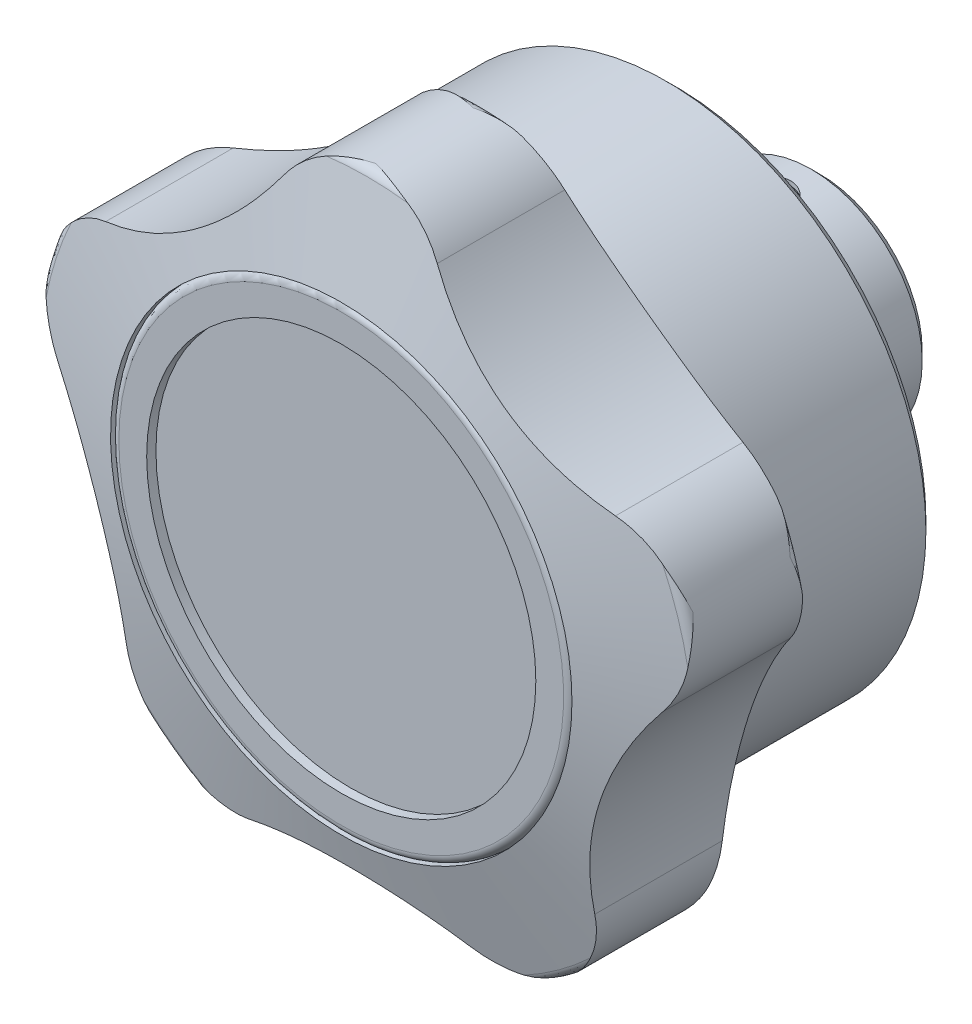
ISO-10303-21;
HEADER;
FILE_DESCRIPTION(('STEP AP214'),'2;1');
FILE_NAME('part.step','',(''),(''),'','','');
FILE_SCHEMA(('AUTOMOTIVE_DESIGN { 1 0 10303 214 1 1 1 1 }'));
ENDSEC;
DATA;
#1=APPLICATION_CONTEXT('core data for automotive mechanical design processes');
#2=APPLICATION_PROTOCOL_DEFINITION('international standard','automotive_design',2000,#1);
#3=PRODUCT_CONTEXT('',#1,'mechanical');
#4=PRODUCT('Part','Part','',(#3));
#5=PRODUCT_RELATED_PRODUCT_CATEGORY('part','',(#4));
#6=PRODUCT_DEFINITION_FORMATION('','',#4);
#7=PRODUCT_DEFINITION_CONTEXT('part definition',#1,'design');
#8=PRODUCT_DEFINITION('design','',#6,#7);
#9=PRODUCT_DEFINITION_SHAPE('','',#8);
#10=(LENGTH_UNIT() NAMED_UNIT(*) SI_UNIT(.MILLI.,.METRE.));
#11=(NAMED_UNIT(*) PLANE_ANGLE_UNIT() SI_UNIT($,.RADIAN.));
#12=(NAMED_UNIT(*) SI_UNIT($,.STERADIAN.) SOLID_ANGLE_UNIT());
#13=UNCERTAINTY_MEASURE_WITH_UNIT(LENGTH_MEASURE(1.E-05),#10,'distance_accuracy_value','');
#14=(GEOMETRIC_REPRESENTATION_CONTEXT(3) GLOBAL_UNCERTAINTY_ASSIGNED_CONTEXT((#13)) GLOBAL_UNIT_ASSIGNED_CONTEXT((#10,
#11,#12)) REPRESENTATION_CONTEXT('',''));
#15=CARTESIAN_POINT('',(0.,0.,0.));
#16=DIRECTION('',(0.,0.,1.));
#17=DIRECTION('',(1.,0.,0.));
#18=AXIS2_PLACEMENT_3D('',#15,#16,#17);
#19=CARTESIAN_POINT('',(0.,0.,51.));
#20=DIRECTION('',(0.,0.,1.));
#21=DIRECTION('',(1.,0.,0.));
#22=AXIS2_PLACEMENT_3D('',#19,#20,#21);
#23=PLANE('',#22);
#24=CARTESIAN_POINT('',(0.,0.,51.));
#25=DIRECTION('',(0.,0.,1.));
#26=DIRECTION('',(1.,0.,0.));
#27=AXIS2_PLACEMENT_3D('',#24,#25,#26);
#28=CIRCLE('',#27,21.);
#29=CARTESIAN_POINT('',(21.,0.,51.));
#30=VERTEX_POINT('',#29);
#31=EDGE_CURVE('E932',#30,#30,#28,.T.);
#32=ORIENTED_EDGE('',*,*,#31,.T.);
#33=EDGE_LOOP('',(#32));
#34=FACE_BOUND('',#33,.T.);
#35=ADVANCED_FACE('F14',(#34),#23,.T.);
#36=CARTESIAN_POINT('',(0.,0.,51.));
#37=DIRECTION('',(0.,0.,1.));
#38=DIRECTION('',(1.,0.,0.));
#39=AXIS2_PLACEMENT_3D('',#36,#37,#38);
#40=CYLINDRICAL_SURFACE('',#39,21.);
#41=ORIENTED_EDGE('',*,*,#31,.F.);
#42=EDGE_LOOP('',(#41));
#43=FACE_BOUND('',#42,.T.);
#44=CARTESIAN_POINT('',(0.,0.,52.));
#45=DIRECTION('',(0.,0.,1.));
#46=DIRECTION('',(1.,0.,0.));
#47=AXIS2_PLACEMENT_3D('',#44,#45,#46);
#48=CIRCLE('',#47,21.);
#49=CARTESIAN_POINT('',(21.,0.,52.));
#50=VERTEX_POINT('',#49);
#51=EDGE_CURVE('E930',#50,#50,#48,.T.);
#52=ORIENTED_EDGE('',*,*,#51,.T.);
#53=EDGE_LOOP('',(#52));
#54=FACE_BOUND('',#53,.T.);
#55=ADVANCED_FACE('F949',(#43,#54),#40,.F.);
#56=CARTESIAN_POINT('',(0.,-24.1,52.));
#57=DIRECTION('',(0.,0.,-1.));
#58=DIRECTION('',(-1.,0.,0.));
#59=AXIS2_PLACEMENT_3D('',#56,#57,#58);
#60=PLANE('',#59);
#61=CARTESIAN_POINT('',(0.,0.,52.));
#62=DIRECTION('',(0.,0.,-1.));
#63=DIRECTION('',(-1.,0.,0.));
#64=AXIS2_PLACEMENT_3D('',#61,#62,#63);
#65=CIRCLE('',#64,24.);
#66=CARTESIAN_POINT('',(-24.,0.,52.));
#67=VERTEX_POINT('',#66);
#68=EDGE_CURVE('E9',#67,#67,#65,.F.);
#69=ORIENTED_EDGE('',*,*,#68,.T.);
#70=EDGE_LOOP('',(#69));
#71=FACE_BOUND('',#70,.T.);
#72=ORIENTED_EDGE('',*,*,#51,.F.);
#73=EDGE_LOOP('',(#72));
#74=FACE_BOUND('',#73,.T.);
#75=ADVANCED_FACE('F944',(#71,#74),#60,.F.);
#76=CARTESIAN_POINT('',(0.,0.,51.1));
#77=DIRECTION('',(0.,0.,-1.));
#78=DIRECTION('',(-1.,0.,0.));
#79=AXIS2_PLACEMENT_3D('',#76,#77,#78);
#80=TOROIDAL_SURFACE('',#79,24.,0.9);
#81=ORIENTED_EDGE('',*,*,#68,.F.);
#82=EDGE_LOOP('',(#81));
#83=FACE_BOUND('',#82,.T.);
#84=CARTESIAN_POINT('',(0.,0.,51.1));
#85=DIRECTION('',(0.,0.,-1.));
#86=DIRECTION('',(-1.,0.,0.));
#87=AXIS2_PLACEMENT_3D('',#84,#85,#86);
#88=CIRCLE('',#87,24.9);
#89=CARTESIAN_POINT('',(-24.9,0.,51.1));
#90=VERTEX_POINT('',#89);
#91=EDGE_CURVE('E23',#90,#90,#88,.T.);
#92=ORIENTED_EDGE('',*,*,#91,.F.);
#93=EDGE_LOOP('',(#92));
#94=FACE_BOUND('',#93,.T.);
#95=ADVANCED_FACE('F907',(#83,#94),#80,.T.);
#96=CARTESIAN_POINT('',(0.,5.,8.0095));
#97=DIRECTION('',(0.,1.,0.));
#98=DIRECTION('',(-1.,0.,0.));
#99=AXIS2_PLACEMENT_3D('',#96,#97,#98);
#100=PLANE('',#99);
#101=CARTESIAN_POINT('',(0.,5.,6.));
#102=DIRECTION('',(0.,-1.,0.));
#103=DIRECTION('',(1.,0.,0.));
#104=AXIS2_PLACEMENT_3D('',#101,#102,#103);
#105=CIRCLE('',#104,2.0095);
#106=CARTESIAN_POINT('',(2.0095,5.,6.));
#107=VERTEX_POINT('',#106);
#108=EDGE_CURVE('E230',#107,#107,#105,.T.);
#109=ORIENTED_EDGE('',*,*,#108,.T.);
#110=EDGE_LOOP('',(#109));
#111=FACE_BOUND('',#110,.T.);
#112=ADVANCED_FACE('F861',(#111),#100,.F.);
#113=CARTESIAN_POINT('',(0.,5.4905,6.));
#114=DIRECTION('',(0.,1.,0.));
#115=DIRECTION('',(-1.,0.,0.));
#116=AXIS2_PLACEMENT_3D('',#113,#114,#115);
#117=CONICAL_SURFACE('',#116,2.5,0.785398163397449);
#118=ORIENTED_EDGE('',*,*,#108,.F.);
#119=EDGE_LOOP('',(#118));
#120=FACE_BOUND('',#119,.T.);
#121=CARTESIAN_POINT('',(0.,5.4905,6.));
#122=DIRECTION('',(0.,-1.,0.));
#123=DIRECTION('',(1.,0.,0.));
#124=AXIS2_PLACEMENT_3D('',#121,#122,#123);
#125=CIRCLE('',#124,2.5);
#126=CARTESIAN_POINT('',(2.5,5.4905,6.));
#127=VERTEX_POINT('',#126);
#128=EDGE_CURVE('E279',#127,#127,#125,.T.);
#129=ORIENTED_EDGE('',*,*,#128,.T.);
#130=EDGE_LOOP('',(#129));
#131=FACE_BOUND('',#130,.T.);
#132=ADVANCED_FACE('F864',(#120,#131),#117,.T.);
#133=CARTESIAN_POINT('',(0.,0.,17.));
#134=DIRECTION('',(0.,0.,1.));
#135=DIRECTION('',(1.,0.,0.));
#136=AXIS2_PLACEMENT_3D('',#133,#134,#135);
#137=PLANE('',#136);
#138=CARTESIAN_POINT('',(0.,0.,17.));
#139=DIRECTION('',(0.,0.,1.));
#140=DIRECTION('',(1.,0.,0.));
#141=AXIS2_PLACEMENT_3D('',#138,#139,#140);
#142=CIRCLE('',#141,5.);
#143=CARTESIAN_POINT('',(5.,0.,17.));
#144=VERTEX_POINT('',#143);
#145=EDGE_CURVE('E251',#144,#144,#142,.T.);
#146=ORIENTED_EDGE('',*,*,#145,.F.);
#147=EDGE_LOOP('',(#146));
#148=FACE_BOUND('',#147,.T.);
#149=ADVANCED_FACE('F862',(#148),#137,.F.);
#150=CARTESIAN_POINT('',(0.,4.,6.));
#151=DIRECTION('',(0.,-1.,0.));
#152=DIRECTION('',(1.,0.,0.));
#153=AXIS2_PLACEMENT_3D('',#150,#151,#152);
#154=CYLINDRICAL_SURFACE('',#153,2.5);
#155=CARTESIAN_POINT('',(2.5,4.3301270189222,6.));
#156=CARTESIAN_POINT('',(2.49998948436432,4.33013982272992,5.86973349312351));
#157=CARTESIAN_POINT('',(2.48974954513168,4.33609541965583,5.73929727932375));
#158=CARTESIAN_POINT('',(2.44930840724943,4.35905877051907,5.48243102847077));
#159=CARTESIAN_POINT('',(2.41906526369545,4.37608974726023,5.35600999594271));
#160=CARTESIAN_POINT('',(2.3402497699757,4.41873376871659,5.11137105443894));
#161=CARTESIAN_POINT('',(2.29177485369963,4.44430111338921,4.99311342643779));
#162=CARTESIAN_POINT('',(2.17816884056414,4.50106659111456,4.76643943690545));
#163=CARTESIAN_POINT('',(2.11303684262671,4.53226502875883,4.65802360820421));
#164=CARTESIAN_POINT('',(1.96166634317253,4.59992173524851,4.44423569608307));
#165=CARTESIAN_POINT('',(1.87413008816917,4.63660159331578,4.33985216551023));
#166=CARTESIAN_POINT('',(1.68313452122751,4.70929956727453,4.1464790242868));
#167=CARTESIAN_POINT('',(1.57966731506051,4.74531734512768,4.05749709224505));
#168=CARTESIAN_POINT('',(1.35122390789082,4.81553692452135,3.89158212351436));
#169=CARTESIAN_POINT('',(1.22526797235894,4.84945266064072,3.81586558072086));
#170=CARTESIAN_POINT('',(0.960392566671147,4.90876890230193,3.68714786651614));
#171=CARTESIAN_POINT('',(0.821481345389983,4.93417477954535,3.6341323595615));
#172=CARTESIAN_POINT('',(0.545112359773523,4.9720115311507,3.55623834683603));
#173=CARTESIAN_POINT('',(0.408254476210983,4.98523700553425,3.52962618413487));
#174=CARTESIAN_POINT('',(0.131426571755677,5.00018959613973,3.49958470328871));
#175=CARTESIAN_POINT('',(-0.00854151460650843,5.00192366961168,3.49614135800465));
#176=CARTESIAN_POINT('',(-0.274581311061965,4.99407454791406,3.51186668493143));
#177=CARTESIAN_POINT('',(-0.400802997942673,4.98546239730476,3.52909503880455));
#178=CARTESIAN_POINT('',(-0.64828442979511,4.95935613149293,3.58220210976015));
#179=CARTESIAN_POINT('',(-0.769543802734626,4.94186135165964,3.61808222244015));
#180=CARTESIAN_POINT('',(-1.00577347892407,4.89928958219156,3.70770641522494));
#181=CARTESIAN_POINT('',(-1.120633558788,4.87411103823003,3.76169078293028));
#182=CARTESIAN_POINT('',(-1.33994200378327,4.81844114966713,3.88565854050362));
#183=CARTESIAN_POINT('',(-1.4443866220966,4.78794790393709,3.95564765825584));
#184=CARTESIAN_POINT('',(-1.6504341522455,4.72110985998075,4.11723837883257));
#185=CARTESIAN_POINT('',(-1.7508351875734,4.68448439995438,4.21025757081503));
#186=CARTESIAN_POINT('',(-1.93526092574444,4.61135851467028,4.41147431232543));
#187=CARTESIAN_POINT('',(-2.01927302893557,4.57485820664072,4.51968343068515));
#188=CARTESIAN_POINT('',(-2.17376333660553,4.50360390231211,4.75662048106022));
#189=CARTESIAN_POINT('',(-2.24304328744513,4.46910799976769,4.88621505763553));
#190=CARTESIAN_POINT('',(-2.35829778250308,4.4093862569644,5.15734417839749));
#191=CARTESIAN_POINT('',(-2.40429664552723,4.38415075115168,5.29886608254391));
#192=CARTESIAN_POINT('',(-2.4679505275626,4.34861589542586,5.57803627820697));
#193=CARTESIAN_POINT('',(-2.48756280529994,4.33729139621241,5.71510279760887));
#194=CARTESIAN_POINT('',(-2.50379236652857,4.32794798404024,5.99100335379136));
#195=CARTESIAN_POINT('',(-2.50042589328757,4.32991967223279,6.1298360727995));
#196=CARTESIAN_POINT('',(-2.47259010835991,4.34585841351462,6.3891347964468));
#197=CARTESIAN_POINT('',(-2.45046954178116,4.35848968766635,6.50994862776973));
#198=CARTESIAN_POINT('',(-2.38924071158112,4.39235053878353,6.74591946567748));
#199=CARTESIAN_POINT('',(-2.35012694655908,4.41358290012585,6.86107462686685));
#200=CARTESIAN_POINT('',(-2.25411897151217,4.46340555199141,7.08852832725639));
#201=CARTESIAN_POINT('',(-2.19648515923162,4.49229108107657,7.20044754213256));
#202=CARTESIAN_POINT('',(-2.0657176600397,4.55390298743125,7.4136731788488));
#203=CARTESIAN_POINT('',(-1.99257601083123,4.58663133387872,7.51497410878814));
#204=CARTESIAN_POINT('',(-1.82209291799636,4.65719996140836,7.71744691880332));
#205=CARTESIAN_POINT('',(-1.72286318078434,4.69516457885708,7.81699287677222));
#206=CARTESIAN_POINT('',(-1.50851123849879,4.76835587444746,7.99853059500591));
#207=CARTESIAN_POINT('',(-1.39338368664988,4.8035816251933,8.08051642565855));
#208=CARTESIAN_POINT('',(-1.14633840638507,4.86853404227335,8.22643431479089));
#209=CARTESIAN_POINT('',(-1.01405774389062,4.89809104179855,8.28983279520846));
#210=CARTESIAN_POINT('',(-0.738805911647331,4.9470838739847,8.39284475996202));
#211=CARTESIAN_POINT('',(-0.595844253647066,4.96652859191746,8.43247912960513));
#212=CARTESIAN_POINT('',(-0.317449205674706,4.99168770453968,8.48342140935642));
#213=CARTESIAN_POINT('',(-0.182528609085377,4.99849819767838,8.49699468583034));
#214=CARTESIAN_POINT('',(0.0878149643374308,5.00105325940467,8.50210816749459));
#215=CARTESIAN_POINT('',(0.223237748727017,4.99680170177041,8.49365608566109));
#216=CARTESIAN_POINT('',(0.481344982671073,4.97834922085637,8.4564589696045));
#217=CARTESIAN_POINT('',(0.604280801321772,4.96482236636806,8.42908782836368));
#218=CARTESIAN_POINT('',(0.843614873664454,4.92980234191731,8.35668255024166));
#219=CARTESIAN_POINT('',(0.960012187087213,4.90830802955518,8.31164588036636));
#220=CARTESIAN_POINT('',(1.18855854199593,4.85814826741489,8.20318218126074));
#221=CARTESIAN_POINT('',(1.30031295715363,4.82921542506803,8.13905097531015));
#222=CARTESIAN_POINT('',(1.51193650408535,4.76720333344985,7.9951058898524));
#223=CARTESIAN_POINT('',(1.61180014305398,4.73412218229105,7.91528480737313));
#224=CARTESIAN_POINT('',(1.8072854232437,4.66321523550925,7.73300420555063));
#225=CARTESIAN_POINT('',(1.90149582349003,4.62524489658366,7.62908227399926));
#226=CARTESIAN_POINT('',(2.07165660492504,4.55157698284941,7.40638471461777));
#227=CARTESIAN_POINT('',(2.1475908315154,4.51588143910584,7.28759608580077));
#228=CARTESIAN_POINT('',(2.28108393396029,4.44998982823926,7.03336388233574));
#229=CARTESIAN_POINT('',(2.3379862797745,4.42000320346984,6.8975126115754));
#230=CARTESIAN_POINT('',(2.40494911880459,4.38370272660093,6.68677735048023));
#231=CARTESIAN_POINT('',(2.42419582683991,4.37305486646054,6.61544022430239));
#232=CARTESIAN_POINT('',(2.45635087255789,4.35507574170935,6.47095930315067));
#233=CARTESIAN_POINT('',(2.46926364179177,4.34774215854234,6.39781680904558));
#234=CARTESIAN_POINT('',(2.48591166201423,4.3382377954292,6.27049901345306));
#235=CARTESIAN_POINT('',(2.49118864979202,4.33520487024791,6.21658367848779));
#236=CARTESIAN_POINT('',(2.49823512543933,4.33114674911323,6.10845538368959));
#237=CARTESIAN_POINT('',(2.50000437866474,4.33012168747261,6.05424240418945));
#238=CARTESIAN_POINT('',(2.5,4.3301270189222,6.));
#239=B_SPLINE_CURVE_WITH_KNOTS('',3,(#155,#156,#157,#158,#159,#160,#161,#162,#163,#164,#165,
#166,#167,#168,#169,#170,#171,#172,#173,#174,#175,#176,#177,#178,#179,#180,#181,#182,#183,#184,
#185,#186,#187,#188,#189,#190,#191,#192,#193,#194,#195,#196,#197,#198,#199,#200,#201,#202,#203,
#204,#205,#206,#207,#208,#209,#210,#211,#212,#213,#214,#215,#216,#217,#218,#219,#220,#221,#222,
#223,#224,#225,#226,#227,#228,#229,#230,#231,#232,#233,#234,#235,#236,#237,#238),.UNSPECIFIED.,
.T.,.F.,(4,2,2,2,2,2,2,2,2,2,2,2,2,2,2,2,2,2,2,2,2,2,2,2,2,2,2,2,2,2,2,2,2,2,2,2,2,2,2,2,2,4),
(0.,0.390580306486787,0.781982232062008,1.17132148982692,1.56068181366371,1.98215578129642,
2.40383927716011,2.85394730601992,3.30377067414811,3.72158712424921,4.13915059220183,
4.52040243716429,4.90168281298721,5.2882383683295,5.67493248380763,6.0981797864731,
6.52175120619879,6.97222104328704,7.42221935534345,7.83655727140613,8.25060232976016,
8.61935458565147,8.98822631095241,9.37418241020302,9.76033715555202,10.1951685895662,
10.6301466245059,11.076604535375,11.5226694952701,11.927806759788,12.3328021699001,
12.7111106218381,13.0894733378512,13.4840187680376,13.8787457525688,14.3127560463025,
14.7471485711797,15.195268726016,15.4189244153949,15.6424233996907,15.8050484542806,
15.9676843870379),.UNSPECIFIED.);
#240=CARTESIAN_POINT('',(2.5,4.3301270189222,6.));
#241=VERTEX_POINT('',#240);
#242=EDGE_CURVE('E288',#241,#241,#239,.T.);
#243=ORIENTED_EDGE('',*,*,#242,.F.);
#244=EDGE_LOOP('',(#243));
#245=FACE_BOUND('',#244,.T.);
#246=ORIENTED_EDGE('',*,*,#128,.F.);
#247=EDGE_LOOP('',(#246));
#248=FACE_BOUND('',#247,.T.);
#249=ADVANCED_FACE('F309',(#245,#248),#154,.F.);
#250=CARTESIAN_POINT('',(0.,10.,0.));
#251=DIRECTION('',(0.,1.,0.));
#252=DIRECTION('',(-1.,0.,0.));
#253=AXIS2_PLACEMENT_3D('',#250,#251,#252);
#254=PLANE('',#253);
#255=DIRECTION('',(-1.,0.,0.));
#256=VECTOR('',#255,1.);
#257=CARTESIAN_POINT('',(0.577350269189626,10.,5.));
#258=LINE('',#257,#256);
#259=CARTESIAN_POINT('',(0.577350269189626,10.,5.));
#260=VERTEX_POINT('',#259);
#261=CARTESIAN_POINT('',(-0.577350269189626,10.,5.));
#262=VERTEX_POINT('',#261);
#263=EDGE_CURVE('E224',#260,#262,#258,.T.);
#264=ORIENTED_EDGE('',*,*,#263,.T.);
#265=DIRECTION('',(-0.5,0.,0.866025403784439));
#266=VECTOR('',#265,1.);
#267=CARTESIAN_POINT('',(-0.577350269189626,10.,5.));
#268=LINE('',#267,#266);
#269=CARTESIAN_POINT('',(-1.15470053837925,10.,6.));
#270=VERTEX_POINT('',#269);
#271=EDGE_CURVE('E234',#262,#270,#268,.T.);
#272=ORIENTED_EDGE('',*,*,#271,.T.);
#273=DIRECTION('',(0.5,0.,0.866025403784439));
#274=VECTOR('',#273,1.);
#275=CARTESIAN_POINT('',(-1.15470053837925,10.,6.));
#276=LINE('',#275,#274);
#277=CARTESIAN_POINT('',(-0.577350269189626,10.,7.));
#278=VERTEX_POINT('',#277);
#279=EDGE_CURVE('E239',#270,#278,#276,.T.);
#280=ORIENTED_EDGE('',*,*,#279,.T.);
#281=DIRECTION('',(1.,0.,0.));
#282=VECTOR('',#281,1.);
#283=CARTESIAN_POINT('',(-0.577350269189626,10.,7.));
#284=LINE('',#283,#282);
#285=CARTESIAN_POINT('',(0.577350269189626,10.,7.));
#286=VERTEX_POINT('',#285);
#287=EDGE_CURVE('E254',#278,#286,#284,.T.);
#288=ORIENTED_EDGE('',*,*,#287,.T.);
#289=DIRECTION('',(0.5,0.,-0.866025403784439));
#290=VECTOR('',#289,1.);
#291=CARTESIAN_POINT('',(0.577350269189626,10.,7.));
#292=LINE('',#291,#290);
#293=CARTESIAN_POINT('',(1.15470053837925,10.,6.));
#294=VERTEX_POINT('',#293);
#295=EDGE_CURVE('E257',#286,#294,#292,.T.);
#296=ORIENTED_EDGE('',*,*,#295,.T.);
#297=DIRECTION('',(-0.5,0.,-0.866025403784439));
#298=VECTOR('',#297,1.);
#299=CARTESIAN_POINT('',(1.15470053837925,10.,6.));
#300=LINE('',#299,#298);
#301=EDGE_CURVE('E245',#294,#260,#300,.T.);
#302=ORIENTED_EDGE('',*,*,#301,.T.);
#303=EDGE_LOOP('',(#264,#272,#280,#288,#296,#302));
#304=FACE_BOUND('',#303,.T.);
#305=ADVANCED_FACE('F242',(#304),#254,.T.);
#306=CARTESIAN_POINT('',(0.,0.,52.));
#307=DIRECTION('',(0.,0.,1.));
#308=DIRECTION('',(1.,0.,0.));
#309=AXIS2_PLACEMENT_3D('',#306,#307,#308);
#310=CYLINDRICAL_SURFACE('',#309,5.);
#311=CARTESIAN_POINT('',(0.,0.,0.));
#312=DIRECTION('',(0.,0.,1.));
#313=DIRECTION('',(1.,0.,0.));
#314=AXIS2_PLACEMENT_3D('',#311,#312,#313);
#315=CIRCLE('',#314,5.);
#316=CARTESIAN_POINT('',(5.,0.,0.));
#317=VERTEX_POINT('',#316);
#318=EDGE_CURVE('E646',#317,#317,#315,.T.);
#319=ORIENTED_EDGE('',*,*,#318,.F.);
#320=EDGE_LOOP('',(#319));
#321=FACE_BOUND('',#320,.T.);
#322=ORIENTED_EDGE('',*,*,#242,.T.);
#323=EDGE_LOOP('',(#322));
#324=FACE_BOUND('',#323,.T.);
#325=ORIENTED_EDGE('',*,*,#145,.T.);
#326=EDGE_LOOP('',(#325));
#327=FACE_BOUND('',#326,.T.);
#328=ADVANCED_FACE('F298',(#321,#324,#327),#310,.F.);
#329=CARTESIAN_POINT('',(-0.577350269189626,10.,7.));
#330=DIRECTION('',(0.,0.,1.));
#331=DIRECTION('',(1.,0.,0.));
#332=AXIS2_PLACEMENT_3D('',#329,#330,#331);
#333=PLANE('',#332);
#334=DIRECTION('',(0.,1.,0.));
#335=VECTOR('',#334,1.);
#336=CARTESIAN_POINT('',(-0.577350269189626,10.,7.));
#337=LINE('',#336,#335);
#338=CARTESIAN_POINT('',(-0.577350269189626,12.,7.));
#339=VERTEX_POINT('',#338);
#340=EDGE_CURVE('E273',#278,#339,#337,.T.);
#341=ORIENTED_EDGE('',*,*,#340,.T.);
#342=DIRECTION('',(-1.,0.,0.));
#343=VECTOR('',#342,1.);
#344=CARTESIAN_POINT('',(0.,12.,7.));
#345=LINE('',#344,#343);
#346=CARTESIAN_POINT('',(0.577350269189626,12.,7.));
#347=VERTEX_POINT('',#346);
#348=EDGE_CURVE('E18',#347,#339,#345,.T.);
#349=ORIENTED_EDGE('',*,*,#348,.F.);
#350=DIRECTION('',(0.,1.,0.));
#351=VECTOR('',#350,1.);
#352=CARTESIAN_POINT('',(0.577350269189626,10.,7.));
#353=LINE('',#352,#351);
#354=EDGE_CURVE('E271',#286,#347,#353,.T.);
#355=ORIENTED_EDGE('',*,*,#354,.F.);
#356=ORIENTED_EDGE('',*,*,#287,.F.);
#357=EDGE_LOOP('',(#341,#349,#355,#356));
#358=FACE_BOUND('',#357,.T.);
#359=ADVANCED_FACE('F882',(#358),#333,.F.);
#360=CARTESIAN_POINT('',(0.577350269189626,10.,7.));
#361=DIRECTION('',(0.866025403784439,0.,0.5));
#362=DIRECTION('',(0.5,0.,-0.866025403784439));
#363=AXIS2_PLACEMENT_3D('',#360,#361,#362);
#364=PLANE('',#363);
#365=DIRECTION('',(0.5,0.,-0.866025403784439));
#366=VECTOR('',#365,1.);
#367=CARTESIAN_POINT('',(0.577350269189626,12.,7.));
#368=LINE('',#367,#366);
#369=CARTESIAN_POINT('',(1.15470053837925,12.,6.));
#370=VERTEX_POINT('',#369);
#371=EDGE_CURVE('E31',#347,#370,#368,.T.);
#372=ORIENTED_EDGE('',*,*,#371,.T.);
#373=DIRECTION('',(0.,1.,0.));
#374=VECTOR('',#373,1.);
#375=CARTESIAN_POINT('',(1.15470053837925,10.,6.));
#376=LINE('',#375,#374);
#377=EDGE_CURVE('E269',#294,#370,#376,.T.);
#378=ORIENTED_EDGE('',*,*,#377,.F.);
#379=ORIENTED_EDGE('',*,*,#295,.F.);
#380=ORIENTED_EDGE('',*,*,#354,.T.);
#381=EDGE_LOOP('',(#372,#378,#379,#380));
#382=FACE_BOUND('',#381,.T.);
#383=ADVANCED_FACE('F887',(#382),#364,.F.);
#384=CARTESIAN_POINT('',(1.15470053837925,10.,6.));
#385=DIRECTION('',(0.866025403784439,0.,-0.5));
#386=DIRECTION('',(-0.5,0.,-0.866025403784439));
#387=AXIS2_PLACEMENT_3D('',#384,#385,#386);
#388=PLANE('',#387);
#389=DIRECTION('',(-0.5,0.,-0.866025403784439));
#390=VECTOR('',#389,1.);
#391=CARTESIAN_POINT('',(1.15470053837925,12.,6.));
#392=LINE('',#391,#390);
#393=CARTESIAN_POINT('',(0.577350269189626,12.,5.));
#394=VERTEX_POINT('',#393);
#395=EDGE_CURVE('E246',#370,#394,#392,.T.);
#396=ORIENTED_EDGE('',*,*,#395,.T.);
#397=DIRECTION('',(0.,1.,0.));
#398=VECTOR('',#397,1.);
#399=CARTESIAN_POINT('',(0.577350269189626,10.,5.));
#400=LINE('',#399,#398);
#401=EDGE_CURVE('E260',#260,#394,#400,.T.);
#402=ORIENTED_EDGE('',*,*,#401,.F.);
#403=ORIENTED_EDGE('',*,*,#301,.F.);
#404=ORIENTED_EDGE('',*,*,#377,.T.);
#405=EDGE_LOOP('',(#396,#402,#403,#404));
#406=FACE_BOUND('',#405,.T.);
#407=ADVANCED_FACE('F878',(#406),#388,.F.);
#408=CARTESIAN_POINT('',(0.577350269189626,10.,5.));
#409=DIRECTION('',(0.,0.,-1.));
#410=DIRECTION('',(-1.,0.,0.));
#411=AXIS2_PLACEMENT_3D('',#408,#409,#410);
#412=PLANE('',#411);
#413=DIRECTION('',(-1.,0.,0.));
#414=VECTOR('',#413,1.);
#415=CARTESIAN_POINT('',(0.577350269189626,12.,5.));
#416=LINE('',#415,#414);
#417=CARTESIAN_POINT('',(-0.577350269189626,12.,5.));
#418=VERTEX_POINT('',#417);
#419=EDGE_CURVE('E226',#394,#418,#416,.T.);
#420=ORIENTED_EDGE('',*,*,#419,.T.);
#421=DIRECTION('',(0.,1.,0.));
#422=VECTOR('',#421,1.);
#423=CARTESIAN_POINT('',(-0.577350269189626,10.,5.));
#424=LINE('',#423,#422);
#425=EDGE_CURVE('E220',#262,#418,#424,.T.);
#426=ORIENTED_EDGE('',*,*,#425,.F.);
#427=ORIENTED_EDGE('',*,*,#263,.F.);
#428=ORIENTED_EDGE('',*,*,#401,.T.);
#429=EDGE_LOOP('',(#420,#426,#427,#428));
#430=FACE_BOUND('',#429,.T.);
#431=ADVANCED_FACE('F222',(#430),#412,.F.);
#432=CARTESIAN_POINT('',(-0.577350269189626,10.,5.));
#433=DIRECTION('',(-0.866025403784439,0.,-0.5));
#434=DIRECTION('',(-0.5,0.,0.866025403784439));
#435=AXIS2_PLACEMENT_3D('',#432,#433,#434);
#436=PLANE('',#435);
#437=DIRECTION('',(-0.5,0.,0.866025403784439));
#438=VECTOR('',#437,1.);
#439=CARTESIAN_POINT('',(-0.577350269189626,12.,5.));
#440=LINE('',#439,#438);
#441=CARTESIAN_POINT('',(-1.15470053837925,12.,6.));
#442=VERTEX_POINT('',#441);
#443=EDGE_CURVE('E262',#418,#442,#440,.T.);
#444=ORIENTED_EDGE('',*,*,#443,.T.);
#445=DIRECTION('',(0.,1.,0.));
#446=VECTOR('',#445,1.);
#447=CARTESIAN_POINT('',(-1.15470053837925,10.,6.));
#448=LINE('',#447,#446);
#449=EDGE_CURVE('E231',#270,#442,#448,.T.);
#450=ORIENTED_EDGE('',*,*,#449,.F.);
#451=ORIENTED_EDGE('',*,*,#271,.F.);
#452=ORIENTED_EDGE('',*,*,#425,.T.);
#453=EDGE_LOOP('',(#444,#450,#451,#452));
#454=FACE_BOUND('',#453,.T.);
#455=ADVANCED_FACE('F235',(#454),#436,.F.);
#456=CARTESIAN_POINT('',(-1.15470053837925,10.,6.));
#457=DIRECTION('',(-0.866025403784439,0.,0.5));
#458=DIRECTION('',(0.5,0.,0.866025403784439));
#459=AXIS2_PLACEMENT_3D('',#456,#457,#458);
#460=PLANE('',#459);
#461=DIRECTION('',(0.5,0.,0.866025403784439));
#462=VECTOR('',#461,1.);
#463=CARTESIAN_POINT('',(-1.15470053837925,12.,6.));
#464=LINE('',#463,#462);
#465=EDGE_CURVE('E264',#442,#339,#464,.T.);
#466=ORIENTED_EDGE('',*,*,#465,.T.);
#467=ORIENTED_EDGE('',*,*,#340,.F.);
#468=ORIENTED_EDGE('',*,*,#279,.F.);
#469=ORIENTED_EDGE('',*,*,#449,.T.);
#470=EDGE_LOOP('',(#466,#467,#468,#469));
#471=FACE_BOUND('',#470,.T.);
#472=ADVANCED_FACE('F900',(#471),#460,.F.);
#473=CARTESIAN_POINT('',(0.,9.,0.));
#474=DIRECTION('',(0.,0.,-1.));
#475=DIRECTION('',(-1.,0.,0.));
#476=AXIS2_PLACEMENT_3D('',#473,#474,#475);
#477=PLANE('',#476);
#478=ORIENTED_EDGE('',*,*,#318,.T.);
#479=EDGE_LOOP('',(#478));
#480=FACE_BOUND('',#479,.T.);
#481=CARTESIAN_POINT('',(0.,0.,0.));
#482=DIRECTION('',(0.,0.,1.));
#483=DIRECTION('',(1.,0.,0.));
#484=AXIS2_PLACEMENT_3D('',#481,#482,#483);
#485=CIRCLE('',#484,9.);
#486=CARTESIAN_POINT('',(9.,0.,0.));
#487=VERTEX_POINT('',#486);
#488=EDGE_CURVE('E607',#487,#487,#485,.T.);
#489=ORIENTED_EDGE('',*,*,#488,.F.);
#490=EDGE_LOOP('',(#489));
#491=FACE_BOUND('',#490,.T.);
#492=ADVANCED_FACE('F16',(#480,#491),#477,.T.);
#493=CARTESIAN_POINT('',(0.,12.,6.));
#494=DIRECTION('',(0.,-1.,0.));
#495=DIRECTION('',(1.,0.,0.));
#496=AXIS2_PLACEMENT_3D('',#493,#494,#495);
#497=PLANE('',#496);
#498=CARTESIAN_POINT('',(0.,12.,6.));
#499=DIRECTION('',(0.,-1.,0.));
#500=DIRECTION('',(1.,0.,0.));
#501=AXIS2_PLACEMENT_3D('',#498,#499,#500);
#502=CIRCLE('',#501,2.0095);
#503=CARTESIAN_POINT('',(2.0095,12.,6.));
#504=VERTEX_POINT('',#503);
#505=EDGE_CURVE('E285',#504,#504,#502,.T.);
#506=ORIENTED_EDGE('',*,*,#505,.F.);
#507=EDGE_LOOP('',(#506));
#508=FACE_BOUND('',#507,.T.);
#509=ORIENTED_EDGE('',*,*,#465,.F.);
#510=ORIENTED_EDGE('',*,*,#443,.F.);
#511=ORIENTED_EDGE('',*,*,#419,.F.);
#512=ORIENTED_EDGE('',*,*,#395,.F.);
#513=ORIENTED_EDGE('',*,*,#371,.F.);
#514=ORIENTED_EDGE('',*,*,#348,.T.);
#515=EDGE_LOOP('',(#509,#510,#511,#512,#513,#514));
#516=FACE_BOUND('',#515,.T.);
#517=ADVANCED_FACE('F310',(#508,#516),#497,.F.);
#518=CARTESIAN_POINT('',(0.,0.,52.));
#519=DIRECTION('',(0.,0.,1.));
#520=DIRECTION('',(1.,0.,0.));
#521=AXIS2_PLACEMENT_3D('',#518,#519,#520);
#522=CYLINDRICAL_SURFACE('',#521,9.);
#523=ORIENTED_EDGE('',*,*,#488,.T.);
#524=EDGE_LOOP('',(#523));
#525=FACE_BOUND('',#524,.T.);
#526=CARTESIAN_POINT('',(0.,0.,0.3));
#527=DIRECTION('',(0.,0.,1.));
#528=DIRECTION('',(1.,0.,0.));
#529=AXIS2_PLACEMENT_3D('',#526,#527,#528);
#530=CIRCLE('',#529,9.);
#531=CARTESIAN_POINT('',(9.,0.,0.3));
#532=VERTEX_POINT('',#531);
#533=EDGE_CURVE('E610',#532,#532,#530,.T.);
#534=ORIENTED_EDGE('',*,*,#533,.F.);
#535=EDGE_LOOP('',(#534));
#536=FACE_BOUND('',#535,.T.);
#537=ADVANCED_FACE('F586',(#525,#536),#522,.T.);
#538=CARTESIAN_POINT('',(0.,12.,6.));
#539=DIRECTION('',(0.,-1.,0.));
#540=DIRECTION('',(1.,0.,0.));
#541=AXIS2_PLACEMENT_3D('',#538,#539,#540);
#542=CONICAL_SURFACE('',#541,2.0095,0.785398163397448);
#543=CARTESIAN_POINT('',(0.,11.5095,6.));
#544=DIRECTION('',(0.,-1.,0.));
#545=DIRECTION('',(1.,0.,0.));
#546=AXIS2_PLACEMENT_3D('',#543,#544,#545);
#547=CIRCLE('',#546,2.5);
#548=CARTESIAN_POINT('',(2.5,11.5095,6.));
#549=VERTEX_POINT('',#548);
#550=EDGE_CURVE('E282',#549,#549,#547,.T.);
#551=ORIENTED_EDGE('',*,*,#550,.F.);
#552=EDGE_LOOP('',(#551));
#553=FACE_BOUND('',#552,.T.);
#554=ORIENTED_EDGE('',*,*,#505,.T.);
#555=EDGE_LOOP('',(#554));
#556=FACE_BOUND('',#555,.T.);
#557=ADVANCED_FACE('F894',(#553,#556),#542,.T.);
#558=CARTESIAN_POINT('',(0.,11.,0.3));
#559=DIRECTION('',(0.,0.,-1.));
#560=DIRECTION('',(-1.,0.,0.));
#561=AXIS2_PLACEMENT_3D('',#558,#559,#560);
#562=PLANE('',#561);
#563=ORIENTED_EDGE('',*,*,#533,.T.);
#564=EDGE_LOOP('',(#563));
#565=FACE_BOUND('',#564,.T.);
#566=CARTESIAN_POINT('',(0.,0.,0.3));
#567=DIRECTION('',(0.,0.,1.));
#568=DIRECTION('',(1.,0.,0.));
#569=AXIS2_PLACEMENT_3D('',#566,#567,#568);
#570=CIRCLE('',#569,11.);
#571=CARTESIAN_POINT('',(11.,0.,0.3));
#572=VERTEX_POINT('',#571);
#573=EDGE_CURVE('E613',#572,#572,#570,.T.);
#574=ORIENTED_EDGE('',*,*,#573,.F.);
#575=EDGE_LOOP('',(#574));
#576=FACE_BOUND('',#575,.T.);
#577=ADVANCED_FACE('F307',(#565,#576),#562,.T.);
#578=ORIENTED_EDGE('',*,*,#550,.T.);
#579=EDGE_LOOP('',(#578));
#580=FACE_BOUND('',#579,.T.);
#581=CARTESIAN_POINT('',(0.,12.,8.5));
#582=CARTESIAN_POINT('',(-0.138818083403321,11.999997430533,8.49999504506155));
#583=CARTESIAN_POINT('',(-0.277697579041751,11.9975665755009,8.4883986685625));
#584=CARTESIAN_POINT('',(-0.551522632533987,11.9881040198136,8.4423613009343));
#585=CARTESIAN_POINT('',(-0.686465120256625,11.9810688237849,8.40790295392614));
#586=CARTESIAN_POINT('',(-0.948418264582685,11.963182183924,8.31725909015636));
#587=CARTESIAN_POINT('',(-1.07543667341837,11.9523345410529,8.26109520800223));
#588=CARTESIAN_POINT('',(-1.31824065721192,11.9279985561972,8.12870078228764));
#589=CARTESIAN_POINT('',(-1.43402673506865,11.9145103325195,8.05247113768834));
#590=CARTESIAN_POINT('',(-1.65278064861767,11.886154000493,7.88092731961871));
#591=CARTESIAN_POINT('',(-1.75556048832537,11.8712701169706,7.78537599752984));
#592=CARTESIAN_POINT('',(-1.94375555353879,11.841913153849,7.57841068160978));
#593=CARTESIAN_POINT('',(-2.02916934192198,11.8274401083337,7.46699537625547));
#594=CARTESIAN_POINT('',(-2.18102063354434,11.8003888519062,7.23009606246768));
#595=CARTESIAN_POINT('',(-2.24726109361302,11.7878309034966,7.10448323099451));
#596=CARTESIAN_POINT('',(-2.35762238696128,11.7662568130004,6.84360509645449));
#597=CARTESIAN_POINT('',(-2.40174560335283,11.7572402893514,6.70834083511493));
#598=CARTESIAN_POINT('',(-2.46600480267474,11.7439300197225,6.43402952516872));
#599=CARTESIAN_POINT('',(-2.48647195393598,11.7395711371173,6.29506328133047));
#600=CARTESIAN_POINT('',(-2.50386715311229,11.7358738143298,6.01560631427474));
#601=CARTESIAN_POINT('',(-2.50079781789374,11.7365348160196,5.87511576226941));
#602=CARTESIAN_POINT('',(-2.47147438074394,11.7427434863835,5.59903794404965));
#603=CARTESIAN_POINT('',(-2.44560210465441,11.748210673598,5.46340804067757));
#604=CARTESIAN_POINT('',(-2.37201087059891,11.7632887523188,5.19845698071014));
#605=CARTESIAN_POINT('',(-2.32429078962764,11.7728998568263,5.06913614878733));
#606=CARTESIAN_POINT('',(-2.20800006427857,11.795263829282,4.81938554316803));
#607=CARTESIAN_POINT('',(-2.13928005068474,11.8080390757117,4.69902740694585));
#608=CARTESIAN_POINT('',(-1.98304539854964,11.8352778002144,4.47140851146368));
#609=CARTESIAN_POINT('',(-1.89552842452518,11.8497414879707,4.36414938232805));
#610=CARTESIAN_POINT('',(-1.70214984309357,11.8790746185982,4.16357207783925));
#611=CARTESIAN_POINT('',(-1.59596286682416,11.8939464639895,4.07056766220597));
#612=CARTESIAN_POINT('',(-1.3693345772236,11.92216176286,3.90363911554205));
#613=CARTESIAN_POINT('',(-1.24889305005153,11.9355051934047,3.8297152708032));
#614=CARTESIAN_POINT('',(-0.996811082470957,11.9591974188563,3.70297983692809));
#615=CARTESIAN_POINT('',(-0.865150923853,11.9695407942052,3.65020639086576));
#616=CARTESIAN_POINT('',(-0.59456924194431,11.9860267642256,3.56761659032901));
#617=CARTESIAN_POINT('',(-0.455648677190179,11.9921699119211,3.5377972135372));
#618=CARTESIAN_POINT('',(-0.177183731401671,11.9994855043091,3.50241149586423));
#619=CARTESIAN_POINT('',(-0.0376961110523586,12.0007458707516,3.4964161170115));
#620=CARTESIAN_POINT('',(0.240287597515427,11.9983990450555,3.5076898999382));
#621=CARTESIAN_POINT('',(0.378783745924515,11.9947921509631,3.52495763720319));
#622=CARTESIAN_POINT('',(0.649452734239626,11.9831712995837,3.58191130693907));
#623=CARTESIAN_POINT('',(0.781674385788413,11.9752010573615,3.62137497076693));
#624=CARTESIAN_POINT('',(1.03762289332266,11.9557445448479,3.72135572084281));
#625=CARTESIAN_POINT('',(1.16134907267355,11.9442579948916,3.78187448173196));
#626=CARTESIAN_POINT('',(1.39858861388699,11.9188248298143,3.92316075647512));
#627=CARTESIAN_POINT('',(1.51194643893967,11.9048478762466,4.00418385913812));
#628=CARTESIAN_POINT('',(1.72361089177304,11.8760513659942,4.18383912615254));
#629=CARTESIAN_POINT('',(1.82191575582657,11.8612317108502,4.28247335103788));
#630=CARTESIAN_POINT('',(2.0023572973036,11.8321204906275,4.4965111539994));
#631=CARTESIAN_POINT('',(2.08419829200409,11.81784178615,4.61216606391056));
#632=CARTESIAN_POINT('',(2.22729438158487,11.7917120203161,4.85583256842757));
#633=CARTESIAN_POINT('',(2.28855033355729,11.779860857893,4.98384364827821));
#634=CARTESIAN_POINT('',(2.38834492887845,11.7600340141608,5.24792239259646));
#635=CARTESIAN_POINT('',(2.42700619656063,11.7520374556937,5.38394207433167));
#636=CARTESIAN_POINT('',(2.48088077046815,11.7407836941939,5.66073310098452));
#637=CARTESIAN_POINT('',(2.49609743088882,11.7375258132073,5.80150376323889));
#638=CARTESIAN_POINT('',(2.50251852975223,11.7361581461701,6.0808268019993));
#639=CARTESIAN_POINT('',(2.49419085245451,11.73794804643,6.21936814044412));
#640=CARTESIAN_POINT('',(2.45479810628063,11.7462489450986,6.49302801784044));
#641=CARTESIAN_POINT('',(2.42373325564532,11.7527598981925,6.62814658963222));
#642=CARTESIAN_POINT('',(2.3399643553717,11.7697226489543,6.89079554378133));
#643=CARTESIAN_POINT('',(2.28732235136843,11.7801631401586,7.01834649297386));
#644=CARTESIAN_POINT('',(2.16194914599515,11.8038141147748,7.26287755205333));
#645=CARTESIAN_POINT('',(2.0892160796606,11.8170248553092,7.37985667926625));
#646=CARTESIAN_POINT('',(1.92414739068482,11.8450315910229,7.60224325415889));
#647=CARTESIAN_POINT('',(1.83147578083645,11.8598522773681,7.70739824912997));
#648=CARTESIAN_POINT('',(1.62984887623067,11.8892367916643,7.90081898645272));
#649=CARTESIAN_POINT('',(1.52088983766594,11.9038005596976,7.98908083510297));
#650=CARTESIAN_POINT('',(1.28826885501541,11.9312288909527,8.14717714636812));
#651=CARTESIAN_POINT('',(1.1644518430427,11.9440719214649,8.21678735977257));
#652=CARTESIAN_POINT('',(0.906639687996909,11.9663981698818,8.33410045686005));
#653=CARTESIAN_POINT('',(0.772653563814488,11.975884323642,8.38182249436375));
#654=CARTESIAN_POINT('',(0.532030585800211,11.9886499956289,8.44508055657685));
#655=CARTESIAN_POINT('',(0.426735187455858,11.9928807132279,8.46563752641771));
#656=CARTESIAN_POINT('',(0.214305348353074,11.9985566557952,8.49309890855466));
#657=CARTESIAN_POINT('',(0.107170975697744,12.0000019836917,8.50000382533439));
#658=CARTESIAN_POINT('',(0.,12.,8.5));
#659=B_SPLINE_CURVE_WITH_KNOTS('',3,(#581,#582,#583,#584,#585,#586,#587,#588,#589,#590,#591,
#592,#593,#594,#595,#596,#597,#598,#599,#600,#601,#602,#603,#604,#605,#606,#607,#608,#609,#610,
#611,#612,#613,#614,#615,#616,#617,#618,#619,#620,#621,#622,#623,#624,#625,#626,#627,#628,#629,
#630,#631,#632,#633,#634,#635,#636,#637,#638,#639,#640,#641,#642,#643,#644,#645,#646,#647,#648,
#649,#650,#651,#652,#653,#654,#655,#656,#657,#658),.UNSPECIFIED.,.T.,.F.,(4,2,2,2,2,2,2,2,2,2,2,
2,2,2,2,2,2,2,2,2,2,2,2,2,2,2,2,2,2,2,2,2,2,2,2,2,2,2,4),(0.,0.416062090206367,
0.832440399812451,1.24840475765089,1.66435048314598,2.08575052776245,2.50718543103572,
2.93280898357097,3.35838666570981,3.77793150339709,4.19742969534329,4.61003424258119,
5.0226600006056,5.43829184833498,5.85397536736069,6.27779052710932,6.70161204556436,
7.12619448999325,7.55072102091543,7.96756678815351,8.38438703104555,8.79710573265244,
9.20985726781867,9.62803167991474,10.0462550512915,10.4714252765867,10.8965777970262,
11.3194010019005,11.7421637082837,12.1565844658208,12.5710012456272,12.9842346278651,
13.3975063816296,13.8183804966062,14.2393515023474,14.6651772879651,15.0906297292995,
15.4118517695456,15.7330619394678),.UNSPECIFIED.);
#660=CARTESIAN_POINT('',(0.,12.,8.5));
#661=VERTEX_POINT('',#660);
#662=EDGE_CURVE('E316',#661,#661,#659,.T.);
#663=ORIENTED_EDGE('',*,*,#662,.F.);
#664=EDGE_LOOP('',(#663));
#665=FACE_BOUND('',#664,.T.);
#666=ADVANCED_FACE('F301',(#580,#665),#154,.F.);
#667=CARTESIAN_POINT('',(0.,0.,1.3));
#668=DIRECTION('',(0.,0.,1.));
#669=DIRECTION('',(1.,0.,0.));
#670=AXIS2_PLACEMENT_3D('',#667,#668,#669);
#671=CONICAL_SURFACE('',#670,12.,0.785398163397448);
#672=ORIENTED_EDGE('',*,*,#573,.T.);
#673=EDGE_LOOP('',(#672));
#674=FACE_BOUND('',#673,.T.);
#675=CARTESIAN_POINT('',(0.,0.,1.3));
#676=DIRECTION('',(0.,0.,1.));
#677=DIRECTION('',(1.,0.,0.));
#678=AXIS2_PLACEMENT_3D('',#675,#676,#677);
#679=CIRCLE('',#678,12.);
#680=CARTESIAN_POINT('',(12.,0.,1.3));
#681=VERTEX_POINT('',#680);
#682=EDGE_CURVE('E616',#681,#681,#679,.T.);
#683=ORIENTED_EDGE('',*,*,#682,.F.);
#684=EDGE_LOOP('',(#683));
#685=FACE_BOUND('',#684,.T.);
#686=ADVANCED_FACE('F306',(#674,#685),#671,.T.);
#687=CARTESIAN_POINT('',(0.,0.,52.));
#688=DIRECTION('',(0.,0.,1.));
#689=DIRECTION('',(1.,0.,0.));
#690=AXIS2_PLACEMENT_3D('',#687,#688,#689);
#691=CYLINDRICAL_SURFACE('',#690,12.);
#692=ORIENTED_EDGE('',*,*,#682,.T.);
#693=EDGE_LOOP('',(#692));
#694=FACE_BOUND('',#693,.T.);
#695=ORIENTED_EDGE('',*,*,#662,.T.);
#696=EDGE_LOOP('',(#695));
#697=FACE_BOUND('',#696,.T.);
#698=CARTESIAN_POINT('',(0.,0.,14.9));
#699=DIRECTION('',(0.,0.,1.));
#700=DIRECTION('',(1.,0.,0.));
#701=AXIS2_PLACEMENT_3D('',#698,#699,#700);
#702=CIRCLE('',#701,12.);
#703=CARTESIAN_POINT('',(12.,0.,14.9));
#704=VERTEX_POINT('',#703);
#705=EDGE_CURVE('E619',#704,#704,#702,.T.);
#706=ORIENTED_EDGE('',*,*,#705,.F.);
#707=EDGE_LOOP('',(#706));
#708=FACE_BOUND('',#707,.T.);
#709=ADVANCED_FACE('F331',(#694,#697,#708),#691,.T.);
#710=CARTESIAN_POINT('',(0.,0.,14.9));
#711=DIRECTION('',(0.,0.,1.));
#712=DIRECTION('',(1.,0.,0.));
#713=AXIS2_PLACEMENT_3D('',#710,#711,#712);
#714=TOROIDAL_SURFACE('',#713,13.,1.);
#715=CARTESIAN_POINT('',(0.,0.,15.9));
#716=DIRECTION('',(0.,0.,1.));
#717=DIRECTION('',(1.,0.,0.));
#718=AXIS2_PLACEMENT_3D('',#715,#716,#717);
#719=CIRCLE('',#718,13.);
#720=CARTESIAN_POINT('',(13.,0.,15.9));
#721=VERTEX_POINT('',#720);
#722=EDGE_CURVE('E622',#721,#721,#719,.T.);
#723=ORIENTED_EDGE('',*,*,#722,.F.);
#724=EDGE_LOOP('',(#723));
#725=FACE_BOUND('',#724,.T.);
#726=ORIENTED_EDGE('',*,*,#705,.T.);
#727=EDGE_LOOP('',(#726));
#728=FACE_BOUND('',#727,.T.);
#729=ADVANCED_FACE('F336',(#725,#728),#714,.F.);
#730=CARTESIAN_POINT('',(0.,27.,15.9));
#731=DIRECTION('',(0.,0.,-1.));
#732=DIRECTION('',(-1.,0.,0.));
#733=AXIS2_PLACEMENT_3D('',#730,#731,#732);
#734=PLANE('',#733);
#735=ORIENTED_EDGE('',*,*,#722,.T.);
#736=EDGE_LOOP('',(#735));
#737=FACE_BOUND('',#736,.T.);
#738=CARTESIAN_POINT('',(0.,0.,15.9));
#739=DIRECTION('',(0.,0.,1.));
#740=DIRECTION('',(1.,0.,0.));
#741=AXIS2_PLACEMENT_3D('',#738,#739,#740);
#742=CIRCLE('',#741,27.);
#743=CARTESIAN_POINT('',(27.,0.,15.9));
#744=VERTEX_POINT('',#743);
#745=EDGE_CURVE('E625',#744,#744,#742,.T.);
#746=ORIENTED_EDGE('',*,*,#745,.F.);
#747=EDGE_LOOP('',(#746));
#748=FACE_BOUND('',#747,.T.);
#749=ADVANCED_FACE('F342',(#737,#748),#734,.T.);
#750=CARTESIAN_POINT('',(0.,0.,16.9));
#751=DIRECTION('',(0.,0.,1.));
#752=DIRECTION('',(1.,0.,0.));
#753=AXIS2_PLACEMENT_3D('',#750,#751,#752);
#754=CONICAL_SURFACE('',#753,28.,0.785398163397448);
#755=ORIENTED_EDGE('',*,*,#745,.T.);
#756=EDGE_LOOP('',(#755));
#757=FACE_BOUND('',#756,.T.);
#758=CARTESIAN_POINT('',(0.,0.,16.9));
#759=DIRECTION('',(0.,0.,1.));
#760=DIRECTION('',(1.,0.,0.));
#761=AXIS2_PLACEMENT_3D('',#758,#759,#760);
#762=CIRCLE('',#761,28.);
#763=CARTESIAN_POINT('',(28.,0.,16.9));
#764=VERTEX_POINT('',#763);
#765=EDGE_CURVE('E628',#764,#764,#762,.T.);
#766=ORIENTED_EDGE('',*,*,#765,.F.);
#767=EDGE_LOOP('',(#766));
#768=FACE_BOUND('',#767,.T.);
#769=ADVANCED_FACE('F346',(#757,#768),#754,.T.);
#770=CARTESIAN_POINT('',(0.,0.,52.));
#771=DIRECTION('',(0.,0.,1.));
#772=DIRECTION('',(1.,0.,0.));
#773=AXIS2_PLACEMENT_3D('',#770,#771,#772);
#774=CYLINDRICAL_SURFACE('',#773,28.);
#775=ORIENTED_EDGE('',*,*,#765,.T.);
#776=EDGE_LOOP('',(#775));
#777=FACE_BOUND('',#776,.T.);
#778=CARTESIAN_POINT('',(0.,0.,34.9));
#779=DIRECTION('',(0.,0.,1.));
#780=DIRECTION('',(1.,0.,0.));
#781=AXIS2_PLACEMENT_3D('',#778,#779,#780);
#782=CIRCLE('',#781,28.);
#783=CARTESIAN_POINT('',(28.,0.,34.9));
#784=VERTEX_POINT('',#783);
#785=EDGE_CURVE('E631',#784,#784,#782,.T.);
#786=ORIENTED_EDGE('',*,*,#785,.F.);
#787=EDGE_LOOP('',(#786));
#788=FACE_BOUND('',#787,.T.);
#789=ADVANCED_FACE('F350',(#777,#788),#774,.T.);
#790=CARTESIAN_POINT('',(0.,0.,37.8109205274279));
#791=DIRECTION('',(0.,0.,1.));
#792=DIRECTION('',(1.,0.,0.));
#793=AXIS2_PLACEMENT_3D('',#790,#791,#792);
#794=TOROIDAL_SURFACE('',#793,35.,1.);
#795=CARTESIAN_POINT('',(31.9135180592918,14.988628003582,36.8447947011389));
#796=CARTESIAN_POINT('',(31.9718734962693,14.9283271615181,36.8520609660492));
#797=CARTESIAN_POINT('',(32.0294014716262,14.8673619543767,36.8603430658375));
#798=CARTESIAN_POINT('',(32.1427679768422,14.7441626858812,36.8787305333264));
#799=CARTESIAN_POINT('',(32.1986067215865,14.6819287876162,36.8888356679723));
#800=CARTESIAN_POINT('',(32.3634754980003,14.493486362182,36.9215596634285));
#801=CARTESIAN_POINT('',(32.4699471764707,14.3654449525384,36.9465988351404));
#802=CARTESIAN_POINT('',(32.6758325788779,14.1049512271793,37.001801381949));
#803=CARTESIAN_POINT('',(32.7752479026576,13.9724999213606,37.0319635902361));
#804=CARTESIAN_POINT('',(32.9669691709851,13.7034750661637,37.0963767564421));
#805=CARTESIAN_POINT('',(33.0592734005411,13.5669005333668,37.1306286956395));
#806=CARTESIAN_POINT('',(33.262738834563,13.2492694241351,37.2128809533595));
#807=CARTESIAN_POINT('',(33.3714742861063,13.0669312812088,37.2619642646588));
#808=CARTESIAN_POINT('',(33.5767550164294,12.6965276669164,37.3639213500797));
#809=CARTESIAN_POINT('',(33.6732953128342,12.5084598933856,37.4167966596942));
#810=CARTESIAN_POINT('',(33.9442196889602,11.9368742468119,37.5789568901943));
#811=CARTESIAN_POINT('',(34.100288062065,11.5453773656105,37.6919390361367));
#812=CARTESIAN_POINT('',(34.2333443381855,11.1390190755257,37.8068486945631));
#813=CARTESIAN_POINT('',(34.2356935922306,11.131816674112,37.8088846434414));
#814=CARTESIAN_POINT('',(34.2380345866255,11.1246117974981,37.8109205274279));
#815=B_SPLINE_CURVE_WITH_KNOTS('',3,(#795,#796,#797,#798,#799,#800,#801,#802,#803,#804,#805,
#806,#807,#808,#809,#810,#811,#812,#813,#814),.UNSPECIFIED.,.F.,.F.,(4,2,2,2,2,2,2,2,2,4),(0.,
0.252653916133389,0.505275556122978,1.01013340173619,1.5148764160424,2.01974078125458,
2.67291110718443,3.32634743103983,4.63105475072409,4.65458870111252),.UNSPECIFIED.);
#816=CARTESIAN_POINT('',(31.9151229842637,14.9869691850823,36.8449947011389));
#817=VERTEX_POINT('',#816);
#818=CARTESIAN_POINT('',(34.2380345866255,11.1246117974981,37.8109205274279));
#819=VERTEX_POINT('',#818);
#820=EDGE_CURVE('E707',#817,#819,#815,.T.);
#821=ORIENTED_EDGE('',*,*,#820,.T.);
#822=CARTESIAN_POINT('',(34.2380345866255,11.1246117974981,37.8109205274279));
#823=CARTESIAN_POINT('',(34.2403756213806,11.1174068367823,37.8088846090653));
#824=CARTESIAN_POINT('',(34.2427085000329,11.1101991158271,37.8068486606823));
#825=CARTESIAN_POINT('',(34.3443269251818,10.795013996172,37.7178528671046));
#826=CARTESIAN_POINT('',(34.4287316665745,10.4820295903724,37.6308895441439));
#827=CARTESIAN_POINT('',(34.567008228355,9.8479683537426,37.4612623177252));
#828=CARTESIAN_POINT('',(34.6208530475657,9.52688462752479,37.3786022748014));
#829=CARTESIAN_POINT('',(34.6837533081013,8.99224935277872,37.2498491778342));
#830=CARTESIAN_POINT('',(34.7018882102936,8.78038059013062,37.2010810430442));
#831=CARTESIAN_POINT('',(34.7246109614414,8.35470113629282,37.1090666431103));
#832=CARTESIAN_POINT('',(34.7292007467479,8.14089072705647,37.0658195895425));
#833=CARTESIAN_POINT('',(34.7257268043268,7.81901981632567,37.0065436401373));
#834=CARTESIAN_POINT('',(34.7228319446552,7.71139749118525,36.9876967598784));
#835=CARTESIAN_POINT('',(34.7135418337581,7.49594219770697,36.9522007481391));
#836=CARTESIAN_POINT('',(34.7071468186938,7.38810924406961,36.935551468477));
#837=CARTESIAN_POINT('',(34.6908195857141,7.17224807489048,36.9047797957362));
#838=CARTESIAN_POINT('',(34.6808842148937,7.06421977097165,36.890659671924));
#839=CARTESIAN_POINT('',(34.6574539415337,6.84817792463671,36.865390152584));
#840=CARTESIAN_POINT('',(34.6439582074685,6.74016439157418,36.854241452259));
#841=CARTESIAN_POINT('',(34.6286729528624,6.63224048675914,36.8447947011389));
#842=B_SPLINE_CURVE_WITH_KNOTS('',3,(#822,#823,#824,#825,#826,#827,#828,#829,#830,#831,#832,
#833,#834,#835,#836,#837,#838,#839,#840,#841),.UNSPECIFIED.,.F.,.F.,(4,2,2,2,2,2,2,2,2,4),(0.,
0.0235339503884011,1.02871990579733,2.03479261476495,2.68885756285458,3.34282900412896,
3.67066096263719,3.99847080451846,4.32657331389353,4.65475251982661),.UNSPECIFIED.);
#843=CARTESIAN_POINT('',(34.6289963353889,6.63452585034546,36.8449947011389));
#844=VERTEX_POINT('',#843);
#845=EDGE_CURVE('E717',#819,#844,#842,.T.);
#846=ORIENTED_EDGE('',*,*,#845,.T.);
#847=CARTESIAN_POINT('',(0.,0.,36.8449947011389));
#848=DIRECTION('',(0.,0.,1.));
#849=DIRECTION('',(1.,0.,0.));
#850=AXIS2_PLACEMENT_3D('',#847,#848,#849);
#851=CIRCLE('',#850,35.2588190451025);
#852=EDGE_CURVE('E634',#844,#817,#851,.T.);
#853=ORIENTED_EDGE('',*,*,#852,.T.);
#854=EDGE_LOOP('',(#821,#846,#853));
#855=FACE_BOUND('',#854,.T.);
#856=ADVANCED_FACE('F353',(#855),#794,.T.);
#857=CARTESIAN_POINT('',(25.0994353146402,-22.9386852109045,37.8805258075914));
#858=CARTESIAN_POINT('',(25.099728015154,-22.9371760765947,37.8690294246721));
#859=CARTESIAN_POINT('',(25.0999486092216,-22.9360372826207,37.857487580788));
#860=CARTESIAN_POINT('',(25.1002440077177,-22.9345115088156,37.8343393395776));
#861=CARTESIAN_POINT('',(25.1003186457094,-22.9341253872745,37.8227328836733));
#862=CARTESIAN_POINT('',(25.1003209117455,-22.9341147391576,37.7800945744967));
#863=CARTESIAN_POINT('',(25.0997941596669,-22.9368426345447,37.7490265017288));
#864=CARTESIAN_POINT('',(25.0977162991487,-22.9475332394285,37.6878317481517));
#865=CARTESIAN_POINT('',(25.096163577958,-22.9555041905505,37.6577066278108));
#866=CARTESIAN_POINT('',(25.0921401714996,-22.9759434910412,37.5993489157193));
#867=CARTESIAN_POINT('',(25.0896759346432,-22.9883802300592,37.5711046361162));
#868=CARTESIAN_POINT('',(25.0839405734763,-23.0169503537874,37.5166722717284));
#869=CARTESIAN_POINT('',(25.0806692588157,-23.0330846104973,37.4904846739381));
#870=CARTESIAN_POINT('',(25.0709956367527,-23.0800738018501,37.4234633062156));
#871=CARTESIAN_POINT('',(25.0639634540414,-23.1135522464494,37.3845623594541));
#872=CARTESIAN_POINT('',(25.0483110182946,-23.1858794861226,37.3124689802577));
#873=CARTESIAN_POINT('',(25.0396857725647,-23.2247450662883,37.2792951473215));
#874=CARTESIAN_POINT('',(25.0224437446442,-23.300086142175,37.2224349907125));
#875=CARTESIAN_POINT('',(25.0140046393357,-23.3360997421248,37.1980703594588));
#876=CARTESIAN_POINT('',(24.9962468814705,-23.4099308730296,37.1525904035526));
#877=CARTESIAN_POINT('',(24.9869275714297,-23.4477497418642,37.1314775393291));
#878=CARTESIAN_POINT('',(24.9577389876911,-23.5631580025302,37.0723576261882));
#879=CARTESIAN_POINT('',(24.936654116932,-23.6426322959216,37.0386163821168));
#880=CARTESIAN_POINT('',(24.8975705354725,-23.7826505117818,36.9877286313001));
#881=CARTESIAN_POINT('',(24.8802168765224,-23.8426808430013,36.9685513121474));
#882=CARTESIAN_POINT('',(24.8440423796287,-23.9634835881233,36.9342712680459));
#883=CARTESIAN_POINT('',(24.8252209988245,-24.0242562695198,36.9191700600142));
#884=CARTESIAN_POINT('',(24.7666822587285,-24.2069858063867,36.8790908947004));
#885=CARTESIAN_POINT('',(24.7248736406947,-24.3294142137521,36.8593171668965));
#886=CARTESIAN_POINT('',(24.6291740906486,-24.5926320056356,36.8280011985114));
#887=CARTESIAN_POINT('',(24.5744161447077,-24.7332987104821,36.8182297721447));
#888=CARTESIAN_POINT('',(24.4584189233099,-25.012361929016,36.809337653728));
#889=CARTESIAN_POINT('',(24.3971736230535,-25.150756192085,36.8102269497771));
#890=CARTESIAN_POINT('',(24.2683845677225,-25.4248161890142,36.8203823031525));
#891=CARTESIAN_POINT('',(24.2008197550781,-25.5604708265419,36.8296773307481));
#892=CARTESIAN_POINT('',(24.059911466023,-25.828026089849,36.8549887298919));
#893=CARTESIAN_POINT('',(23.9865692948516,-25.9599275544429,36.8710035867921));
#894=CARTESIAN_POINT('',(23.7839591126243,-26.3057183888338,36.9208497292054));
#895=CARTESIAN_POINT('',(23.6498091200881,-26.5160806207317,36.9594571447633));
#896=CARTESIAN_POINT('',(23.3673239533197,-26.9247785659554,37.0472891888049));
#897=CARTESIAN_POINT('',(23.2189801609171,-27.1231068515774,37.0965202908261));
#898=CARTESIAN_POINT('',(22.9092944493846,-27.5067994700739,37.2024005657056));
#899=CARTESIAN_POINT('',(22.7479690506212,-27.6921797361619,37.2590403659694));
#900=CARTESIAN_POINT('',(22.4130986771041,-28.0496676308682,37.3772876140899));
#901=CARTESIAN_POINT('',(22.2395563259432,-28.2217780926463,37.4388939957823));
#902=CARTESIAN_POINT('',(21.7799765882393,-28.6454084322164,37.6005323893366));
#903=CARTESIAN_POINT('',(21.4855289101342,-28.8871968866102,37.7027017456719));
#904=CARTESIAN_POINT('',(21.1725218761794,-29.115698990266,37.8068486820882));
#905=CARTESIAN_POINT('',(21.1663979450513,-29.1201589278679,37.8088846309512));
#906=CARTESIAN_POINT('',(21.160269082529,-29.1246117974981,37.8109205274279));
#907=B_SPLINE_CURVE_WITH_KNOTS('',3,(#857,#858,#859,#860,#861,#862,#863,#864,#865,#866,#867,
#868,#869,#870,#871,#872,#873,#874,#875,#876,#877,#878,#879,#880,#881,#882,#883,#884,#885,#886,
#887,#888,#889,#890,#891,#892,#893,#894,#895,#896,#897,#898,#899,#900,#901,#902,#903,#904,#905,
#906),.UNSPECIFIED.,.F.,.F.,(4,2,2,2,2,2,2,2,2,2,2,2,2,2,2,2,2,2,2,2,2,2,2,2,4),(0.,
0.0347796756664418,0.0695989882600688,0.162629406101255,0.255806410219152,0.348336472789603,
0.440888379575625,0.595405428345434,0.750415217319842,0.88310093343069,1.0158865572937,
1.28170444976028,1.47766897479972,1.67370632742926,2.06558578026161,2.51874771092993,
2.97233424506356,3.42749004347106,3.88254330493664,4.63883252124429,5.395583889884,
6.15138700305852,6.9070282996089,8.08733641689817,8.11087036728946),.UNSPECIFIED.);
#908=CARTESIAN_POINT('',(24.1157700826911,-25.7218575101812,36.8449947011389));
#909=VERTEX_POINT('',#908);
#910=CARTESIAN_POINT('',(21.160269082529,-29.1246117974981,37.8109205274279));
#911=VERTEX_POINT('',#910);
#912=EDGE_CURVE('E771',#909,#911,#907,.T.);
#913=ORIENTED_EDGE('',*,*,#912,.T.);
#914=CARTESIAN_POINT('',(21.160269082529,-29.1246117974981,37.8109205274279));
#915=CARTESIAN_POINT('',(21.1541401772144,-29.1290647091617,37.8088846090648));
#916=CARTESIAN_POINT('',(21.1480061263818,-29.1335107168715,37.8068486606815));
#917=CARTESIAN_POINT('',(20.8796490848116,-29.3275531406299,37.7178528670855));
#918=CARTESIAN_POINT('',(20.6080657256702,-29.5045443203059,37.6308895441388));
#919=CARTESIAN_POINT('',(20.0477674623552,-29.8319888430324,37.4612623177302));
#920=CARTESIAN_POINT('',(19.7590376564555,-29.9824186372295,37.3786022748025));
#921=CARTESIAN_POINT('',(19.2700065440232,-30.2074517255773,37.2498491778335));
#922=CARTESIAN_POINT('',(19.0741113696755,-30.2901700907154,37.2010810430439));
#923=CARTESIAN_POINT('',(18.6762878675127,-30.4433228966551,37.1090666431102));
#924=CARTESIAN_POINT('',(18.4743604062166,-30.5137590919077,37.0658195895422));
#925=CARTESIAN_POINT('',(18.1671694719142,-30.6099187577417,37.0065436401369));
#926=CARTESIAN_POINT('',(18.0639199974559,-30.6404227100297,36.9876967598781));
#927=CARTESIAN_POINT('',(17.8561390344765,-30.6981666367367,36.9522007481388));
#928=CARTESIAN_POINT('',(17.7516076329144,-30.7254068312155,36.9355514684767));
#929=CARTESIAN_POINT('',(17.54126606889,-30.776583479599,36.904779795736));
#930=CARTESIAN_POINT('',(17.4354548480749,-30.8005169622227,36.8906596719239));
#931=CARTESIAN_POINT('',(17.2227464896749,-30.8449940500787,36.865390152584));
#932=CARTESIAN_POINT('',(17.1158491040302,-30.8655368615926,36.854241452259));
#933=CARTESIAN_POINT('',(17.0084839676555,-30.8843500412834,36.8447947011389));
#934=B_SPLINE_CURVE_WITH_KNOTS('',3,(#914,#915,#916,#917,#918,#919,#920,#921,#922,#923,#924,
#925,#926,#927,#928,#929,#930,#931,#932,#933),.UNSPECIFIED.,.F.,.F.,(4,2,2,2,2,2,2,2,2,4),(0.,
0.0235339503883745,1.02871990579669,2.03479261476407,2.68885756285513,3.34282900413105,
3.67066096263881,3.99847080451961,4.32657331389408,4.65475251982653),.UNSPECIFIED.);
#935=CARTESIAN_POINT('',(17.0107574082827,-30.883951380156,36.8449947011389));
#936=VERTEX_POINT('',#935);
#937=EDGE_CURVE('E760',#911,#936,#934,.T.);
#938=ORIENTED_EDGE('',*,*,#937,.T.);
#939=EDGE_CURVE('E852',#936,#909,#851,.T.);
#940=ORIENTED_EDGE('',*,*,#939,.T.);
#941=EDGE_LOOP('',(#913,#938,#940));
#942=FACE_BOUND('',#941,.T.);
#943=ADVANCED_FACE('F851',(#942),#794,.T.);
#944=CARTESIAN_POINT('',(-24.1157700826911,-25.7218575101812,36.8449947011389));
#945=VERTEX_POINT('',#944);
#946=CARTESIAN_POINT('',(-17.0107574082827,-30.883951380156,36.8449947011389));
#947=VERTEX_POINT('',#946);
#948=EDGE_CURVE('E853',#945,#947,#851,.T.);
#949=ORIENTED_EDGE('',*,*,#948,.T.);
#950=CARTESIAN_POINT('',(-17.0084839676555,-30.8843500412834,36.8447947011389));
#951=CARTESIAN_POINT('',(-17.0911384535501,-30.8698661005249,36.8520609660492));
#952=CARTESIAN_POINT('',(-17.1735140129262,-30.854358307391,36.8603430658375));
#953=CARTESIAN_POINT('',(-17.3376441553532,-30.8213231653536,36.8787305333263));
#954=CARTESIAN_POINT('',(-17.4193988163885,-30.8037960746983,36.8888356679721));
#955=CARTESIAN_POINT('',(-17.663544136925,-30.7482503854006,36.9215596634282));
#956=CARTESIAN_POINT('',(-17.824942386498,-30.707245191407,36.94659883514));
#957=CARTESIAN_POINT('',(-18.1446215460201,-30.6175177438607,37.0018013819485));
#958=CARTESIAN_POINT('',(-18.3029031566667,-30.5687972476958,37.0319635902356));
#959=CARTESIAN_POINT('',(-18.6161377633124,-30.4638425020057,37.0963767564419));
#960=CARTESIAN_POINT('',(-18.771089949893,-30.4076064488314,37.1306286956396));
#961=CARTESIAN_POINT('',(-19.1223958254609,-30.2702314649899,37.2128809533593));
#962=CARTESIAN_POINT('',(-19.3175403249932,-30.186629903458,37.2619642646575));
#963=CARTESIAN_POINT('',(-19.7013337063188,-30.0076280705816,37.3639213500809));
#964=CARTESIAN_POINT('',(-19.8899799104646,-29.9122230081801,37.4167966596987));
#965=CARTESIAN_POINT('',(-20.4451319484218,-29.6090458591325,37.5789568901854));
#966=CARTESIAN_POINT('',(-20.801510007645,-29.3840529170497,37.691939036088));
#967=CARTESIAN_POINT('',(-21.1480062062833,-29.1335106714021,37.8068486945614));
#968=CARTESIAN_POINT('',(-21.1541402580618,-29.12906466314,37.8088846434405));
#969=CARTESIAN_POINT('',(-21.160269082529,-29.1246117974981,37.8109205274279));
#970=B_SPLINE_CURVE_WITH_KNOTS('',3,(#950,#951,#952,#953,#954,#955,#956,#957,#958,#959,#960,
#961,#962,#963,#964,#965,#966,#967,#968,#969),.UNSPECIFIED.,.F.,.F.,(4,2,2,2,2,2,2,2,2,4),(0.,
0.25265391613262,0.505275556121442,1.01013340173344,1.51487641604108,2.01974078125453,
2.67291110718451,3.32634743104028,4.63105475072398,4.65458870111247),.UNSPECIFIED.);
#971=CARTESIAN_POINT('',(-21.160269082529,-29.1246117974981,37.8109205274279));
#972=VERTEX_POINT('',#971);
#973=EDGE_CURVE('E826',#947,#972,#970,.T.);
#974=ORIENTED_EDGE('',*,*,#973,.T.);
#975=CARTESIAN_POINT('',(-21.160269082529,-29.1246117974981,37.8109205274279));
#976=CARTESIAN_POINT('',(-21.1663979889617,-29.1201588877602,37.808884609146));
#977=CARTESIAN_POINT('',(-21.172521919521,-29.115698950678,37.8068486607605));
#978=CARTESIAN_POINT('',(-21.4398495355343,-28.9205441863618,37.7179009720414));
#979=CARTESIAN_POINT('',(-21.6919677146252,-28.7170656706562,37.6309856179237));
#980=CARTESIAN_POINT('',(-22.1765490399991,-28.2854044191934,37.4613539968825));
#981=CARTESIAN_POINT('',(-22.4089720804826,-28.0571733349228,37.3786464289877));
#982=CARTESIAN_POINT('',(-22.774613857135,-27.6610697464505,37.2497150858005));
#983=CARTESIAN_POINT('',(-22.9141749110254,-27.4998847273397,37.2008224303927));
#984=CARTESIAN_POINT('',(-23.1834822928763,-27.1678630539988,37.1085758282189));
#985=CARTESIAN_POINT('',(-23.3132250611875,-26.9970229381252,37.0652238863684));
#986=CARTESIAN_POINT('',(-23.5618609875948,-26.6466458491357,36.9861907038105));
#987=CARTESIAN_POINT('',(-23.6807827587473,-26.4671338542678,36.9504888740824));
#988=CARTESIAN_POINT('',(-23.907417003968,-26.0996062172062,36.8891852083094));
#989=CARTESIAN_POINT('',(-24.0151393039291,-25.9115982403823,36.8635744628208));
#990=CARTESIAN_POINT('',(-24.1370670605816,-25.6817024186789,36.8410622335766));
#991=CARTESIAN_POINT('',(-24.1570449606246,-25.6434373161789,36.8375995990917));
#992=CARTESIAN_POINT('',(-24.2329364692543,-25.4957508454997,36.8253950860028));
#993=CARTESIAN_POINT('',(-24.2871624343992,-25.3852714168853,36.8186966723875));
#994=CARTESIAN_POINT('',(-24.39164498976,-25.1620517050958,36.8108953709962));
#995=CARTESIAN_POINT('',(-24.4418958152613,-25.0493084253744,36.8098004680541));
#996=CARTESIAN_POINT('',(-24.529332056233,-24.8429467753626,36.8140445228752));
#997=CARTESIAN_POINT('',(-24.5672250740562,-24.7496063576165,36.8182421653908));
#998=CARTESIAN_POINT('',(-24.6400696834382,-24.5621099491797,36.8321101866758));
#999=CARTESIAN_POINT('',(-24.6750198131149,-24.4679535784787,36.8417832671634));
#1000=CARTESIAN_POINT('',(-24.7418000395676,-24.2794476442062,36.8677715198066));
#1001=CARTESIAN_POINT('',(-24.7736306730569,-24.1850981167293,36.8840855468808));
#1002=CARTESIAN_POINT('',(-24.8339660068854,-23.9971444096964,36.9249349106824));
#1003=CARTESIAN_POINT('',(-24.8624744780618,-23.9035394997,36.9494608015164));
#1004=CARTESIAN_POINT('',(-24.9026153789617,-23.764666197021,36.9941991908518));
#1005=CARTESIAN_POINT('',(-24.9155884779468,-23.7185148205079,37.010488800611));
#1006=CARTESIAN_POINT('',(-24.9405793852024,-23.6271485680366,37.0461167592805));
#1007=CARTESIAN_POINT('',(-24.9525976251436,-23.5819332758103,37.0654537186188));
#1008=CARTESIAN_POINT('',(-24.9755653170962,-23.4930924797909,37.10755337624));
#1009=CARTESIAN_POINT('',(-24.9865193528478,-23.4494607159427,37.1303002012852));
#1010=CARTESIAN_POINT('',(-25.0073170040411,-23.3642974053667,37.1798263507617));
#1011=CARTESIAN_POINT('',(-25.0171618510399,-23.322763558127,37.2066011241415));
#1012=CARTESIAN_POINT('',(-25.0343457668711,-23.2482916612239,37.2608501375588));
#1013=CARTESIAN_POINT('',(-25.0418432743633,-23.2149566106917,37.2877229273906));
#1014=CARTESIAN_POINT('',(-25.0557958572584,-23.1515414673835,37.3454600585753));
#1015=CARTESIAN_POINT('',(-25.0622494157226,-23.1214661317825,37.3763300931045));
#1016=CARTESIAN_POINT('',(-25.0739870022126,-23.0656906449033,37.4428289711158));
#1017=CARTESIAN_POINT('',(-25.0792535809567,-23.0400569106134,37.4785178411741));
#1018=CARTESIAN_POINT('',(-25.0881956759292,-22.9958711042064,37.5541094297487));
#1019=CARTESIAN_POINT('',(-25.0918796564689,-22.9772814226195,37.5939882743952));
#1020=CARTESIAN_POINT('',(-25.0965004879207,-22.9537798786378,37.6639242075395));
#1021=CARTESIAN_POINT('',(-25.0979371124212,-22.9464041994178,37.6931192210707));
#1022=CARTESIAN_POINT('',(-25.0998682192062,-22.9364540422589,37.7526332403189));
#1023=CARTESIAN_POINT('',(-25.1003532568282,-22.9339277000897,37.7829604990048));
#1024=CARTESIAN_POINT('',(-25.1003181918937,-22.9341280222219,37.8133548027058));
#1025=B_SPLINE_CURVE_WITH_KNOTS('',3,(#975,#976,#977,#978,#979,#980,#981,#982,#983,#984,#985,
#986,#987,#988,#989,#990,#991,#992,#993,#994,#995,#996,#997,#998,#999,#1000,#1001,#1002,#1003,
#1004,#1005,#1006,#1007,#1008,#1009,#1010,#1011,#1012,#1013,#1014,#1015,#1016,#1017,#1018,#1019,
#1020,#1021,#1022,#1023,#1024),.UNSPECIFIED.,.F.,.F.,(4,2,2,2,2,2,2,2,2,2,2,2,2,2,2,2,2,2,2,2,2,
2,2,2,4),(0.,0.0235339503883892,1.02816381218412,2.03479258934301,2.69057788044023,
3.34659980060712,4.00083333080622,4.65448793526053,4.7844014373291,5.15394947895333,
5.52402396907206,5.82633888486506,6.12880310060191,6.43121518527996,6.73328060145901,
6.88509117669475,7.03683272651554,7.18788866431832,7.33877519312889,7.46893236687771,
7.59927700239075,7.73142820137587,7.86286353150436,7.95290575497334,8.04383723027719),.UNSPECIFIED.);
#1026=EDGE_CURVE('E820',#972,#945,#1025,.T.);
#1027=ORIENTED_EDGE('',*,*,#1026,.T.);
#1028=EDGE_LOOP('',(#949,#974,#1027));
#1029=FACE_BOUND('',#1028,.T.);
#1030=ADVANCED_FACE('F362',(#1029),#794,.T.);
#1031=CARTESIAN_POINT('',(-34.6286729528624,6.63224048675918,36.8447947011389));
#1032=CARTESIAN_POINT('',(-34.6404395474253,6.71532535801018,36.8520609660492));
#1033=CARTESIAN_POINT('',(-34.6511462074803,6.79846134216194,36.8603430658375));
#1034=CARTESIAN_POINT('',(-34.670446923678,6.96476680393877,36.8787305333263));
#1035=CARTESIAN_POINT('',(-34.6790412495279,7.04793627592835,36.8888356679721));
#1036=CARTESIAN_POINT('',(-34.701659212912,7.29729683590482,36.9215596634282));
#1037=CARTESIAN_POINT('',(-34.7125357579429,7.4634669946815,36.94659883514));
#1038=CARTESIAN_POINT('',(-34.7259861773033,7.79522724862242,37.0018013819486));
#1039=CARTESIAN_POINT('',(-34.7285619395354,7.96081746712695,37.0319635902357));
#1040=CARTESIAN_POINT('',(-34.7255388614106,8.29115408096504,37.0963767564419));
#1041=CARTESIAN_POINT('',(-34.7199380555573,8.45590026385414,37.1306286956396));
#1042=CARTESIAN_POINT('',(-34.6978461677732,8.83246321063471,37.2128809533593));
#1043=CARTESIAN_POINT('',(-34.6786393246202,9.04389096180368,37.2619642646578));
#1044=CARTESIAN_POINT('',(-34.6269971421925,9.46421476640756,37.3639213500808));
#1045=CARTESIAN_POINT('',(-34.5945564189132,9.67310975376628,37.4167966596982));
#1046=CARTESIAN_POINT('',(-34.4777692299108,10.2947776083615,37.5789568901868));
#1047=CARTESIAN_POINT('',(-34.3739151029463,10.7032399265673,37.6919390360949));
#1048=CARTESIAN_POINT('',(-34.2427084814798,11.1101992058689,37.8068486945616));
#1049=CARTESIAN_POINT('',(-34.2403756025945,11.1174069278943,37.8088846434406));
#1050=CARTESIAN_POINT('',(-34.2380345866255,11.1246117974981,37.8109205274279));
#1051=B_SPLINE_CURVE_WITH_KNOTS('',3,(#1031,#1032,#1033,#1034,#1035,#1036,#1037,#1038,#1039,
#1040,#1041,#1042,#1043,#1044,#1045,#1046,#1047,#1048,#1049,#1050),.UNSPECIFIED.,.F.,.F.,(4,2,2,
2,2,2,2,2,2,4),(0.,0.252653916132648,0.50527555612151,1.01013340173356,1.51487641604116,
2.01974078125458,2.67291110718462,3.32634743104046,4.63105475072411,4.65458870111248),.UNSPECIFIED.);
#1052=CARTESIAN_POINT('',(-34.6289963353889,6.63452585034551,36.8449947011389));
#1053=VERTEX_POINT('',#1052);
#1054=CARTESIAN_POINT('',(-34.2380345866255,11.1246117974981,37.8109205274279));
#1055=VERTEX_POINT('',#1054);
#1056=EDGE_CURVE('E593',#1053,#1055,#1051,.T.);
#1057=ORIENTED_EDGE('',*,*,#1056,.T.);
#1058=CARTESIAN_POINT('',(-34.2380345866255,11.1246117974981,37.8109205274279));
#1059=CARTESIAN_POINT('',(-34.2356935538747,11.1318167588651,37.8088846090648));
#1060=CARTESIAN_POINT('',(-34.2333443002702,11.1390191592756,37.8068486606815));
#1061=CARTESIAN_POINT('',(-34.1302941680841,11.4537390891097,37.7178528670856));
#1062=CARTESIAN_POINT('',(-34.0146114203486,11.7565606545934,37.630889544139));
#1063=CARTESIAN_POINT('',(-33.7537876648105,12.3508038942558,37.4612623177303));
#1064=CARTESIAN_POINT('',(-33.6086207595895,12.6422152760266,37.3786022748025));
#1065=CARTESIAN_POINT('',(-33.3452574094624,13.1117161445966,37.2498491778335));
#1066=CARTESIAN_POINT('',(-33.235395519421,13.2937810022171,37.2010810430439));
#1067=CARTESIAN_POINT('',(-33.0035705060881,13.6515190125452,37.1090666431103));
#1068=CARTESIAN_POINT('',(-32.8816091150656,13.8271930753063,37.0658195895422));
#1069=CARTESIAN_POINT('',(-32.6896076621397,14.0855501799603,37.0065436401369));
#1070=CARTESIAN_POINT('',(-32.6240068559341,14.1709169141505,36.9876967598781));
#1071=CARTESIAN_POINT('',(-32.489849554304,14.3397633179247,36.9522007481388));
#1072=CARTESIAN_POINT('',(-32.4212932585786,14.4232431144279,36.9355514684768));
#1073=CARTESIAN_POINT('',(-32.2812042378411,14.588281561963,36.904779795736));
#1074=CARTESIAN_POINT('',(-32.2096689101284,14.6698384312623,36.8906596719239));
#1075=CARTESIAN_POINT('',(-32.0637272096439,14.830847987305,36.865390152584));
#1076=CARTESIAN_POINT('',(-31.9893201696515,14.9103001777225,36.854241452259));
#1077=CARTESIAN_POINT('',(-31.9135180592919,14.988628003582,36.8447947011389));
#1078=B_SPLINE_CURVE_WITH_KNOTS('',3,(#1058,#1059,#1060,#1061,#1062,#1063,#1064,#1065,#1066,
#1067,#1068,#1069,#1070,#1071,#1072,#1073,#1074,#1075,#1076,#1077),.UNSPECIFIED.,.F.,.F.,(4,2,2,
2,2,2,2,2,2,4),(0.,0.0235339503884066,1.0287199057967,2.03479261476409,2.68885756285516,
3.34282900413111,3.67066096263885,3.99847080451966,4.32657331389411,4.65475251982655),.UNSPECIFIED.);
#1079=CARTESIAN_POINT('',(-31.9151229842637,14.9869691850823,36.8449947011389));
#1080=VERTEX_POINT('',#1079);
#1081=EDGE_CURVE('E572',#1055,#1080,#1078,.T.);
#1082=ORIENTED_EDGE('',*,*,#1081,.T.);
#1083=EDGE_CURVE('E639',#1080,#1053,#851,.T.);
#1084=ORIENTED_EDGE('',*,*,#1083,.T.);
#1085=EDGE_LOOP('',(#1057,#1082,#1084));
#1086=FACE_BOUND('',#1085,.T.);
#1087=ADVANCED_FACE('F363',(#1086),#794,.T.);
#1088=CARTESIAN_POINT('',(4.39113932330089,34.9843138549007,36.8449947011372));
#1089=VERTEX_POINT('',#1088);
#1090=CARTESIAN_POINT('',(-4.39113932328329,34.9843138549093,36.8449947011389));
#1091=VERTEX_POINT('',#1090);
#1092=EDGE_CURVE('E635',#1089,#1091,#851,.T.);
#1093=ORIENTED_EDGE('',*,*,#1092,.T.);
#1094=CARTESIAN_POINT('',(-6.81073723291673,33.3221484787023,37.9591894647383));
#1095=CARTESIAN_POINT('',(-6.81582912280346,33.3174098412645,37.9351533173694));
#1096=CARTESIAN_POINT('',(-6.81970419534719,33.3137977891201,37.910630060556));
#1097=CARTESIAN_POINT('',(-6.82490753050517,33.3089437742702,37.8611144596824));
#1098=CARTESIAN_POINT('',(-6.82623868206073,33.3076991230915,37.836122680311));
#1099=CARTESIAN_POINT('',(-6.82625481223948,33.3076838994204,37.7800598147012));
#1100=CARTESIAN_POINT('',(-6.8242204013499,33.3095859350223,37.7489830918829));
#1101=CARTESIAN_POINT('',(-6.81624907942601,33.3170196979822,37.6877976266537));
#1102=CARTESIAN_POINT('',(-6.81031095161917,33.3225525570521,37.6576891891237));
#1103=CARTESIAN_POINT('',(-6.79504911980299,33.3367167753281,37.5993548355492));
#1104=CARTESIAN_POINT('',(-6.78574785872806,33.345327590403,37.5711178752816));
#1105=CARTESIAN_POINT('',(-6.76431599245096,33.3650690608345,37.5166851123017));
#1106=CARTESIAN_POINT('',(-6.75218337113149,33.3762015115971,37.490490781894));
#1107=CARTESIAN_POINT('',(-6.71673253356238,33.4085352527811,37.4234593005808));
#1108=CARTESIAN_POINT('',(-6.69136261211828,33.4314888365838,37.3845551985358));
#1109=CARTESIAN_POINT('',(-6.63618580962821,33.4808031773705,37.3124629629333));
#1110=CARTESIAN_POINT('',(-6.60636582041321,33.5071739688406,37.2792923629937));
#1111=CARTESIAN_POINT('',(-6.5481360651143,33.5579883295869,37.2224358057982));
#1112=CARTESIAN_POINT('',(-6.52014133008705,33.5821627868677,37.1980718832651));
#1113=CARTESIAN_POINT('',(-6.46238006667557,33.6314540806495,37.1525931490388));
#1114=CARTESIAN_POINT('',(-6.43261221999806,33.6565716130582,37.1314807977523));
#1115=CARTESIAN_POINT('',(-6.34116220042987,33.7327829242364,37.0723597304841));
#1116=CARTESIAN_POINT('',(-6.27738842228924,33.78468722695,37.0386172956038));
#1117=CARTESIAN_POINT('',(-6.16346597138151,33.8749935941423,36.9877284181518));
#1118=CARTESIAN_POINT('',(-6.11414112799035,33.9133593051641,36.968550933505));
#1119=CARTESIAN_POINT('',(-6.01386825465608,33.9898286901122,36.9342706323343));
#1120=CARTESIAN_POINT('',(-5.96291962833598,34.0279322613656,36.919169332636));
#1121=CARTESIAN_POINT('',(-5.80815549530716,34.1413549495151,36.8790905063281));
#1122=CARTESIAN_POINT('',(-5.70237102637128,34.2158263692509,36.8593170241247));
#1123=CARTESIAN_POINT('',(-5.47023436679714,34.3725222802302,36.8280012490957));
#1124=CARTESIAN_POINT('',(-5.3432528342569,34.4541378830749,36.8182298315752));
#1125=CARTESIAN_POINT('',(-5.08538066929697,34.6117228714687,36.8093376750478));
#1126=CARTESIAN_POINT('',(-4.95448648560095,34.687686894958,36.8102269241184));
#1127=CARTESIAN_POINT('',(-4.68920556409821,34.8337058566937,36.820382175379));
#1128=CARTESIAN_POINT('',(-4.55480829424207,34.9037394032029,36.8296771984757));
#1129=CARTESIAN_POINT('',(-4.28354525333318,35.0373727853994,36.8549886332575));
#1130=CARTESIAN_POINT('',(-4.14668004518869,35.100974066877,36.8710035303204));
#1131=CARTESIAN_POINT('',(-3.77951364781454,35.2616336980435,36.9208497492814));
#1132=CARTESIAN_POINT('',(-3.54733605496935,35.3529689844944,36.959457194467));
#1133=CARTESIAN_POINT('',(-3.07857382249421,35.517572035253,37.0472893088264));
#1134=CARTESIAN_POINT('',(-2.84198657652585,35.5908287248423,37.0965204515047));
#1135=CARTESIAN_POINT('',(-2.36591670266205,35.7192138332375,37.2024007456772));
#1136=CARTESIAN_POINT('',(-2.12643807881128,35.7743648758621,37.259040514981));
#1137=CARTESIAN_POINT('',(-1.64539645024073,35.8667467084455,37.3772876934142));
#1138=CARTESIAN_POINT('',(-1.40383390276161,35.9039813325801,37.4388940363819));
#1139=CARTESIAN_POINT('',(-0.783022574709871,35.9765712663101,37.600532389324));
#1140=CARTESIAN_POINT('',(-0.402689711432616,35.9991102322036,37.7027017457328));
#1141=CARTESIAN_POINT('',(-0.0151515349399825,35.9999913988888,37.8068486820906));
#1142=CARTESIAN_POINT('',(-0.00757568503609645,36.0000000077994,37.8088846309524));
#1143=CARTESIAN_POINT('',(0.,36.,37.8109205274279));
#1144=B_SPLINE_CURVE_WITH_KNOTS('',3,(#1094,#1095,#1096,#1097,#1098,#1099,#1100,#1101,#1102,
#1103,#1104,#1105,#1106,#1107,#1108,#1109,#1110,#1111,#1112,#1113,#1114,#1115,#1116,#1117,#1118,
#1119,#1120,#1121,#1122,#1123,#1124,#1125,#1126,#1127,#1128,#1129,#1130,#1131,#1132,#1133,#1134,
#1135,#1136,#1137,#1138,#1139,#1140,#1141,#1142,#1143),.UNSPECIFIED.,.F.,.F.,(4,2,2,2,2,2,2,2,2,
2,2,2,2,2,2,2,2,2,2,2,2,2,2,2,4),(0.,0.0750168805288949,0.149948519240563,0.243037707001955,
0.336155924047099,0.428663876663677,0.521237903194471,0.67576905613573,0.83076472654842,
0.963446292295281,1.09622776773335,1.36205394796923,1.55802040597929,1.754059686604,
2.14593528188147,2.59909584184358,3.05268100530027,3.50783817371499,3.96289280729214,
4.71918251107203,5.47593436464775,6.2317369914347,6.98737780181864,8.167685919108,
8.19121986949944),.UNSPECIFIED.);
#1145=CARTESIAN_POINT('',(0.,36.,37.8109205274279));
#1146=VERTEX_POINT('',#1145);
#1147=EDGE_CURVE('E460',#1091,#1146,#1144,.T.);
#1148=ORIENTED_EDGE('',*,*,#1147,.T.);
#1149=CARTESIAN_POINT('',(0.,36.,37.8109205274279));
#1150=CARTESIAN_POINT('',(0.00757574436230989,36.0000000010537,37.8088846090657));
#1151=CARTESIAN_POINT('',(0.0151515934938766,35.9999913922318,37.8068486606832));
#1152=CARTESIAN_POINT('',(0.346312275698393,35.9992386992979,37.7178528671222));
#1153=CARTESIAN_POINT('',(0.670060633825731,35.9827948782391,37.6308895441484));
#1154=CARTESIAN_POINT('',(1.31581851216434,35.9183680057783,37.4612623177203));
#1155=CARTESIAN_POINT('',(1.63782624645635,35.8703571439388,37.3786022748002));
#1156=CARTESIAN_POINT('',(2.16573185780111,35.764967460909,37.2498491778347));
#1157=CARTESIAN_POINT('',(2.37283501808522,35.716743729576,37.2010810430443));
#1158=CARTESIAN_POINT('',(2.78470195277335,35.6068121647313,37.1090666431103));
#1159=CARTESIAN_POINT('',(2.98946605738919,35.5451062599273,37.0658195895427));
#1160=CARTESIAN_POINT('',(3.29450997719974,35.4423387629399,37.0065436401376));
#1161=CARTESIAN_POINT('',(3.39597032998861,35.4063284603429,36.9876967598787));
#1162=CARTESIAN_POINT('',(3.59800968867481,35.3309136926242,36.9522007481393));
#1163=CARTESIAN_POINT('',(3.69858875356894,35.2915094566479,36.9355514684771));
#1164=CARTESIAN_POINT('',(3.89883953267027,35.2092765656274,36.9047797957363));
#1165=CARTESIAN_POINT('',(3.99851035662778,35.1664448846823,36.8906596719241));
#1166=CARTESIAN_POINT('',(4.19673800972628,35.077400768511,36.8653901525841));
#1167=CARTESIAN_POINT('',(4.29529457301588,35.0311875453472,36.8542414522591));
#1168=CARTESIAN_POINT('',(4.39321290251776,34.9833000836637,36.8447947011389));
#1169=B_SPLINE_CURVE_WITH_KNOTS('',3,(#1149,#1150,#1151,#1152,#1153,#1154,#1155,#1156,#1157,
#1158,#1159,#1160,#1161,#1162,#1163,#1164,#1165,#1166,#1167,#1168),.UNSPECIFIED.,.F.,.F.,(4,2,2,
2,2,2,2,2,2,4),(0.,0.023533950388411,1.02871990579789,2.0347926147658,2.68885756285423,
3.34282900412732,3.6706609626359,3.99847080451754,4.32657331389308,4.65475251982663),.UNSPECIFIED.);
#1170=EDGE_CURVE('E468',#1146,#1089,#1169,.T.);
#1171=ORIENTED_EDGE('',*,*,#1170,.T.);
#1172=EDGE_LOOP('',(#1093,#1148,#1171));
#1173=FACE_BOUND('',#1172,.T.);
#1174=ADVANCED_FACE('F360',(#1173),#794,.T.);
#1175=CARTESIAN_POINT('',(0.,0.,36.8449947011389));
#1176=DIRECTION('',(0.,0.,1.));
#1177=DIRECTION('',(1.,0.,0.));
#1178=AXIS2_PLACEMENT_3D('',#1175,#1176,#1177);
#1179=CONICAL_SURFACE('',#1178,35.2588190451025,1.30899693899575);
#1180=ORIENTED_EDGE('',*,*,#785,.T.);
#1181=EDGE_LOOP('',(#1180));
#1182=FACE_BOUND('',#1181,.T.);
#1183=ORIENTED_EDGE('',*,*,#1083,.F.);
#1184=CARTESIAN_POINT('',(-30.9540395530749,0.209493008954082,35.6917224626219));
#1185=CARTESIAN_POINT('',(-31.1085395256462,0.332437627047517,35.7333428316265));
#1186=CARTESIAN_POINT('',(-31.2594793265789,0.46001826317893,35.7742103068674));
#1187=CARTESIAN_POINT('',(-31.5537431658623,0.724099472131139,35.8543775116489));
#1188=CARTESIAN_POINT('',(-31.6970682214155,0.860598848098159,35.8936774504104));
#1189=CARTESIAN_POINT('',(-32.1156289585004,1.28369576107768,36.0093401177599));
#1190=CARTESIAN_POINT('',(-32.3786802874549,1.58328002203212,36.0832590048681));
#1191=CARTESIAN_POINT('',(-32.7938736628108,2.11746283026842,36.2026338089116));
#1192=CARTESIAN_POINT('',(-32.9555241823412,2.34437636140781,36.2499456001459));
#1193=CARTESIAN_POINT('',(-33.2596907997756,2.81152682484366,36.3409183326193));
#1194=CARTESIAN_POINT('',(-33.4022017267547,3.05176733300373,36.3845782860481));
#1195=CARTESIAN_POINT('',(-33.6666612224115,3.54348571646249,36.4679944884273));
#1196=CARTESIAN_POINT('',(-33.7886396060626,3.79494661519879,36.5077563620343));
#1197=CARTESIAN_POINT('',(-34.0112599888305,4.30760699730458,36.5832863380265));
#1198=CARTESIAN_POINT('',(-34.1119098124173,4.56880286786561,36.6190559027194));
#1199=CARTESIAN_POINT('',(-34.3002858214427,5.12644465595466,36.6899455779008));
#1200=CARTESIAN_POINT('',(-34.3856248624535,5.42375677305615,36.7246221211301));
#1201=CARTESIAN_POINT('',(-34.5284952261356,6.0255744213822,36.7888152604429));
#1202=CARTESIAN_POINT('',(-34.5860235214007,6.33008073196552,36.8183312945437));
#1203=CARTESIAN_POINT('',(-34.667826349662,6.90961738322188,36.8690874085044));
#1204=CARTESIAN_POINT('',(-34.6950747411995,7.1841834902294,36.8908817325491));
#1205=CARTESIAN_POINT('',(-34.7267929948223,7.73502602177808,36.930202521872));
#1206=CARTESIAN_POINT('',(-34.7312559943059,8.0113029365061,36.9477276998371));
#1207=CARTESIAN_POINT('',(-34.7172744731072,8.56383588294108,36.9784527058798));
#1208=CARTESIAN_POINT('',(-34.698803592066,8.84009152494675,36.9916475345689));
#1209=CARTESIAN_POINT('',(-34.6389901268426,9.3902921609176,37.0136347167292));
#1210=CARTESIAN_POINT('',(-34.5976476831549,9.66423716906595,37.0224270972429));
#1211=CARTESIAN_POINT('',(-34.4923698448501,10.2077617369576,37.0355739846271));
#1212=CARTESIAN_POINT('',(-34.4284422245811,10.4773427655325,37.039930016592));
#1213=CARTESIAN_POINT('',(-34.2784301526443,11.0103097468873,37.0441931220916));
#1214=CARTESIAN_POINT('',(-34.1923452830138,11.273695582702,37.0441001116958));
#1215=CARTESIAN_POINT('',(-33.9986594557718,11.7923186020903,37.0394658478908));
#1216=CARTESIAN_POINT('',(-33.8910638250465,12.0475577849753,37.0349256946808));
#1217=CARTESIAN_POINT('',(-33.6551294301,12.5481373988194,37.0214159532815));
#1218=CARTESIAN_POINT('',(-33.5267908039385,12.7934778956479,37.0124463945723));
#1219=CARTESIAN_POINT('',(-33.2506545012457,13.2719437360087,36.9901389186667));
#1220=CARTESIAN_POINT('',(-33.1029049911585,13.50509738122,36.9768116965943));
#1221=CARTESIAN_POINT('',(-32.7887965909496,13.9582073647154,36.9458328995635));
#1222=CARTESIAN_POINT('',(-32.6224376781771,14.1781636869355,36.9281813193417));
#1223=CARTESIAN_POINT('',(-32.2723374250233,14.6033694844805,36.8886193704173));
#1224=CARTESIAN_POINT('',(-32.0885959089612,14.8086188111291,36.8667089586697));
#1225=CARTESIAN_POINT('',(-31.7050873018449,15.2030196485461,36.8187110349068));
#1226=CARTESIAN_POINT('',(-31.5053203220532,15.3921712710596,36.792623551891));
#1227=CARTESIAN_POINT('',(-31.0900101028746,15.7541827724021,36.7362028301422));
#1228=CARTESIAN_POINT('',(-30.8743814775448,15.926940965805,36.7058456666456));
#1229=CARTESIAN_POINT('',(-30.429973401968,16.2537812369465,36.6411151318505));
#1230=CARTESIAN_POINT('',(-30.2011936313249,16.407862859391,36.6067416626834));
#1231=CARTESIAN_POINT('',(-29.7321574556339,16.6963628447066,36.5341062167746));
#1232=CARTESIAN_POINT('',(-29.4919020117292,16.8307828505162,36.4958445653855));
#1233=CARTESIAN_POINT('',(-29.0017306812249,17.079121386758,36.4155896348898));
#1234=CARTESIAN_POINT('',(-28.7518165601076,17.1930436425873,36.3735970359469));
#1235=CARTESIAN_POINT('',(-28.1282827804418,17.4468500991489,36.2660569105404));
#1236=CARTESIAN_POINT('',(-27.750112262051,17.5749647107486,36.1984849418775));
#1237=CARTESIAN_POINT('',(-27.1749610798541,17.7323454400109,36.0919201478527));
#1238=CARTESIAN_POINT('',(-26.9820510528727,17.7789888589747,36.0555550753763));
#1239=CARTESIAN_POINT('',(-26.5940844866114,17.8606827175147,35.9811252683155));
#1240=CARTESIAN_POINT('',(-26.3990276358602,17.8957314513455,35.9430602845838));
#1241=CARTESIAN_POINT('',(-26.2032049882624,17.9249526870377,35.9041738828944));
#1242=B_SPLINE_CURVE_WITH_KNOTS('',3,(#1184,#1185,#1186,#1187,#1188,#1189,#1190,#1191,#1192,
#1193,#1194,#1195,#1196,#1197,#1198,#1199,#1200,#1201,#1202,#1203,#1204,#1205,#1206,#1207,#1208,
#1209,#1210,#1211,#1212,#1213,#1214,#1215,#1216,#1217,#1218,#1219,#1220,#1221,#1222,#1223,#1224,
#1225,#1226,#1227,#1228,#1229,#1230,#1231,#1232,#1233,#1234,#1235,#1236,#1237,#1238,#1239,#1240,
#1241),.UNSPECIFIED.,.F.,.F.,(4,2,2,2,2,2,2,2,2,2,2,2,2,2,2,2,2,2,2,2,2,2,2,2,2,2,2,2,4),(0.,
0.605159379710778,1.21023771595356,2.42339127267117,3.27030411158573,4.11744530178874,
4.96334555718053,5.80893495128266,6.74132368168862,7.673813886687,8.50318433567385,
9.33280456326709,10.1633792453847,10.9939488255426,11.8242327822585,12.6545324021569,
13.4846266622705,14.3147153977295,15.1427819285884,15.9708494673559,16.7989253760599,
17.6269955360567,18.4599056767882,19.2928361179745,20.1256969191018,20.9584061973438,
22.1699716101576,22.7749990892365,23.3801155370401),.UNSPECIFIED.);
#1243=CARTESIAN_POINT('',(-27.5084846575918,17.6399587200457,36.1536023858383));
#1244=VERTEX_POINT('',#1243);
#1245=EDGE_CURVE('E323',#1080,#1244,#1242,.T.);
#1246=ORIENTED_EDGE('',*,*,#1245,.T.);
#1247=CARTESIAN_POINT('',(-8.27587279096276,31.6133706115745,36.1536450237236));
#1248=CARTESIAN_POINT('',(-8.52599662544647,31.2445877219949,36.0750285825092));
#1249=CARTESIAN_POINT('',(-8.78343479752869,30.8801779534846,35.9994168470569));
#1250=CARTESIAN_POINT('',(-9.31274511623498,30.160590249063,35.8548659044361));
#1251=CARTESIAN_POINT('',(-9.58461847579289,29.8054130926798,35.7859272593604));
#1252=CARTESIAN_POINT('',(-10.4217645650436,28.7542618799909,35.5900810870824));
#1253=CARTESIAN_POINT('',(-11.0083563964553,28.0729734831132,35.4742093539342));
#1254=CARTESIAN_POINT('',(-12.2342634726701,26.7558023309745,35.2774861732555));
#1255=CARTESIAN_POINT('',(-12.8735133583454,26.1198650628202,35.1965920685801));
#1256=CARTESIAN_POINT('',(-14.2011598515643,24.8977138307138,35.0741024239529));
#1257=CARTESIAN_POINT('',(-14.8895411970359,24.3114845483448,35.0324947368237));
#1258=CARTESIAN_POINT('',(-16.3033685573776,23.1990969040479,34.9913268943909));
#1259=CARTESIAN_POINT('',(-17.0283786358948,22.6723998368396,34.9913533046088));
#1260=CARTESIAN_POINT('',(-18.5160022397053,21.6765547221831,35.032420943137));
#1261=CARTESIAN_POINT('',(-19.2786235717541,21.2074186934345,35.0734707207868));
#1262=CARTESIAN_POINT('',(-20.8338051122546,20.3308752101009,35.1939887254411));
#1263=CARTESIAN_POINT('',(-21.6263115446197,19.9233629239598,35.2733907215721));
#1264=CARTESIAN_POINT('',(-23.2362852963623,19.1714548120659,35.4662492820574));
#1265=CARTESIAN_POINT('',(-24.0537407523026,18.8270295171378,35.5796898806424));
#1266=CARTESIAN_POINT('',(-25.3142872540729,18.3511595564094,35.7745348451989));
#1267=CARTESIAN_POINT('',(-25.7503591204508,18.1963748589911,35.8454853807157));
#1268=CARTESIAN_POINT('',(-26.6265132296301,17.904756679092,35.9944427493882));
#1269=CARTESIAN_POINT('',(-27.0665882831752,17.7678959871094,36.0724385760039));
#1270=CARTESIAN_POINT('',(-27.5086846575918,17.6399008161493,36.1536391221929));
#1271=B_SPLINE_CURVE_WITH_KNOTS('',3,(#1247,#1248,#1249,#1250,#1251,#1252,#1253,#1254,#1255,
#1256,#1257,#1258,#1259,#1260,#1261,#1262,#1263,#1264,#1265,#1266,#1267,#1268,#1269,#1270),
.UNSPECIFIED.,.F.,.F.,(4,2,2,2,2,2,2,2,2,2,2,4),(0.,1.3572734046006,2.71466103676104,
5.43055715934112,8.14313169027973,10.8548672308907,13.5396748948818,16.2250421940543,
18.9057885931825,21.5852795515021,22.9893271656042,24.3912180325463),.UNSPECIFIED.);
#1272=CARTESIAN_POINT('',(-8.27600843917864,31.6131706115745,36.1536023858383));
#1273=VERTEX_POINT('',#1272);
#1274=EDGE_CURVE('E324',#1273,#1244,#1271,.T.);
#1275=ORIENTED_EDGE('',*,*,#1274,.F.);
#1276=CARTESIAN_POINT('',(-9.5711110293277,28.8972113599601,35.5540662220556));
#1277=CARTESIAN_POINT('',(-9.49858273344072,29.1368772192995,35.6089168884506));
#1278=CARTESIAN_POINT('',(-9.41694477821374,29.3740483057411,35.6626410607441));
#1279=CARTESIAN_POINT('',(-9.23588110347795,29.8420508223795,35.7676724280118));
#1280=CARTESIAN_POINT('',(-9.13645534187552,30.0728822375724,35.818979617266));
#1281=CARTESIAN_POINT('',(-8.92002303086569,30.527326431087,35.9191168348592));
#1282=CARTESIAN_POINT('',(-8.80298033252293,30.7509231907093,35.9679414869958));
#1283=CARTESIAN_POINT('',(-8.55203981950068,31.1890604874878,36.0628452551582));
#1284=CARTESIAN_POINT('',(-8.41814160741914,31.4036008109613,36.1089243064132));
#1285=CARTESIAN_POINT('',(-8.11999819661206,31.8432016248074,36.2026425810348));
#1286=CARTESIAN_POINT('',(-7.95405858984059,32.0671804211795,36.2499797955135));
#1287=CARTESIAN_POINT('',(-7.60364955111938,32.5009426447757,36.3409784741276));
#1288=CARTESIAN_POINT('',(-7.41917975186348,32.710725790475,36.3846398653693));
#1289=CARTESIAN_POINT('',(-7.03326295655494,33.1141394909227,36.4680447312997));
#1290=CARTESIAN_POINT('',(-6.83184798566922,33.3077991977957,36.507795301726));
#1291=CARTESIAN_POINT('',(-6.41316773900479,33.6778458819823,36.5833049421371));
#1292=CARTESIAN_POINT('',(-6.19590790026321,33.8542387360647,36.6190653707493));
#1293=CARTESIAN_POINT('',(-5.72384980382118,34.2056554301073,36.6899428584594));
#1294=CARTESIAN_POINT('',(-5.46748850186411,34.3786747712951,36.7246159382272));
#1295=CARTESIAN_POINT('',(-4.93928144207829,34.7005271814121,36.7888096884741));
#1296=CARTESIAN_POINT('',(-4.6674308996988,34.8493527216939,36.8183287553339));
#1297=CARTESIAN_POINT('',(-4.14141461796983,35.1062983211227,36.8690966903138));
#1298=CARTESIAN_POINT('',(-3.88860661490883,35.2170977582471,36.8908986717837));
#1299=CARTESIAN_POINT('',(-3.37429975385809,35.417552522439,36.9302329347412));
#1300=CARTESIAN_POINT('',(-3.11279765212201,35.5071998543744,36.9477636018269));
#1301=CARTESIAN_POINT('',(-2.58287333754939,35.6646370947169,36.978487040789));
#1302=CARTESIAN_POINT('',(-2.3144470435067,35.7324137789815,36.9916771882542));
#1303=CARTESIAN_POINT('',(-1.77283811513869,35.8454844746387,37.0136515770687));
#1304=CARTESIAN_POINT('',(-1.49965742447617,35.8907874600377,37.0224375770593));
#1305=CARTESIAN_POINT('',(-0.932166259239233,35.9608260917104,37.036012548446));
#1306=CARTESIAN_POINT('',(-0.637654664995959,35.9840008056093,37.040498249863));
#1307=CARTESIAN_POINT('',(-0.0484386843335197,36.004227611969,37.0444106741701));
#1308=CARTESIAN_POINT('',(0.246263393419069,36.0013446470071,37.0438499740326));
#1309=CARTESIAN_POINT('',(0.540229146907,35.9853969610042,37.0407671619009));
#1310=B_SPLINE_CURVE_WITH_KNOTS('',3,(#1276,#1277,#1278,#1279,#1280,#1281,#1282,#1283,#1284,
#1285,#1286,#1287,#1288,#1289,#1290,#1291,#1292,#1293,#1294,#1295,#1296,#1297,#1298,#1299,#1300,
#1301,#1302,#1303,#1304,#1305,#1306,#1307,#1308,#1309),.UNSPECIFIED.,.F.,.F.,(4,2,2,2,2,2,2,2,2,
2,2,2,2,2,2,2,4),(0.,0.768841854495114,1.537685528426,2.30812889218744,3.07859042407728,
3.92581929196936,4.77306495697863,5.61874388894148,6.46413398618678,7.39642283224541,
8.32900123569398,9.15869392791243,9.98869972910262,10.8192064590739,11.6493812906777,
12.5345398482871,13.417492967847),.UNSPECIFIED.);
#1311=EDGE_CURVE('E439',#1273,#1091,#1310,.T.);
#1312=ORIENTED_EDGE('',*,*,#1311,.T.);
#1313=ORIENTED_EDGE('',*,*,#1092,.F.);
#1314=CARTESIAN_POINT('',(4.38906769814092,34.9853260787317,36.8451947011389));
#1315=CARTESIAN_POINT('',(4.64441719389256,34.8606333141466,36.8205550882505));
#1316=CARTESIAN_POINT('',(4.89423497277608,34.7250878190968,36.793679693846));
#1317=CARTESIAN_POINT('',(5.38113505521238,34.433489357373,36.7355706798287));
#1318=CARTESIAN_POINT('',(5.61821491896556,34.2774324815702,36.704336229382));
#1319=CARTESIAN_POINT('',(6.07294021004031,33.9496105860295,36.6383471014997));
#1320=CARTESIAN_POINT('',(6.29089335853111,33.778254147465,36.6036822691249));
#1321=CARTESIAN_POINT('',(6.7113680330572,33.4184954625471,36.5304441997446));
#1322=CARTESIAN_POINT('',(6.91389535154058,33.2300996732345,36.4918724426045));
#1323=CARTESIAN_POINT('',(7.32323953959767,32.8164252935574,36.4065824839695));
#1324=CARTESIAN_POINT('',(7.52817151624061,32.5893594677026,36.359434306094));
#1325=CARTESIAN_POINT('',(7.82015638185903,32.2345037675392,36.2851114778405));
#1326=CARTESIAN_POINT('',(7.91544862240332,32.1130573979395,36.2595701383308));
#1327=CARTESIAN_POINT('',(8.10020413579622,31.8660438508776,36.2073857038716));
#1328=CARTESIAN_POINT('',(8.18966759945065,31.7404768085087,36.1807426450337));
#1329=CARTESIAN_POINT('',(8.27614408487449,31.6129706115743,36.1535597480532));
#1330=B_SPLINE_CURVE_WITH_KNOTS('',3,(#1314,#1315,#1316,#1317,#1318,#1319,#1320,#1321,#1322,
#1323,#1324,#1325,#1326,#1327,#1328,#1329),.UNSPECIFIED.,.F.,.F.,(4,2,2,2,2,2,2,4),(0.,
0.855417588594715,1.71099844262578,2.54823322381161,3.38515205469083,4.31215818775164,
4.78141913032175,5.2506647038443),.UNSPECIFIED.);
#1331=CARTESIAN_POINT('',(8.27600843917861,31.6131706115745,36.1536023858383));
#1332=VERTEX_POINT('',#1331);
#1333=EDGE_CURVE('E434',#1089,#1332,#1330,.T.);
#1334=ORIENTED_EDGE('',*,*,#1333,.T.);
#1335=CARTESIAN_POINT('',(27.5086846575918,17.6399008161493,36.1536391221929));
#1336=CARTESIAN_POINT('',(27.0806590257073,17.7638229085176,36.0750228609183));
#1337=CARTESIAN_POINT('',(26.6545322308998,17.8960527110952,35.9994113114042));
#1338=CARTESIAN_POINT('',(25.8065983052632,18.1770926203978,35.854860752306));
#1339=CARTESIAN_POINT('',(25.3847915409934,18.325904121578,35.7859223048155));
#1340=CARTESIAN_POINT('',(24.1263958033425,18.7972547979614,35.5900767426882));
#1341=CARTESIAN_POINT('',(23.2971857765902,19.1446077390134,35.4742054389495));
#1342=CARTESIAN_POINT('',(21.6656566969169,19.9034876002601,35.2774831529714));
#1343=CARTESIAN_POINT('',(20.863305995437,20.3149355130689,35.1965895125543));
#1344=CARTESIAN_POINT('',(19.2907071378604,21.1999379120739,35.0741008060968));
#1345=CARTESIAN_POINT('',(18.5204491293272,21.6734731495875,35.0324935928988));
#1346=CARTESIAN_POINT('',(17.0256103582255,22.6743570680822,34.991326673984));
#1347=CARTESIAN_POINT('',(16.3006519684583,23.2011246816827,34.9913535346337));
#1348=CARTESIAN_POINT('',(14.8938474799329,24.3082064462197,35.0324220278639));
#1349=CARTESIAN_POINT('',(14.2120103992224,24.8885317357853,35.0734722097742));
#1350=CARTESIAN_POINT('',(12.8977919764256,26.0967309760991,35.1939909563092));
#1351=CARTESIAN_POINT('',(12.2653275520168,26.7245213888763,35.2733932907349));
#1352=CARTESIAN_POINT('',(11.0527126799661,28.0233454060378,35.466252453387));
#1353=CARTESIAN_POINT('',(10.4725378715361,28.694358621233,35.5796933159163));
#1354=CARTESIAN_POINT('',(9.63042849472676,29.7461590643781,35.7745388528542));
#1355=CARTESIAN_POINT('',(9.34846534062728,30.1130582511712,35.8454897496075));
#1356=CARTESIAN_POINT('',(8.80037247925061,30.856217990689,35.9944478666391));
#1357=CARTESIAN_POINT('',(8.53421911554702,31.2324632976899,36.0724440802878));
#1358=CARTESIAN_POINT('',(8.27587279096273,31.6133706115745,36.1536450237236));
#1359=B_SPLINE_CURVE_WITH_KNOTS('',3,(#1335,#1336,#1337,#1338,#1339,#1340,#1341,#1342,#1343,
#1344,#1345,#1346,#1347,#1348,#1349,#1350,#1351,#1352,#1353,#1354,#1355,#1356,#1357,#1358),
.UNSPECIFIED.,.F.,.F.,(4,2,2,2,2,2,2,2,2,2,2,4),(0.,1.35727289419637,2.71466001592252,
5.43055511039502,8.14312853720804,10.8548629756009,13.5396695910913,16.2250358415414,
18.9057812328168,21.5852711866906,22.9893229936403,24.3912180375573),.UNSPECIFIED.);
#1360=CARTESIAN_POINT('',(27.5084846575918,17.6399587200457,36.1536023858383));
#1361=VERTEX_POINT('',#1360);
#1362=EDGE_CURVE('E427',#1361,#1332,#1359,.T.);
#1363=ORIENTED_EDGE('',*,*,#1362,.F.);
#1364=CARTESIAN_POINT('',(26.2032049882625,17.9249526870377,35.9041738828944));
#1365=CARTESIAN_POINT('',(26.4229010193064,17.8921822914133,35.9478022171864));
#1366=CARTESIAN_POINT('',(26.6416884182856,17.8520447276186,35.9904054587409));
#1367=CARTESIAN_POINT('',(27.077042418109,17.7570559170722,36.0735731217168));
#1368=CARTESIAN_POINT('',(27.2936019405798,17.7021674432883,36.1141320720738));
#1369=CARTESIAN_POINT('',(27.7751713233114,17.5627527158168,36.2025882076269));
#1370=CARTESIAN_POINT('',(28.0391574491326,17.474265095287,36.2498715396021));
#1371=CARTESIAN_POINT('',(28.5594909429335,17.2752881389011,36.3407915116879));
#1372=CARTESIAN_POINT('',(28.8158345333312,17.1647881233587,36.3844263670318));
#1373=CARTESIAN_POINT('',(29.318866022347,16.9224677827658,36.4678575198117));
#1374=CARTESIAN_POINT('',(29.565554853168,16.7906495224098,36.5076541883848));
#1375=CARTESIAN_POINT('',(30.0473573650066,16.506570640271,36.5832441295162));
#1376=CARTESIAN_POINT('',(30.2824762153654,16.3543192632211,36.6190391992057));
#1377=CARTESIAN_POINT('',(30.7630030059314,16.0136504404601,36.6899809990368));
#1378=CARTESIAN_POINT('',(31.0069833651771,15.8231240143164,36.724682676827));
#1379=CARTESIAN_POINT('',(31.4762933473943,15.4201596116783,36.7888688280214));
#1380=CARTESIAN_POINT('',(31.7016520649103,15.2077570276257,36.8183615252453));
#1381=CARTESIAN_POINT('',(31.96687069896,14.9334481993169,36.8514509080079));
#1382=CARTESIAN_POINT('',(32.0164564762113,14.8810387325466,36.8575625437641));
#1383=CARTESIAN_POINT('',(32.2460008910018,14.6330964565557,36.885504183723));
#1384=CARTESIAN_POINT('',(32.4189230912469,14.4307147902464,36.9055266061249));
#1385=CARTESIAN_POINT('',(32.7483001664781,14.0125019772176,36.9415869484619));
#1386=CARTESIAN_POINT('',(32.9047450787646,13.7966628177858,36.9576224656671));
#1387=CARTESIAN_POINT('',(33.2003477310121,13.3524904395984,36.985674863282));
#1388=CARTESIAN_POINT('',(33.3394661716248,13.1241304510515,36.997682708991));
#1389=CARTESIAN_POINT('',(33.5990364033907,12.6568590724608,37.0175870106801));
#1390=CARTESIAN_POINT('',(33.7194873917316,12.4179472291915,37.0254832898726));
#1391=CARTESIAN_POINT('',(33.9446859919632,11.9228081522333,37.0373360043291));
#1392=CARTESIAN_POINT('',(34.0487543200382,11.6662681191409,37.0411482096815));
#1393=CARTESIAN_POINT('',(34.2352786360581,11.1454054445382,37.0443298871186));
#1394=CARTESIAN_POINT('',(34.3177332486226,10.881082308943,37.0436990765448));
#1395=CARTESIAN_POINT('',(34.4604040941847,10.3466772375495,37.0379978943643));
#1396=CARTESIAN_POINT('',(34.5206304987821,10.0765979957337,37.0329295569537));
#1397=CARTESIAN_POINT('',(34.6184869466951,9.53249939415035,37.0183752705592));
#1398=CARTESIAN_POINT('',(34.6561173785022,9.25848010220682,37.0088893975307));
#1399=CARTESIAN_POINT('',(34.7085547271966,8.70843458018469,36.9855349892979));
#1400=CARTESIAN_POINT('',(34.7233601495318,8.43240821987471,36.9716661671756));
#1401=CARTESIAN_POINT('',(34.7300920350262,7.88032852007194,36.939598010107));
#1402=CARTESIAN_POINT('',(34.7220184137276,7.60427518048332,36.9213986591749));
#1403=CARTESIAN_POINT('',(34.6831213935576,7.05411866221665,36.8807392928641));
#1404=CARTESIAN_POINT('',(34.6523000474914,6.78001530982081,36.8582796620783));
#1405=CARTESIAN_POINT('',(34.5682120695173,6.23565479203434,36.8091822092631));
#1406=CARTESIAN_POINT('',(34.5149454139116,5.96539763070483,36.7825443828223));
#1407=CARTESIAN_POINT('',(34.3861513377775,5.42941459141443,36.7250615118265));
#1408=CARTESIAN_POINT('',(34.3105260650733,5.16371418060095,36.6941983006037));
#1409=CARTESIAN_POINT('',(34.1377441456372,4.63991903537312,36.6284702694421));
#1410=CARTESIAN_POINT('',(34.040587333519,4.38182435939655,36.5936054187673));
#1411=CARTESIAN_POINT('',(33.825493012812,3.87489775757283,36.5199882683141));
#1412=CARTESIAN_POINT('',(33.7075471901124,3.62606958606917,36.4812344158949));
#1413=CARTESIAN_POINT('',(33.4518374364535,3.13944915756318,36.3999931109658));
#1414=CARTESIAN_POINT('',(33.3140731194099,2.90165711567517,36.3575055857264));
#1415=CARTESIAN_POINT('',(33.0176617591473,2.43532222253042,36.2683113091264));
#1416=CARTESIAN_POINT('',(32.8587411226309,2.20696324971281,36.2215523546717));
#1417=CARTESIAN_POINT('',(32.5228352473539,1.76472172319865,36.1245270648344));
#1418=CARTESIAN_POINT('',(32.3458490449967,1.55083994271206,36.0742605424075));
#1419=CARTESIAN_POINT('',(31.9751595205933,1.1389566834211,35.9704102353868));
#1420=CARTESIAN_POINT('',(31.7814558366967,0.94095554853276,35.9168263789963));
#1421=CARTESIAN_POINT('',(31.3788117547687,0.56207892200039,35.8065528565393));
#1422=CARTESIAN_POINT('',(31.1698724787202,0.381202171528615,35.7498634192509));
#1423=CARTESIAN_POINT('',(30.954039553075,0.209493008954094,35.6917224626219));
#1424=B_SPLINE_CURVE_WITH_KNOTS('',3,(#1364,#1365,#1366,#1367,#1368,#1369,#1370,#1371,#1372,
#1373,#1374,#1375,#1376,#1377,#1378,#1379,#1380,#1381,#1382,#1383,#1384,#1385,#1386,#1387,#1388,
#1389,#1390,#1391,#1392,#1393,#1394,#1395,#1396,#1397,#1398,#1399,#1400,#1401,#1402,#1403,#1404,
#1405,#1406,#1407,#1408,#1409,#1410,#1411,#1412,#1413,#1414,#1415,#1416,#1417,#1418,#1419,#1420,
#1421,#1422,#1423),.UNSPECIFIED.,.F.,.F.,(4,2,2,2,2,2,2,2,2,2,2,2,2,2,2,2,2,2,2,2,2,2,2,2,2,2,2,
2,2,4),(0.,0.678961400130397,1.35965266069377,2.20586619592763,3.05249129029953,3.8990344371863,
4.74519585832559,5.67835603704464,6.61002953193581,6.82725100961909,7.62709221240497,
8.4274142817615,9.22951977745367,10.0316597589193,10.8612779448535,11.6909489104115,
12.520239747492,13.3495163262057,14.1788472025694,15.0081811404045,15.8374402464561,
16.6667002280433,17.4996445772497,18.3325953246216,19.1658799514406,19.9991808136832,
20.8445526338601,21.6899695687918,22.5354048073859,23.3807778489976),.UNSPECIFIED.);
#1425=EDGE_CURVE('E677',#1361,#817,#1424,.T.);
#1426=ORIENTED_EDGE('',*,*,#1425,.T.);
#1427=ORIENTED_EDGE('',*,*,#852,.F.);
#1428=CARTESIAN_POINT('',(32.6233391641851,1.89805521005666,36.1536023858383));
#1429=VERTEX_POINT('',#1428);
#1430=EDGE_CURVE('E419',#844,#1429,#1424,.T.);
#1431=ORIENTED_EDGE('',*,*,#1430,.T.);
#1432=CARTESIAN_POINT('',(25.2771934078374,-20.7112765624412,36.1536376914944));
#1433=CARTESIAN_POINT('',(25.2627832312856,-20.2659059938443,36.0750214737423));
#1434=CARTESIAN_POINT('',(25.2568609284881,-19.8197741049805,35.9994099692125));
#1435=CARTESIAN_POINT('',(25.2621199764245,-18.9264949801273,35.854859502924));
#1436=CARTESIAN_POINT('',(25.2733027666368,-18.4793476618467,35.7859211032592));
#1437=CARTESIAN_POINT('',(25.3327185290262,-17.1368869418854,35.5900756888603));
#1438=CARTESIAN_POINT('',(25.4068310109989,-16.2409234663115,35.4742044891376));
#1439=CARTESIAN_POINT('',(25.6243988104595,-14.4547405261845,35.2774824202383));
#1440=CARTESIAN_POINT('',(25.7677692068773,-13.5645153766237,35.1965888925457));
#1441=CARTESIAN_POINT('',(26.1234970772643,-11.7954044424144,35.07410041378));
#1442=CARTESIAN_POINT('',(26.3358332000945,-10.9165152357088,35.0324933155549));
#1443=CARTESIAN_POINT('',(26.8258000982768,-9.18554920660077,34.9913266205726));
#1444=CARTESIAN_POINT('',(27.1027615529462,-8.33329279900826,34.9913535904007));
#1445=CARTESIAN_POINT('',(27.7209326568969,-6.65323543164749,35.0324222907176));
#1446=CARTESIAN_POINT('',(28.0621556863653,-5.82543960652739,35.0734725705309));
#1447=CARTESIAN_POINT('',(28.8051058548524,-4.20218981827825,35.1939914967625));
#1448=CARTESIAN_POINT('',(29.2067278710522,-3.40668265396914,35.2733939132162));
#1449=CARTESIAN_POINT('',(30.0672645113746,-1.8520589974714,35.4662532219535));
#1450=CARTESIAN_POINT('',(30.5261522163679,-1.09292563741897,35.5796941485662));
#1451=CARTESIAN_POINT('',(31.2662484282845,0.0329927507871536,35.7745399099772));
#1452=CARTESIAN_POINT('',(31.5280594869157,0.414534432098,35.8454909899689));
#1453=CARTESIAN_POINT('',(32.0654776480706,1.16545206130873,35.9944494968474));
#1454=CARTESIAN_POINT('',(32.3410629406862,1.53484579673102,36.0724459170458));
#1455=CARTESIAN_POINT('',(32.6234945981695,1.89825521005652,36.1536470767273));
#1456=B_SPLINE_CURVE_WITH_KNOTS('',3,(#1432,#1433,#1434,#1435,#1436,#1437,#1438,#1439,#1440,
#1441,#1442,#1443,#1444,#1445,#1446,#1447,#1448,#1449,#1450,#1451,#1452,#1453,#1454,#1455),
.UNSPECIFIED.,.F.,.F.,(4,2,2,2,2,2,2,2,2,2,2,4),(0.,1.35727277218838,2.71465977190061,
5.4305546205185,8.14312777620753,10.8548619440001,13.5396683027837,16.2250342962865,
18.9057794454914,21.5852691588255,22.989323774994,24.3912216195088),.UNSPECIFIED.);
#1457=CARTESIAN_POINT('',(25.2771869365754,-20.7110765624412,36.1536023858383));
#1458=VERTEX_POINT('',#1457);
#1459=EDGE_CURVE('E411',#1458,#1429,#1456,.T.);
#1460=ORIENTED_EDGE('',*,*,#1459,.F.);
#1461=CARTESIAN_POINT('',(24.6896560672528,-17.6427100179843,35.5284525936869));
#1462=CARTESIAN_POINT('',(24.7778770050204,-17.8873337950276,35.5857936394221));
#1463=CARTESIAN_POINT('',(24.8566071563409,-18.1356670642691,35.6419336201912));
#1464=CARTESIAN_POINT('',(24.994578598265,-18.6382565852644,35.7516280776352));
#1465=CARTESIAN_POINT('',(25.0538192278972,-18.8925130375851,35.8051824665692));
#1466=CARTESIAN_POINT('',(25.1523921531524,-19.4059250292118,35.9096179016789));
#1467=CARTESIAN_POINT('',(25.1916862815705,-19.665088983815,35.96049365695));
#1468=CARTESIAN_POINT('',(25.2498295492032,-20.1862545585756,36.0592879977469));
#1469=CARTESIAN_POINT('',(25.2686788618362,-20.4482561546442,36.1072066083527));
#1470=CARTESIAN_POINT('',(25.286181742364,-20.9889323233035,36.2026523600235));
#1471=CARTESIAN_POINT('',(25.2835832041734,-21.2676817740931,36.2499909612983));
#1472=CARTESIAN_POINT('',(25.2550498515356,-21.8245865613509,36.340991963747));
#1473=CARTESIAN_POINT('',(25.2291148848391,-22.1027418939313,36.3846543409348));
#1474=CARTESIAN_POINT('',(25.1540170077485,-22.6559436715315,36.4680579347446));
#1475=CARTESIAN_POINT('',(25.1048987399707,-22.9309950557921,36.5078065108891));
#1476=CARTESIAN_POINT('',(24.9836878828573,-23.4764424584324,36.5833127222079));
#1477=CARTESIAN_POINT('',(24.911603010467,-23.7468400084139,36.6190716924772));
#1478=CARTESIAN_POINT('',(24.7362567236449,-24.3086053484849,36.6899481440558));
#1479=CARTESIAN_POINT('',(24.6305514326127,-24.5992698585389,36.724621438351));
#1480=CARTESIAN_POINT('',(24.3924052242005,-25.1701122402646,36.7888131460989));
#1481=CARTESIAN_POINT('',(24.259957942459,-25.4502875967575,36.818330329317));
#1482=CARTESIAN_POINT('',(23.9854873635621,-25.9672389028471,36.8690877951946));
#1483=CARTESIAN_POINT('',(23.8461434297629,-26.2053875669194,36.8908824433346));
#1484=CARTESIAN_POINT('',(23.5480214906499,-26.6696791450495,36.930203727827));
#1485=CARTESIAN_POINT('',(23.3892376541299,-26.895818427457,36.9477290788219));
#1486=CARTESIAN_POINT('',(23.0531545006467,-27.3346079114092,36.9784538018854));
#1487=CARTESIAN_POINT('',(22.8758346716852,-27.5472427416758,36.9916483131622));
#1488=CARTESIAN_POINT('',(22.504050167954,-27.9571998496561,37.0136350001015));
#1489=CARTESIAN_POINT('',(22.3095855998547,-28.1545222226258,37.0224272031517));
#1490=CARTESIAN_POINT('',(21.9049384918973,-28.5323619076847,37.0355740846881));
#1491=CARTESIAN_POINT('',(21.6947608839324,-28.7128844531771,37.0399301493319));
#1492=CARTESIAN_POINT('',(21.2601213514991,-29.055893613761,37.0441931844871));
#1493=CARTESIAN_POINT('',(21.0356591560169,-29.2183798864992,37.0441000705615));
#1494=CARTESIAN_POINT('',(20.5741242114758,-29.5241079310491,37.0394655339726));
#1495=CARTESIAN_POINT('',(20.3370549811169,-29.6673550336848,37.034925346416));
#1496=CARTESIAN_POINT('',(19.8519538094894,-29.9336489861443,37.0214156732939));
#1497=CARTESIAN_POINT('',(19.6039219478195,-30.0566959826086,37.0124462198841));
#1498=CARTESIAN_POINT('',(19.0993126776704,-30.2814630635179,36.990139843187));
#1499=CARTESIAN_POINT('',(18.8427582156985,-30.3832357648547,36.9768139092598));
#1500=CARTESIAN_POINT('',(18.3223516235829,-30.5651698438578,36.945838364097));
#1501=CARTESIAN_POINT('',(18.058499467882,-30.6453311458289,36.9281887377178));
#1502=CARTESIAN_POINT('',(17.5253329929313,-30.7835537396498,36.8886280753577));
#1503=CARTESIAN_POINT('',(17.2560177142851,-30.8416111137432,36.8667162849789));
#1504=CARTESIAN_POINT('',(16.7138857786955,-30.9352784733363,36.8187150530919));
#1505=CARTESIAN_POINT('',(16.4410691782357,-30.9708888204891,36.7926256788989));
#1506=CARTESIAN_POINT('',(15.8921848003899,-31.0196587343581,36.7361940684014));
#1507=CARTESIAN_POINT('',(15.6161073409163,-31.0326804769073,36.7058269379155));
#1508=CARTESIAN_POINT('',(15.0642910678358,-31.0358693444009,36.6410737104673));
#1509=CARTESIAN_POINT('',(14.7885522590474,-31.026036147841,36.6066875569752));
#1510=CARTESIAN_POINT('',(14.2395083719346,-30.9837184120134,36.5340461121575));
#1511=CARTESIAN_POINT('',(13.9662019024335,-30.951247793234,36.4957932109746));
#1512=CARTESIAN_POINT('',(13.4238180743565,-30.8640422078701,36.4155549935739));
#1513=CARTESIAN_POINT('',(13.1547393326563,-30.8093146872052,36.3735709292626));
#1514=CARTESIAN_POINT('',(12.6241506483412,-30.6784966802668,36.2862772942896));
#1515=CARTESIAN_POINT('',(12.3626048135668,-30.6025371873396,36.240989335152));
#1516=CARTESIAN_POINT('',(11.8476221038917,-30.429969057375,36.1471270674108));
#1517=CARTESIAN_POINT('',(11.5941700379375,-30.3334020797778,36.098559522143));
#1518=CARTESIAN_POINT('',(11.3453453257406,-30.2268011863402,36.0483911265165));
#1519=B_SPLINE_CURVE_WITH_KNOTS('',3,(#1461,#1462,#1463,#1464,#1465,#1466,#1467,#1468,#1469,
#1470,#1471,#1472,#1473,#1474,#1475,#1476,#1477,#1478,#1479,#1480,#1481,#1482,#1483,#1484,#1485,
#1486,#1487,#1488,#1489,#1490,#1491,#1492,#1493,#1494,#1495,#1496,#1497,#1498,#1499,#1500,#1501,
#1502,#1503,#1504,#1505,#1506,#1507,#1508,#1509,#1510,#1511,#1512,#1513,#1514,#1515,#1516,#1517,
#1518),.UNSPECIFIED.,.F.,.F.,(4,2,2,2,2,2,2,2,2,2,2,2,2,2,2,2,2,2,2,2,2,2,2,2,2,2,2,2,4),(0.,
0.798689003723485,1.59740509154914,2.397643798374,3.197875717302,4.04514077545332,
4.89241136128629,5.73805702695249,6.58341884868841,7.51572054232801,8.44824437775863,
9.2776283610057,10.1072617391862,10.9378231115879,11.7683793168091,12.5986759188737,
13.4289882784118,14.2590700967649,15.0891458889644,15.917143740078,16.7451444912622,
17.5732919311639,18.4014260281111,19.2345954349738,20.06777656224,20.900445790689,
21.7328366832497,22.5602012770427,23.385908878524),.UNSPECIFIED.);
#1520=EDGE_CURVE('E667',#1458,#909,#1519,.T.);
#1521=ORIENTED_EDGE('',*,*,#1520,.T.);
#1522=ORIENTED_EDGE('',*,*,#939,.F.);
#1523=CARTESIAN_POINT('',(11.8863239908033,-30.4401079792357,36.1536023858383));
#1524=VERTEX_POINT('',#1523);
#1525=EDGE_CURVE('E403',#936,#1524,#1519,.T.);
#1526=ORIENTED_EDGE('',*,*,#1525,.T.);
#1527=CARTESIAN_POINT('',(-11.8865239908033,-30.4401801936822,36.1536399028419));
#1528=CARTESIAN_POINT('',(-11.46740440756,-30.2888480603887,36.0750236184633));
#1529=CARTESIAN_POINT('',(-11.0449378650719,-30.1453531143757,35.9994120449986));
#1530=CARTESIAN_POINT('',(-10.1937538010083,-29.8743160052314,35.8548614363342));
#1531=CARTESIAN_POINT('',(-9.76503575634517,-29.7467751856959,35.7859229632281));
#1532=CARTESIAN_POINT('',(-8.46991924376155,-29.3884392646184,35.5900773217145));
#1533=CARTESIAN_POINT('',(-7.59490529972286,-29.1820561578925,35.4742059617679));
#1534=CARTESIAN_POINT('',(-5.82891211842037,-28.8370139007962,35.2774835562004));
#1535=CARTESIAN_POINT('',(-4.93795371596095,-28.6982722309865,35.1965898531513));
#1536=CARTESIAN_POINT('',(-3.14550307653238,-28.4899035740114,35.0741010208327));
#1537=CARTESIAN_POINT('',(-2.2440141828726,-28.4202552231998,35.0324937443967));
#1538=CARTESIAN_POINT('',(-0.446359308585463,-28.3513429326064,34.9913267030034));
#1539=CARTESIAN_POINT('',(0.449770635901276,-28.3513869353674,34.9913535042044));
#1540=CARTESIAN_POINT('',(2.23862582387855,-28.4201357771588,35.0324218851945));
#1541=CARTESIAN_POINT('',(3.13135031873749,-28.48885492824,35.0734720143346));
#1542=CARTESIAN_POINT('',(4.90473717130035,-28.6938302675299,35.1939906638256));
#1543=CARTESIAN_POINT('',(5.78541764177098,-28.8299700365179,35.2733929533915));
#1544=CARTESIAN_POINT('',(7.52987340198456,-29.1679834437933,35.4662520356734));
#1545=CARTESIAN_POINT('',(8.39365641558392,-29.3698262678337,35.5796928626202));
#1546=CARTESIAN_POINT('',(9.69316592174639,-29.7257699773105,35.7745377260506));
#1547=CARTESIAN_POINT('',(10.1369327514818,-29.8568625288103,35.8454879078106));
#1548=CARTESIAN_POINT('',(11.0171594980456,-30.1359274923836,35.9944444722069));
#1549=CARTESIAN_POINT('',(11.4536295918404,-30.2838736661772,36.0724398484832));
#1550=CARTESIAN_POINT('',(11.8865239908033,-30.4401801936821,36.1536399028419));
#1551=B_SPLINE_CURVE_WITH_KNOTS('',3,(#1527,#1528,#1529,#1530,#1531,#1532,#1533,#1534,#1535,
#1536,#1537,#1538,#1539,#1540,#1541,#1542,#1543,#1544,#1545,#1546,#1547,#1548,#1549,#1550),
.UNSPECIFIED.,.F.,.F.,(4,2,2,2,2,2,2,2,2,2,2,4),(0.,1.35727294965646,2.71466012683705,
5.43055533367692,8.14312893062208,10.8548635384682,13.5396703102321,16.2250367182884,
18.9057822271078,21.5852722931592,22.9893110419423,24.3911930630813),.UNSPECIFIED.);
#1552=CARTESIAN_POINT('',(-11.8863239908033,-30.4401079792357,36.1536023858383));
#1553=VERTEX_POINT('',#1552);
#1554=EDGE_CURVE('E395',#1553,#1524,#1551,.T.);
#1555=ORIENTED_EDGE('',*,*,#1554,.F.);
#1556=CARTESIAN_POINT('',(-11.3453453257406,-30.2268011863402,36.0483911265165));
#1557=CARTESIAN_POINT('',(-11.434287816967,-30.2648943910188,36.0663219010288));
#1558=CARTESIAN_POINT('',(-11.5238079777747,-30.3017084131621,36.0840469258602));
#1559=CARTESIAN_POINT('',(-11.7040838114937,-30.3728005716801,36.1191069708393));
#1560=CARTESIAN_POINT('',(-11.7948411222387,-30.4070748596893,36.1364413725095));
#1561=CARTESIAN_POINT('',(-12.1472808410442,-30.5343356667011,36.2025545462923));
#1562=CARTESIAN_POINT('',(-12.4127394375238,-30.6178853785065,36.2498179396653));
#1563=CARTESIAN_POINT('',(-12.9504162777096,-30.7627189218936,36.3407035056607));
#1564=CARTESIAN_POINT('',(-13.2226387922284,-30.8239882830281,36.3843232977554));
#1565=CARTESIAN_POINT('',(-13.772045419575,-30.9236666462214,36.4677646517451));
#1566=CARTESIAN_POINT('',(-14.0492331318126,-30.962058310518,36.507583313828));
#1567=CARTESIAN_POINT('',(-14.6062505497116,-31.0154763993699,36.5832117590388));
#1568=CARTESIAN_POINT('',(-14.8860789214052,-31.0305140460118,36.6190234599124));
#1569=CARTESIAN_POINT('',(-15.4752080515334,-31.0373543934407,36.6899813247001));
#1570=CARTESIAN_POINT('',(-15.7845941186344,-31.0266216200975,36.7246842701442));
#1571=CARTESIAN_POINT('',(-16.4011110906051,-30.9764732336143,36.788868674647));
#1572=CARTESIAN_POINT('',(-16.708244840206,-30.9371041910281,36.8183585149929));
#1573=CARTESIAN_POINT('',(-17.1692449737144,-30.8561047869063,36.8589495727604));
#1574=CARTESIAN_POINT('',(-17.324844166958,-30.8249311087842,36.8720073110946));
#1575=CARTESIAN_POINT('',(-17.6345816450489,-30.7551687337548,36.8967252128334));
#1576=CARTESIAN_POINT('',(-17.7887190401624,-30.7165757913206,36.9083845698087));
#1577=CARTESIAN_POINT('',(-18.1988783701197,-30.6034168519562,36.9377007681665));
#1578=CARTESIAN_POINT('',(-18.4531874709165,-30.5221919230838,36.9540701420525));
#1579=CARTESIAN_POINT('',(-18.9547914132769,-30.3395456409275,36.9827547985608));
#1580=CARTESIAN_POINT('',(-19.202082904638,-30.2381148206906,36.9950681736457));
#1581=CARTESIAN_POINT('',(-19.6883016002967,-30.015520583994,37.0156064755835));
#1582=CARTESIAN_POINT('',(-19.9272142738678,-29.8943247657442,37.0238245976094));
#1583=CARTESIAN_POINT('',(-20.3946314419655,-29.6331014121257,37.0361123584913));
#1584=CARTESIAN_POINT('',(-20.6231355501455,-29.4930731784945,37.0401818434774));
#1585=CARTESIAN_POINT('',(-21.0757823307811,-29.1900285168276,37.0442252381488));
#1586=CARTESIAN_POINT('',(-21.299511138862,-29.026391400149,37.0440548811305));
#1587=CARTESIAN_POINT('',(-21.7325972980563,-28.6811318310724,37.0392625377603));
#1588=CARTESIAN_POINT('',(-21.9419538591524,-28.4995083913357,37.0346403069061));
#1589=CARTESIAN_POINT('',(-22.3447390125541,-28.1196524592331,37.0209634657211));
#1590=CARTESIAN_POINT('',(-22.5381723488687,-27.9214249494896,37.0119101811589));
#1591=CARTESIAN_POINT('',(-22.9078257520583,-27.5097537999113,36.9894059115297));
#1592=CARTESIAN_POINT('',(-23.0840457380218,-27.2963100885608,36.9759549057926));
#1593=CARTESIAN_POINT('',(-23.4180420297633,-26.8557815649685,36.9447072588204));
#1594=CARTESIAN_POINT('',(-23.5758200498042,-26.628698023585,36.9269110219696));
#1595=CARTESIAN_POINT('',(-23.8718891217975,-26.1625220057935,36.8870388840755));
#1596=CARTESIAN_POINT('',(-24.0101801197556,-25.9234294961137,36.8649629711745));
#1597=CARTESIAN_POINT('',(-24.2663539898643,-25.4349993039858,36.8166169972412));
#1598=CARTESIAN_POINT('',(-24.3842395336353,-25.185662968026,36.79034748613));
#1599=CARTESIAN_POINT('',(-24.5988864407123,-24.6785070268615,36.7337094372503));
#1600=CARTESIAN_POINT('',(-24.6956475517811,-24.420687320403,36.7033408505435));
#1601=CARTESIAN_POINT('',(-24.8679836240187,-23.8968502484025,36.6384240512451));
#1602=CARTESIAN_POINT('',(-24.943429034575,-23.6307932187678,36.6038520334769));
#1603=CARTESIAN_POINT('',(-25.0719524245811,-23.0938578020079,36.5308018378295));
#1604=CARTESIAN_POINT('',(-25.1250302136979,-22.8229793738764,36.4923236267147));
#1605=CARTESIAN_POINT('',(-25.2085964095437,-22.2781977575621,36.4115861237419));
#1606=CARTESIAN_POINT('',(-25.2390750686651,-22.0042933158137,36.3693252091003));
#1607=CARTESIAN_POINT('',(-25.277334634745,-21.4554864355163,36.2811928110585));
#1608=CARTESIAN_POINT('',(-25.2851155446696,-21.1805839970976,36.23532132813));
#1609=CARTESIAN_POINT('',(-25.2780141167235,-20.6272347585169,36.1393675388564));
#1610=CARTESIAN_POINT('',(-25.2627638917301,-20.3488023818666,36.0892292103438));
#1611=CARTESIAN_POINT('',(-25.2091846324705,-19.7947875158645,35.9855873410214));
#1612=CARTESIAN_POINT('',(-25.1708543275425,-19.5192051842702,35.9320836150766));
#1613=CARTESIAN_POINT('',(-25.0715290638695,-18.9728062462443,35.8219178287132));
#1614=CARTESIAN_POINT('',(-25.0105343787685,-18.7019895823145,35.7652558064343));
#1615=CARTESIAN_POINT('',(-24.8664871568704,-18.1669538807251,35.6489990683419));
#1616=CARTESIAN_POINT('',(-24.7834363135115,-17.9027343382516,35.5894045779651));
#1617=CARTESIAN_POINT('',(-24.6896560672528,-17.6427100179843,35.5284525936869));
#1618=B_SPLINE_CURVE_WITH_KNOTS('',3,(#1556,#1557,#1558,#1559,#1560,#1561,#1562,#1563,#1564,
#1565,#1566,#1567,#1568,#1569,#1570,#1571,#1572,#1573,#1574,#1575,#1576,#1577,#1578,#1579,#1580,
#1581,#1582,#1583,#1584,#1585,#1586,#1587,#1588,#1589,#1590,#1591,#1592,#1593,#1594,#1595,#1596,
#1597,#1598,#1599,#1600,#1601,#1602,#1603,#1604,#1605,#1606,#1607,#1608,#1609,#1610,#1611,#1612,
#1613,#1614,#1615,#1616,#1617),.UNSPECIFIED.,.F.,.F.,(4,2,2,2,2,2,2,2,2,2,2,2,2,2,2,2,2,2,2,2,2,
2,2,2,2,2,2,2,2,2,4),(0.,0.295180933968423,0.590800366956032,1.43655643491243,2.28286082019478,
3.12980576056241,3.97634360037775,4.9095197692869,5.84118171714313,6.31870450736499,
6.79650136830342,7.59795906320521,8.39979314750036,9.20295518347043,10.0061470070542,
10.8367048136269,11.6673082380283,12.4976632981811,13.3280222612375,14.1583039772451,
14.9885879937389,15.8187632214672,16.6489483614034,17.4840756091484,18.3192099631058,
19.1547043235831,19.9901985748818,20.839180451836,21.6882090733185,22.5372274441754,
23.3861806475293),.UNSPECIFIED.);
#1619=EDGE_CURVE('E655',#1553,#947,#1618,.T.);
#1620=ORIENTED_EDGE('',*,*,#1619,.T.);
#1621=ORIENTED_EDGE('',*,*,#948,.F.);
#1622=CARTESIAN_POINT('',(-25.2771869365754,-20.7110765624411,36.1536023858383));
#1623=VERTEX_POINT('',#1622);
#1624=EDGE_CURVE('E379',#945,#1623,#1618,.T.);
#1625=ORIENTED_EDGE('',*,*,#1624,.T.);
#1626=CARTESIAN_POINT('',(-32.6234945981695,1.89825521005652,36.1536470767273));
#1627=CARTESIAN_POINT('',(-32.3500535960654,1.54641317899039,36.075030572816));
#1628=CARTESIAN_POINT('',(-32.0830319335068,1.18896616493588,35.9994187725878));
#1629=CARTESIAN_POINT('',(-31.5622289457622,0.463197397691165,35.8548676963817));
#1630=CARTESIAN_POINT('',(-31.3084487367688,0.0948747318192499,35.7859289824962));
#1631=CARTESIAN_POINT('',(-30.5674364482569,-1.02612198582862,35.5900825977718));
#1632=CARTESIAN_POINT('',(-30.100759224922,-1.79453360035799,35.4742107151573));
#1633=CARTESIAN_POINT('',(-29.226880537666,-3.36746869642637,35.2774872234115));
#1634=CARTESIAN_POINT('',(-28.8196070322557,-4.1719468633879,35.1965929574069));
#1635=CARTESIAN_POINT('',(-28.0675368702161,-5.8122791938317,35.0741029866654));
#1636=CARTESIAN_POINT('',(-27.7227209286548,-6.64812357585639,35.0324951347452));
#1637=CARTESIAN_POINT('',(-27.1016735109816,-8.33650002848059,34.991326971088));
#1638=CARTESIAN_POINT('',(-26.8247949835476,-9.18878396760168,34.9913532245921));
#1639=CARTESIAN_POINT('',(-26.3373904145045,-10.9113312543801,35.0324205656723));
#1640=CARTESIAN_POINT('',(-26.126878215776,-11.7815983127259,35.0734702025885));
#1641=CARTESIAN_POINT('',(-25.7738128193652,-13.5315308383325,35.1939879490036));
#1642=CARTESIAN_POINT('',(-25.6311433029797,-14.4111775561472,35.2733898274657));
#1643=CARTESIAN_POINT('',(-25.4135449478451,-16.1747061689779,35.466248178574));
#1644=CARTESIAN_POINT('',(-25.3385844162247,-17.0585858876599,35.5796886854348));
#1645=CARTESIAN_POINT('',(-25.2755351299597,-18.4044889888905,35.7745335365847));
#1646=CARTESIAN_POINT('',(-25.2630796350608,-18.867049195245,35.8454840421));
#1647=CARTESIAN_POINT('',(-25.2564805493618,-19.7904364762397,35.994441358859));
#1648=CARTESIAN_POINT('',(-25.2623088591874,-20.2512651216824,36.0724371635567));
#1649=CARTESIAN_POINT('',(-25.2771934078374,-20.7112765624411,36.1536376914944));
#1650=B_SPLINE_CURVE_WITH_KNOTS('',3,(#1626,#1627,#1628,#1629,#1630,#1631,#1632,#1633,#1634,
#1635,#1636,#1637,#1638,#1639,#1640,#1641,#1642,#1643,#1644,#1645,#1646,#1647,#1648,#1649),
.UNSPECIFIED.,.F.,.F.,(4,2,2,2,2,2,2,2,2,2,2,4),(0.,1.35727358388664,2.71466139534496,
5.43055787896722,8.14313279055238,10.8548687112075,13.539676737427,16.225044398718,
18.9057911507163,21.5852824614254,22.9893304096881,24.3912216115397),.UNSPECIFIED.);
#1651=CARTESIAN_POINT('',(-32.6233391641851,1.89805521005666,36.1536023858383));
#1652=VERTEX_POINT('',#1651);
#1653=EDGE_CURVE('E369',#1652,#1623,#1650,.T.);
#1654=ORIENTED_EDGE('',*,*,#1653,.F.);
#1655=EDGE_CURVE('E387',#1652,#1053,#1242,.T.);
#1656=ORIENTED_EDGE('',*,*,#1655,.T.);
#1657=EDGE_LOOP('',(#1183,#1246,#1275,#1312,#1313,#1334,#1363,#1426,#1427,#1431,#1460,#1521,
#1522,#1526,#1555,#1620,#1621,#1625,#1654,#1656));
#1658=FACE_BOUND('',#1657,.T.);
#1659=ADVANCED_FACE('F355',(#1182,#1658),#1179,.T.);
#1660=CARTESIAN_POINT('',(37.2420379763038,51.2592677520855,0.));
#1661=DIRECTION('',(0.,0.,1.));
#1662=DIRECTION('',(1.,0.,0.));
#1663=AXIS2_PLACEMENT_3D('',#1660,#1661,#1662);
#1664=CYLINDRICAL_SURFACE('',#1663,35.);
#1665=CARTESIAN_POINT('',(8.27587279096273,31.6133706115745,49.9157124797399));
#1666=CARTESIAN_POINT('',(8.52599662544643,31.2445877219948,49.9943289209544));
#1667=CARTESIAN_POINT('',(8.78343479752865,30.8801779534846,50.0699406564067));
#1668=CARTESIAN_POINT('',(9.31274511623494,30.1605902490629,50.2144915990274));
#1669=CARTESIAN_POINT('',(9.58461847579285,29.8054130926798,50.2834302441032));
#1670=CARTESIAN_POINT('',(10.4217645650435,28.7542618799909,50.4792764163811));
#1671=CARTESIAN_POINT('',(11.0083563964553,28.0729734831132,50.5951481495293));
#1672=CARTESIAN_POINT('',(12.23426347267,26.7558023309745,50.7918713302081));
#1673=CARTESIAN_POINT('',(12.8735133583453,26.1198650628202,50.8727654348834));
#1674=CARTESIAN_POINT('',(14.2011598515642,24.8977138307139,50.9952550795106));
#1675=CARTESIAN_POINT('',(14.8895411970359,24.3114845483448,51.0368627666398));
#1676=CARTESIAN_POINT('',(16.3033685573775,23.1990969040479,51.0780306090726));
#1677=CARTESIAN_POINT('',(17.0283786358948,22.6723998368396,51.0780041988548));
#1678=CARTESIAN_POINT('',(18.5160022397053,21.6765547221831,51.0369365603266));
#1679=CARTESIAN_POINT('',(19.278623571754,21.2074186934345,50.9958867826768));
#1680=CARTESIAN_POINT('',(20.8338051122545,20.3308752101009,50.8753687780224));
#1681=CARTESIAN_POINT('',(21.6263115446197,19.9233629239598,50.7959667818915));
#1682=CARTESIAN_POINT('',(23.2362852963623,19.1714548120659,50.6031082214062));
#1683=CARTESIAN_POINT('',(24.0537407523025,18.8270295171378,50.4896676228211));
#1684=CARTESIAN_POINT('',(25.3142872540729,18.3511595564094,50.2948226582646));
#1685=CARTESIAN_POINT('',(25.7503591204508,18.1963748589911,50.2238721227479));
#1686=CARTESIAN_POINT('',(26.6265132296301,17.9047566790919,50.0749147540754));
#1687=CARTESIAN_POINT('',(27.0665882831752,17.7678959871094,49.9969189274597));
#1688=CARTESIAN_POINT('',(27.5086846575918,17.6399008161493,49.9157183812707));
#1689=B_SPLINE_CURVE_WITH_KNOTS('',3,(#1665,#1666,#1667,#1668,#1669,#1670,#1671,#1672,#1673,
#1674,#1675,#1676,#1677,#1678,#1679,#1680,#1681,#1682,#1683,#1684,#1685,#1686,#1687,#1688),
.UNSPECIFIED.,.F.,.F.,(4,2,2,2,2,2,2,2,2,2,2,4),(0.,1.3572734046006,2.71466103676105,
5.43055715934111,8.14313169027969,10.8548672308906,13.5396748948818,16.2250421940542,
18.9057885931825,21.5852795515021,22.9893271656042,24.3912180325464),.UNSPECIFIED.);
#1690=CARTESIAN_POINT('',(8.27600843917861,31.6131706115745,49.9157551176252));
#1691=VERTEX_POINT('',#1690);
#1692=CARTESIAN_POINT('',(27.5084846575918,17.6399587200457,49.9157551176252));
#1693=VERTEX_POINT('',#1692);
#1694=EDGE_CURVE('E694',#1691,#1693,#1689,.T.);
#1695=ORIENTED_EDGE('',*,*,#1694,.T.);
#1696=DIRECTION('',(0.,0.,1.));
#1697=VECTOR('',#1696,1.);
#1698=CARTESIAN_POINT('',(27.5084846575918,17.6399587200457,0.));
#1699=LINE('',#1698,#1697);
#1700=EDGE_CURVE('E794',#1361,#1693,#1699,.T.);
#1701=ORIENTED_EDGE('',*,*,#1700,.F.);
#1702=ORIENTED_EDGE('',*,*,#1362,.T.);
#1703=DIRECTION('',(0.,0.,1.));
#1704=VECTOR('',#1703,1.);
#1705=CARTESIAN_POINT('',(8.27600843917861,31.6131706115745,0.));
#1706=LINE('',#1705,#1704);
#1707=EDGE_CURVE('E691',#1332,#1691,#1706,.T.);
#1708=ORIENTED_EDGE('',*,*,#1707,.T.);
#1709=EDGE_LOOP('',(#1695,#1701,#1702,#1708));
#1710=FACE_BOUND('',#1709,.T.);
#1711=ADVANCED_FACE('F359',(#1710),#1664,.F.);
#1712=CARTESIAN_POINT('',(0.,0.,48.2584369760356));
#1713=DIRECTION('',(0.,0.,1.));
#1714=DIRECTION('',(1.,0.,0.));
#1715=AXIS2_PLACEMENT_3D('',#1712,#1713,#1714);
#1716=TOROIDAL_SURFACE('',#1715,35.,1.00000000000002);
#1717=CARTESIAN_POINT('',(34.6286729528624,6.6322404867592,49.2245628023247));
#1718=CARTESIAN_POINT('',(34.6404395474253,6.71532535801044,49.2172965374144));
#1719=CARTESIAN_POINT('',(34.6511462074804,6.79846134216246,49.209014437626));
#1720=CARTESIAN_POINT('',(34.6704469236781,6.96476680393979,49.1906269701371));
#1721=CARTESIAN_POINT('',(34.679041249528,7.04793627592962,49.1805218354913));
#1722=CARTESIAN_POINT('',(34.7016592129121,7.29729683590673,49.1477978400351));
#1723=CARTESIAN_POINT('',(34.7125357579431,7.46346699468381,49.1227586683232));
#1724=CARTESIAN_POINT('',(34.7259861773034,7.79522724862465,49.0675561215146));
#1725=CARTESIAN_POINT('',(34.7285619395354,7.96081746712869,49.0373939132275));
#1726=CARTESIAN_POINT('',(34.7255388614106,8.29115408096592,48.9729807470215));
#1727=CARTESIAN_POINT('',(34.7199380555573,8.45590026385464,48.9387288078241));
#1728=CARTESIAN_POINT('',(34.6978461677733,8.83246321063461,48.8564765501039));
#1729=CARTESIAN_POINT('',(34.6786393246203,9.04389096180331,48.8073932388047));
#1730=CARTESIAN_POINT('',(34.6269971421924,9.46421476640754,48.7054361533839));
#1731=CARTESIAN_POINT('',(34.594556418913,9.67310975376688,48.6525608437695));
#1732=CARTESIAN_POINT('',(34.4777692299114,10.294777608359,48.4904006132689));
#1733=CARTESIAN_POINT('',(34.3739151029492,10.7032399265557,48.3774184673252));
#1734=CARTESIAN_POINT('',(34.24270848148,11.1101992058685,48.2625088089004));
#1735=CARTESIAN_POINT('',(34.2403756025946,11.1174069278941,48.2604728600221));
#1736=CARTESIAN_POINT('',(34.2380345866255,11.1246117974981,48.2584369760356));
#1737=B_SPLINE_CURVE_WITH_KNOTS('',3,(#1717,#1718,#1719,#1720,#1721,#1722,#1723,#1724,#1725,
#1726,#1727,#1728,#1729,#1730,#1731,#1732,#1733,#1734,#1735,#1736),.UNSPECIFIED.,.F.,.F.,(4,2,2,
2,2,2,2,2,2,4),(0.,0.252653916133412,0.505275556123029,1.01013340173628,1.51487641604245,
2.01974078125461,2.67291110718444,3.32634743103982,4.63105475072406,4.65458870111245),.UNSPECIFIED.);
#1738=CARTESIAN_POINT('',(34.6289963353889,6.63452585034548,49.2243628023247));
#1739=VERTEX_POINT('',#1738);
#1740=CARTESIAN_POINT('',(34.2380345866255,11.1246117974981,48.2584369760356));
#1741=VERTEX_POINT('',#1740);
#1742=EDGE_CURVE('E546',#1739,#1741,#1737,.T.);
#1743=ORIENTED_EDGE('',*,*,#1742,.T.);
#1744=CARTESIAN_POINT('',(34.2380345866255,11.1246117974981,48.2584369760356));
#1745=CARTESIAN_POINT('',(34.2356935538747,11.1318167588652,48.2604728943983));
#1746=CARTESIAN_POINT('',(34.2333443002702,11.1390191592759,48.2625088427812));
#1747=CARTESIAN_POINT('',(34.130294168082,11.4537390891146,48.351504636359));
#1748=CARTESIAN_POINT('',(34.0146114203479,11.756560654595,48.4384679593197));
#1749=CARTESIAN_POINT('',(33.7537876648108,12.3508038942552,48.6080951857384));
#1750=CARTESIAN_POINT('',(33.6086207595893,12.642215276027,48.6907552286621));
#1751=CARTESIAN_POINT('',(33.3452574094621,13.1117161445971,48.8195083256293));
#1752=CARTESIAN_POINT('',(33.235395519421,13.293781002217,48.8682764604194));
#1753=CARTESIAN_POINT('',(33.0035705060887,13.6515190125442,48.9602908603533));
#1754=CARTESIAN_POINT('',(32.8816091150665,13.827193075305,49.0035379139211));
#1755=CARTESIAN_POINT('',(32.6896076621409,14.0855501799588,49.0628138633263));
#1756=CARTESIAN_POINT('',(32.6240068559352,14.1709169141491,49.0816607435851));
#1757=CARTESIAN_POINT('',(32.489849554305,14.3397633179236,49.1171567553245));
#1758=CARTESIAN_POINT('',(32.4212932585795,14.4232431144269,49.1338060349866));
#1759=CARTESIAN_POINT('',(32.2812042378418,14.5882815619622,49.1645777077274));
#1760=CARTESIAN_POINT('',(32.2096689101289,14.6698384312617,49.1786978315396));
#1761=CARTESIAN_POINT('',(32.0637272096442,14.8308479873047,49.2039673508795));
#1762=CARTESIAN_POINT('',(31.9893201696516,14.9103001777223,49.2151160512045));
#1763=CARTESIAN_POINT('',(31.9135180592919,14.988628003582,49.2245628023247));
#1764=B_SPLINE_CURVE_WITH_KNOTS('',3,(#1744,#1745,#1746,#1747,#1748,#1749,#1750,#1751,#1752,
#1753,#1754,#1755,#1756,#1757,#1758,#1759,#1760,#1761,#1762,#1763),.UNSPECIFIED.,.F.,.F.,(4,2,2,
2,2,2,2,2,2,4),(0.,0.02353395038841,1.02871990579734,2.03479261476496,2.68885756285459,
3.34282900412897,3.67066096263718,3.99847080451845,4.32657331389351,4.65475251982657),.UNSPECIFIED.);
#1765=CARTESIAN_POINT('',(31.9151229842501,14.9869691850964,49.2243628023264));
#1766=VERTEX_POINT('',#1765);
#1767=EDGE_CURVE('E555',#1741,#1766,#1764,.T.);
#1768=ORIENTED_EDGE('',*,*,#1767,.T.);
#1769=CARTESIAN_POINT('',(0.,0.,49.2243628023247));
#1770=DIRECTION('',(0.,0.,1.));
#1771=DIRECTION('',(1.,0.,0.));
#1772=AXIS2_PLACEMENT_3D('',#1769,#1770,#1771);
#1773=CIRCLE('',#1772,35.2588190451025);
#1774=EDGE_CURVE('E638',#1739,#1766,#1773,.T.);
#1775=ORIENTED_EDGE('',*,*,#1774,.F.);
#1776=EDGE_LOOP('',(#1743,#1768,#1775));
#1777=FACE_BOUND('',#1776,.T.);
#1778=ADVANCED_FACE('F734',(#1777),#1716,.T.);
#1779=CARTESIAN_POINT('',(24.727469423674,8.03444185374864,0.));
#1780=DIRECTION('',(0.,0.,1.));
#1781=DIRECTION('',(1.,0.,0.));
#1782=AXIS2_PLACEMENT_3D('',#1779,#1780,#1781);
#1783=CYLINDRICAL_SURFACE('',#1782,10.);
#1784=ORIENTED_EDGE('',*,*,#1767,.F.);
#1785=ORIENTED_EDGE('',*,*,#1742,.F.);
#1786=CARTESIAN_POINT('',(30.9613199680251,0.215291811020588,50.3756736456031));
#1787=CARTESIAN_POINT('',(31.1151029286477,0.33789973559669,50.3342399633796));
#1788=CARTESIAN_POINT('',(31.2653493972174,0.465104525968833,50.2935538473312));
#1789=CARTESIAN_POINT('',(31.5582794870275,0.728358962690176,50.2137380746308));
#1790=CARTESIAN_POINT('',(31.7009641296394,0.864407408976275,50.1746082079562));
#1791=CARTESIAN_POINT('',(32.1176915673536,1.28604464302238,50.0594377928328));
#1792=CARTESIAN_POINT('',(32.3796383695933,1.58451242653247,49.9858230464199));
#1793=CARTESIAN_POINT('',(32.7938724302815,2.11746142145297,49.8667240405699));
#1794=CARTESIAN_POINT('',(32.9555225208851,2.34437408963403,49.8194123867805));
#1795=CARTESIAN_POINT('',(33.2596883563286,2.81152279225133,49.7284399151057));
#1796=CARTESIAN_POINT('',(33.402198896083,3.05176242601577,49.6847800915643));
#1797=CARTESIAN_POINT('',(33.6666587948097,3.543480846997,49.6013637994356));
#1798=CARTESIAN_POINT('',(33.7886378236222,3.79494274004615,49.5616017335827));
#1799=CARTESIAN_POINT('',(34.011259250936,4.30760506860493,49.4860714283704));
#1800=CARTESIAN_POINT('',(34.1119094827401,4.56880188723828,49.4503017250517));
#1801=CARTESIAN_POINT('',(34.300285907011,5.12644491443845,49.3794118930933));
#1802=CARTESIAN_POINT('',(34.3856250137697,5.42375730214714,49.3447353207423));
#1803=CARTESIAN_POINT('',(34.528495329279,6.02557496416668,49.2805421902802));
#1804=CARTESIAN_POINT('',(34.5860235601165,6.33008100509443,49.2510261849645));
#1805=CARTESIAN_POINT('',(34.6678263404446,6.90961731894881,49.2002701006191));
#1806=CARTESIAN_POINT('',(34.6950747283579,7.18418336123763,49.1784757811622));
#1807=CARTESIAN_POINT('',(34.726792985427,7.73502576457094,49.1391549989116));
#1808=CARTESIAN_POINT('',(34.7312559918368,8.01130261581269,49.1216298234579));
#1809=CARTESIAN_POINT('',(34.7172744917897,8.56383556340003,49.0909048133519));
#1810=CARTESIAN_POINT('',(34.6988036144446,8.84009126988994,49.0777099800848));
#1811=CARTESIAN_POINT('',(34.6389901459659,9.3902920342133,49.0557227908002));
#1812=CARTESIAN_POINT('',(34.5976476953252,9.66423710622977,49.0469304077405));
#1813=CARTESIAN_POINT('',(34.4923698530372,10.2077616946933,49.0337835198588));
#1814=CARTESIAN_POINT('',(34.42844224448,10.4773426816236,49.0294274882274));
#1815=CARTESIAN_POINT('',(34.2784302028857,11.0103095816,49.0251643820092));
#1816=CARTESIAN_POINT('',(34.1923453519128,11.2736953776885,49.0252573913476));
#1817=CARTESIAN_POINT('',(33.9986595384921,11.7923184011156,49.0298916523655));
#1818=CARTESIAN_POINT('',(33.8910638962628,12.0475576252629,49.034431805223));
#1819=CARTESIAN_POINT('',(33.6551294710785,12.5481373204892,49.0479415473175));
#1820=CARTESIAN_POINT('',(33.5267908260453,12.7934778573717,49.0569111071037));
#1821=CARTESIAN_POINT('',(33.250654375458,13.2719439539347,49.0792185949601));
#1822=CARTESIAN_POINT('',(33.102904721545,13.5050978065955,49.0925458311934));
#1823=CARTESIAN_POINT('',(32.7887960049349,13.9582081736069,49.1235246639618));
#1824=CARTESIAN_POINT('',(32.6224369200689,14.1781646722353,49.1411762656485));
#1825=CARTESIAN_POINT('',(32.2723366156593,14.6033704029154,49.1807382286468));
#1826=CARTESIAN_POINT('',(32.0885952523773,14.8086195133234,49.2026486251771));
#1827=CARTESIAN_POINT('',(31.7050869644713,15.2030199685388,49.2506465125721));
#1828=CARTESIAN_POINT('',(31.5053201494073,15.3921714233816,49.2767339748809));
#1829=CARTESIAN_POINT('',(31.0900108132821,15.7541821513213,49.3331545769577));
#1830=CARTESIAN_POINT('',(30.8743829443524,15.9269397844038,49.3635116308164));
#1831=CARTESIAN_POINT('',(30.429976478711,16.2537790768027,49.4282419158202));
#1832=CARTESIAN_POINT('',(30.2011975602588,16.4078602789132,49.4626152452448));
#1833=CARTESIAN_POINT('',(29.7321616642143,16.6963604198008,49.5352506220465));
#1834=CARTESIAN_POINT('',(29.4919055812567,16.8307808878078,49.5735123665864));
#1835=CARTESIAN_POINT('',(29.001732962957,17.0791203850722,49.6537674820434));
#1836=CARTESIAN_POINT('',(28.7518181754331,17.1930431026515,49.6957601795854));
#1837=CARTESIAN_POINT('',(28.1268349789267,17.4474392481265,49.803550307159));
#1838=CARTESIAN_POINT('',(27.7471470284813,17.5759683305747,49.8714024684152));
#1839=CARTESIAN_POINT('',(27.1696726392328,17.7336946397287,49.9784271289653));
#1840=CARTESIAN_POINT('',(26.9759794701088,17.7804074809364,50.0149522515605));
#1841=CARTESIAN_POINT('',(26.5864384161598,17.862147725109,50.0897146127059));
#1842=CARTESIAN_POINT('',(26.3905902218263,17.8971734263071,50.1279520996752));
#1843=CARTESIAN_POINT('',(26.1939754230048,17.9263254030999,50.1670169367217));
#1844=B_SPLINE_CURVE_WITH_KNOTS('',3,(#1786,#1787,#1788,#1789,#1790,#1791,#1792,#1793,#1794,
#1795,#1796,#1797,#1798,#1799,#1800,#1801,#1802,#1803,#1804,#1805,#1806,#1807,#1808,#1809,#1810,
#1811,#1812,#1813,#1814,#1815,#1816,#1817,#1818,#1819,#1820,#1821,#1822,#1823,#1824,#1825,#1826,
#1827,#1828,#1829,#1830,#1831,#1832,#1833,#1834,#1835,#1836,#1837,#1838,#1839,#1840,#1841,#1842,
#1843),.UNSPECIFIED.,.F.,.F.,(4,2,2,2,2,2,2,2,2,2,2,2,2,2,2,2,2,2,2,2,2,2,2,2,2,2,2,2,4),(0.,
0.602784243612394,1.20548686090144,2.41388963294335,3.26079841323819,4.10793704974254,
4.95384078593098,5.79943331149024,6.73182287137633,7.66431224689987,8.49368250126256,
9.32330253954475,10.1538774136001,10.9844471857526,11.8147310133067,12.645030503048,
13.4751248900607,14.3052137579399,15.133281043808,15.9613493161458,16.7894244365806,
17.6174938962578,18.4504011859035,19.2833288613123,20.1161917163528,20.9489045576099,
22.1652141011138,22.7726192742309,23.3801128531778),.UNSPECIFIED.);
#1845=CARTESIAN_POINT('',(32.6233391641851,1.89805521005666,49.9157551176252));
#1846=VERTEX_POINT('',#1845);
#1847=EDGE_CURVE('E699',#1846,#1739,#1844,.T.);
#1848=ORIENTED_EDGE('',*,*,#1847,.F.);
#1849=DIRECTION('',(0.,0.,1.));
#1850=VECTOR('',#1849,1.);
#1851=CARTESIAN_POINT('',(32.6233391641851,1.89805521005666,0.));
#1852=LINE('',#1851,#1850);
#1853=EDGE_CURVE('E795',#1429,#1846,#1852,.T.);
#1854=ORIENTED_EDGE('',*,*,#1853,.F.);
#1855=ORIENTED_EDGE('',*,*,#1430,.F.);
#1856=ORIENTED_EDGE('',*,*,#845,.F.);
#1857=ORIENTED_EDGE('',*,*,#820,.F.);
#1858=ORIENTED_EDGE('',*,*,#1425,.F.);
#1859=ORIENTED_EDGE('',*,*,#1700,.T.);
#1860=EDGE_CURVE('E695',#1766,#1693,#1844,.T.);
#1861=ORIENTED_EDGE('',*,*,#1860,.F.);
#1862=EDGE_LOOP('',(#1784,#1785,#1848,#1854,#1855,#1856,#1857,#1858,#1859,#1861));
#1863=FACE_BOUND('',#1862,.T.);
#1864=ADVANCED_FACE('F451',(#1863),#1783,.T.);
#1865=CARTESIAN_POINT('',(60.2588832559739,-19.5792980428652,0.));
#1866=DIRECTION('',(0.,0.,1.));
#1867=DIRECTION('',(1.,0.,0.));
#1868=AXIS2_PLACEMENT_3D('',#1865,#1866,#1867);
#1869=CYLINDRICAL_SURFACE('',#1868,35.);
#1870=CARTESIAN_POINT('',(32.6234945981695,1.89825521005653,49.9157104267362));
#1871=CARTESIAN_POINT('',(32.3500535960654,1.54641317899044,49.9943269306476));
#1872=CARTESIAN_POINT('',(32.0830319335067,1.18896616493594,50.0699387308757));
#1873=CARTESIAN_POINT('',(31.5622289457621,0.463197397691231,50.2144898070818));
#1874=CARTESIAN_POINT('',(31.3084487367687,0.0948747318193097,50.2834285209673));
#1875=CARTESIAN_POINT('',(30.5674364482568,-1.02612198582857,50.4792749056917));
#1876=CARTESIAN_POINT('',(30.100759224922,-1.79453360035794,50.5951467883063));
#1877=CARTESIAN_POINT('',(29.2268805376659,-3.36746869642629,50.7918702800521));
#1878=CARTESIAN_POINT('',(28.8196070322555,-4.17194686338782,50.8727645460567));
#1879=CARTESIAN_POINT('',(28.067536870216,-5.81227919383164,50.9952545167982));
#1880=CARTESIAN_POINT('',(27.7227209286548,-6.64812357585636,51.0368623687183));
#1881=CARTESIAN_POINT('',(27.1016735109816,-8.33650002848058,51.0780305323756));
#1882=CARTESIAN_POINT('',(26.8247949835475,-9.18878396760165,51.0780042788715));
#1883=CARTESIAN_POINT('',(26.3373904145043,-10.9113312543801,51.0369369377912));
#1884=CARTESIAN_POINT('',(26.1268782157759,-11.7815983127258,50.9958873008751));
#1885=CARTESIAN_POINT('',(25.7738128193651,-13.5315308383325,50.87536955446));
#1886=CARTESIAN_POINT('',(25.6311433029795,-14.4111775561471,50.7959676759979));
#1887=CARTESIAN_POINT('',(25.413544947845,-16.1747061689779,50.6031093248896));
#1888=CARTESIAN_POINT('',(25.3385844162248,-17.0585858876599,50.4896688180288));
#1889=CARTESIAN_POINT('',(25.2755351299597,-18.4044889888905,50.2948239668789));
#1890=CARTESIAN_POINT('',(25.2630796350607,-18.867049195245,50.2238734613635));
#1891=CARTESIAN_POINT('',(25.2564805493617,-19.7904364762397,50.0749161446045));
#1892=CARTESIAN_POINT('',(25.2623088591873,-20.2512651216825,49.9969203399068));
#1893=CARTESIAN_POINT('',(25.2771934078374,-20.7112765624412,49.9157198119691));
#1894=B_SPLINE_CURVE_WITH_KNOTS('',3,(#1870,#1871,#1872,#1873,#1874,#1875,#1876,#1877,#1878,
#1879,#1880,#1881,#1882,#1883,#1884,#1885,#1886,#1887,#1888,#1889,#1890,#1891,#1892,#1893),
.UNSPECIFIED.,.F.,.F.,(4,2,2,2,2,2,2,2,2,2,2,4),(0.,1.35727358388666,2.71466139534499,
5.43055787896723,8.14313279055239,10.8548687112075,13.5396767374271,16.2250443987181,
18.9057911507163,21.5852824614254,22.9893304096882,24.3912216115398),.UNSPECIFIED.);
#1895=CARTESIAN_POINT('',(25.2771869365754,-20.7110765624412,49.9157551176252));
#1896=VERTEX_POINT('',#1895);
#1897=EDGE_CURVE('E720',#1846,#1896,#1894,.T.);
#1898=ORIENTED_EDGE('',*,*,#1897,.T.);
#1899=DIRECTION('',(0.,0.,1.));
#1900=VECTOR('',#1899,1.);
#1901=CARTESIAN_POINT('',(25.2771869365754,-20.7110765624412,0.));
#1902=LINE('',#1901,#1900);
#1903=EDGE_CURVE('E797',#1458,#1896,#1902,.T.);
#1904=ORIENTED_EDGE('',*,*,#1903,.F.);
#1905=ORIENTED_EDGE('',*,*,#1459,.T.);
#1906=ORIENTED_EDGE('',*,*,#1853,.T.);
#1907=EDGE_LOOP('',(#1898,#1904,#1905,#1906));
#1908=FACE_BOUND('',#1907,.T.);
#1909=ADVANCED_FACE('F733',(#1908),#1869,.F.);
#1910=CARTESIAN_POINT('',(17.0107574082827,-30.883951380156,49.2243628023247));
#1911=VERTEX_POINT('',#1910);
#1912=CARTESIAN_POINT('',(24.1157700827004,-25.7218575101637,49.2243628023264));
#1913=VERTEX_POINT('',#1912);
#1914=EDGE_CURVE('E788',#1911,#1913,#1773,.T.);
#1915=ORIENTED_EDGE('',*,*,#1914,.F.);
#1916=CARTESIAN_POINT('',(17.0084839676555,-30.8843500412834,49.2245628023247));
#1917=CARTESIAN_POINT('',(17.0911384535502,-30.8698661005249,49.2172965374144));
#1918=CARTESIAN_POINT('',(17.1735140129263,-30.854358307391,49.2090144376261));
#1919=CARTESIAN_POINT('',(17.3376441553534,-30.8213231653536,49.1906269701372));
#1920=CARTESIAN_POINT('',(17.4193988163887,-30.8037960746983,49.1805218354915));
#1921=CARTESIAN_POINT('',(17.6635441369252,-30.7482503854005,49.1477978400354));
#1922=CARTESIAN_POINT('',(17.8249423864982,-30.707245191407,49.1227586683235));
#1923=CARTESIAN_POINT('',(18.1446215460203,-30.6175177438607,49.067556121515));
#1924=CARTESIAN_POINT('',(18.3029031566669,-30.5687972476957,49.0373939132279));
#1925=CARTESIAN_POINT('',(18.6161377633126,-30.4638425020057,48.9729807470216));
#1926=CARTESIAN_POINT('',(18.7710899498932,-30.4076064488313,48.9387288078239));
#1927=CARTESIAN_POINT('',(19.122395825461,-30.2702314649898,48.8564765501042));
#1928=CARTESIAN_POINT('',(19.3175403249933,-30.186629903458,48.8073932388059));
#1929=CARTESIAN_POINT('',(19.7013337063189,-30.0076280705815,48.7054361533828));
#1930=CARTESIAN_POINT('',(19.8899799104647,-29.91222300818,48.6525608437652));
#1931=CARTESIAN_POINT('',(20.4451319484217,-29.6090458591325,48.4904006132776));
#1932=CARTESIAN_POINT('',(20.8015100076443,-29.3840529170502,48.3774184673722));
#1933=CARTESIAN_POINT('',(21.1480062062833,-29.1335106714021,48.2625088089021));
#1934=CARTESIAN_POINT('',(21.1541402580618,-29.12906466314,48.260472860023));
#1935=CARTESIAN_POINT('',(21.160269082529,-29.1246117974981,48.2584369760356));
#1936=B_SPLINE_CURVE_WITH_KNOTS('',3,(#1916,#1917,#1918,#1919,#1920,#1921,#1922,#1923,#1924,
#1925,#1926,#1927,#1928,#1929,#1930,#1931,#1932,#1933,#1934,#1935),.UNSPECIFIED.,.F.,.F.,(4,2,2,
2,2,2,2,2,2,4),(0.,0.252653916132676,0.505275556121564,1.01013340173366,1.51487641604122,
2.01974078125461,2.67291110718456,3.32634743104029,4.63105475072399,4.65458870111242),.UNSPECIFIED.);
#1937=CARTESIAN_POINT('',(21.160269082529,-29.1246117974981,48.2584369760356));
#1938=VERTEX_POINT('',#1937);
#1939=EDGE_CURVE('E537',#1911,#1938,#1936,.T.);
#1940=ORIENTED_EDGE('',*,*,#1939,.T.);
#1941=CARTESIAN_POINT('',(21.160269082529,-29.1246117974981,48.2584369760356));
#1942=CARTESIAN_POINT('',(21.1663979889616,-29.1201588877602,48.260472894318));
#1943=CARTESIAN_POINT('',(21.1725219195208,-29.1156989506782,48.262508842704));
#1944=CARTESIAN_POINT('',(21.4398495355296,-28.920544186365,48.3514565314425));
#1945=CARTESIAN_POINT('',(21.6919677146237,-28.7170656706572,48.4383718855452));
#1946=CARTESIAN_POINT('',(22.1765490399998,-28.2854044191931,48.6080035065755));
#1947=CARTESIAN_POINT('',(22.4089720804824,-28.0571733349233,48.6907110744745));
#1948=CARTESIAN_POINT('',(22.7746138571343,-27.6610697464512,48.8196424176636));
#1949=CARTESIAN_POINT('',(22.9141749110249,-27.4998847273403,48.8685350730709));
#1950=CARTESIAN_POINT('',(23.1834822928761,-27.1678630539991,48.9607816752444));
#1951=CARTESIAN_POINT('',(23.3132250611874,-26.9970229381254,49.0041336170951));
#1952=CARTESIAN_POINT('',(23.5618609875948,-26.6466458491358,49.0831667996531));
#1953=CARTESIAN_POINT('',(23.6807827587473,-26.4671338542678,49.1188686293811));
#1954=CARTESIAN_POINT('',(23.907417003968,-26.0996062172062,49.1801722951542));
#1955=CARTESIAN_POINT('',(24.015139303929,-25.9115982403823,49.2057830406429));
#1956=CARTESIAN_POINT('',(24.1370670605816,-25.6817024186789,49.228295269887));
#1957=CARTESIAN_POINT('',(24.1570449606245,-25.643437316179,49.2317579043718));
#1958=CARTESIAN_POINT('',(24.2329364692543,-25.4957508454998,49.2439624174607));
#1959=CARTESIAN_POINT('',(24.2871624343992,-25.3852714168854,49.2506608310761));
#1960=CARTESIAN_POINT('',(24.39164498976,-25.1620517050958,49.2584621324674));
#1961=CARTESIAN_POINT('',(24.4418958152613,-25.0493084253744,49.2595570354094));
#1962=CARTESIAN_POINT('',(24.529332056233,-24.8429467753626,49.2553129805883));
#1963=CARTESIAN_POINT('',(24.5672250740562,-24.7496063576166,49.2511153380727));
#1964=CARTESIAN_POINT('',(24.6400696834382,-24.5621099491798,49.2372473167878));
#1965=CARTESIAN_POINT('',(24.6750198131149,-24.4679535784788,49.2275742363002));
#1966=CARTESIAN_POINT('',(24.7418000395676,-24.2794476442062,49.2015859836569));
#1967=CARTESIAN_POINT('',(24.7736306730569,-24.1850981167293,49.1852719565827));
#1968=CARTESIAN_POINT('',(24.8339660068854,-23.9971444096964,49.1444225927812));
#1969=CARTESIAN_POINT('',(24.8624744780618,-23.9035394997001,49.1198967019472));
#1970=CARTESIAN_POINT('',(24.9026153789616,-23.764666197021,49.0751583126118));
#1971=CARTESIAN_POINT('',(24.9155884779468,-23.7185148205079,49.0588687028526));
#1972=CARTESIAN_POINT('',(24.9405793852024,-23.6271485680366,49.0232407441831));
#1973=CARTESIAN_POINT('',(24.9525976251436,-23.5819332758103,49.0039037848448));
#1974=CARTESIAN_POINT('',(24.9755653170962,-23.4930924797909,48.9618041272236));
#1975=CARTESIAN_POINT('',(24.9865193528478,-23.4494607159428,48.9390573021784));
#1976=CARTESIAN_POINT('',(25.0073170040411,-23.3642974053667,48.8895311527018));
#1977=CARTESIAN_POINT('',(25.0171618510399,-23.322763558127,48.8627563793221));
#1978=CARTESIAN_POINT('',(25.0343457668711,-23.2482916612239,48.8085073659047));
#1979=CARTESIAN_POINT('',(25.0418432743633,-23.2149566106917,48.7816345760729));
#1980=CARTESIAN_POINT('',(25.0557958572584,-23.1515414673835,48.7238974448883));
#1981=CARTESIAN_POINT('',(25.0622494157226,-23.1214661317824,48.6930274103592));
#1982=CARTESIAN_POINT('',(25.0739870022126,-23.0656906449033,48.6265285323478));
#1983=CARTESIAN_POINT('',(25.0792535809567,-23.0400569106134,48.5908396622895));
#1984=CARTESIAN_POINT('',(25.0881956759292,-22.9958711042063,48.5152480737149));
#1985=CARTESIAN_POINT('',(25.0918796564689,-22.9772814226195,48.4753692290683));
#1986=CARTESIAN_POINT('',(25.0965004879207,-22.9537798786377,48.4054332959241));
#1987=CARTESIAN_POINT('',(25.0979371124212,-22.9464041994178,48.3762382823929));
#1988=CARTESIAN_POINT('',(25.0998682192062,-22.9364540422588,48.3167242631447));
#1989=CARTESIAN_POINT('',(25.1003532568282,-22.9339277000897,48.2863970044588));
#1990=CARTESIAN_POINT('',(25.1003181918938,-22.9341280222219,48.2560027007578));
#1991=B_SPLINE_CURVE_WITH_KNOTS('',3,(#1941,#1942,#1943,#1944,#1945,#1946,#1947,#1948,#1949,
#1950,#1951,#1952,#1953,#1954,#1955,#1956,#1957,#1958,#1959,#1960,#1961,#1962,#1963,#1964,#1965,
#1966,#1967,#1968,#1969,#1970,#1971,#1972,#1973,#1974,#1975,#1976,#1977,#1978,#1979,#1980,#1981,
#1982,#1983,#1984,#1985,#1986,#1987,#1988,#1989,#1990),.UNSPECIFIED.,.F.,.F.,(4,2,2,2,2,2,2,2,2,
2,2,2,2,2,2,2,2,2,2,2,2,2,2,2,4),(0.,0.0235339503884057,1.02816381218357,2.03479258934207,
2.69057788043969,3.34659980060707,4.00083333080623,4.65448793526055,4.784401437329,
5.15394947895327,5.52402396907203,5.82633888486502,6.12880310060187,6.43121518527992,
6.73328060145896,6.88509117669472,7.03683272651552,7.18788866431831,7.33877519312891,
7.46893236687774,7.59927700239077,7.73142820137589,7.86286353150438,7.95290575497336,
8.04383723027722),.UNSPECIFIED.);
#1992=EDGE_CURVE('E528',#1938,#1913,#1991,.T.);
#1993=ORIENTED_EDGE('',*,*,#1992,.T.);
#1994=EDGE_LOOP('',(#1915,#1940,#1993));
#1995=FACE_BOUND('',#1994,.T.);
#1996=ADVANCED_FACE('F748',(#1995),#1716,.T.);
#1997=CARTESIAN_POINT('',(15.2824165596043,-21.0344418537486,0.));
#1998=DIRECTION('',(0.,0.,1.));
#1999=DIRECTION('',(1.,0.,0.));
#2000=AXIS2_PLACEMENT_3D('',#1997,#1998,#1999);
#2001=CYLINDRICAL_SURFACE('',#2000,10.);
#2002=DIRECTION('',(0.,0.,1.));
#2003=VECTOR('',#2002,1.);
#2004=CARTESIAN_POINT('',(11.8863239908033,-30.4401079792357,0.));
#2005=LINE('',#2004,#2003);
#2006=CARTESIAN_POINT('',(11.8863239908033,-30.4401079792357,49.9157551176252));
#2007=VERTEX_POINT('',#2006);
#2008=EDGE_CURVE('E802',#1524,#2007,#2005,.T.);
#2009=ORIENTED_EDGE('',*,*,#2008,.F.);
#2010=ORIENTED_EDGE('',*,*,#1525,.F.);
#2011=ORIENTED_EDGE('',*,*,#937,.F.);
#2012=ORIENTED_EDGE('',*,*,#912,.F.);
#2013=ORIENTED_EDGE('',*,*,#1520,.F.);
#2014=ORIENTED_EDGE('',*,*,#1903,.T.);
#2015=CARTESIAN_POINT('',(11.3424293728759,-30.2255517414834,50.0215543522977));
#2016=CARTESIAN_POINT('',(11.4318443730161,-30.2638808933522,50.0035212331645));
#2017=CARTESIAN_POINT('',(11.5218438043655,-30.3009170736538,49.9856960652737));
#2018=CARTESIAN_POINT('',(11.7030919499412,-30.3724259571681,49.9504399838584));
#2019=CARTESIAN_POINT('',(11.7943423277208,-30.4068947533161,49.9330096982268));
#2020=CARTESIAN_POINT('',(12.1472816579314,-30.5343359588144,49.8668028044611));
#2021=CARTESIAN_POINT('',(12.4127408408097,-30.6178858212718,49.8195393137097));
#2022=CARTESIAN_POINT('',(12.9504188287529,-30.762719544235,49.7286535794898));
#2023=CARTESIAN_POINT('',(13.2226419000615,-30.8239889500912,49.6850337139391));
#2024=CARTESIAN_POINT('',(13.7720484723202,-30.9236670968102,49.6015924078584));
#2025=CARTESIAN_POINT('',(14.0492355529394,-30.9620585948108,49.5617738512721));
#2026=CARTESIAN_POINT('',(14.6062517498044,-31.0154764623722,49.4861455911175));
#2027=CARTESIAN_POINT('',(14.8860795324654,-31.0305140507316,49.4503339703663));
#2028=CARTESIAN_POINT('',(15.4752080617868,-31.037354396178,49.3793761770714));
#2029=CARTESIAN_POINT('',(15.784594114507,-31.0266216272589,49.3446732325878));
#2030=CARTESIAN_POINT('',(16.4011111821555,-30.9764732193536,49.2804888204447));
#2031=CARTESIAN_POINT('',(16.7082450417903,-30.9371041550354,49.2509989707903));
#2032=CARTESIAN_POINT('',(17.1687381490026,-30.8561938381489,49.2104525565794));
#2033=CARTESIAN_POINT('',(17.3238344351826,-30.8251333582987,49.1974349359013));
#2034=CARTESIAN_POINT('',(17.6325767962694,-30.7556452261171,49.1727881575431));
#2035=CARTESIAN_POINT('',(17.7862219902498,-30.7172133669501,49.1611597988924));
#2036=CARTESIAN_POINT('',(18.1959146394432,-30.6043195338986,49.1318546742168));
#2037=CARTESIAN_POINT('',(18.4502454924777,-30.5231745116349,49.1154698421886));
#2038=CARTESIAN_POINT('',(18.9518996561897,-30.3406862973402,49.0867539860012));
#2039=CARTESIAN_POINT('',(19.1992196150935,-30.2393336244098,49.0744248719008));
#2040=CARTESIAN_POINT('',(19.6855024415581,-30.0168931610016,49.0538548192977));
#2041=CARTESIAN_POINT('',(19.9244507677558,-29.8957729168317,49.0456206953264));
#2042=CARTESIAN_POINT('',(20.3919455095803,-29.6346976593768,49.0333007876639));
#2043=CARTESIAN_POINT('',(20.6204915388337,-29.4947419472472,49.0292151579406));
#2044=CARTESIAN_POINT('',(21.0732299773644,-29.1918409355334,49.0251388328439));
#2045=CARTESIAN_POINT('',(21.2970087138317,-29.0282747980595,49.025292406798));
#2046=CARTESIAN_POINT('',(21.7302007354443,-28.6831526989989,49.0300511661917));
#2047=CARTESIAN_POINT('',(21.9396132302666,-28.5015957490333,49.0346565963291));
#2048=CARTESIAN_POINT('',(22.3425156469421,-28.1218678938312,49.0482998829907));
#2049=CARTESIAN_POINT('',(22.5360103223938,-27.9237019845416,49.057336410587));
#2050=CARTESIAN_POINT('',(22.9057914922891,-27.5121485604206,49.0798072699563));
#2051=CARTESIAN_POINT('',(23.0820779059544,-27.2987609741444,49.0932416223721));
#2052=CARTESIAN_POINT('',(23.4162117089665,-26.8583386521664,49.1244561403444));
#2053=CARTESIAN_POINT('',(23.5740608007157,-26.6313051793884,49.1422359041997));
#2054=CARTESIAN_POINT('',(23.8702759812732,-26.1652230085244,49.18207532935));
#2055=CARTESIAN_POINT('',(24.0086420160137,-25.926174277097,49.2041350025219));
#2056=CARTESIAN_POINT('',(24.2649693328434,-25.4378250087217,49.2524487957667));
#2057=CARTESIAN_POINT('',(24.3829332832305,-25.1885258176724,49.2787023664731));
#2058=CARTESIAN_POINT('',(24.5977397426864,-24.6814373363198,49.3353088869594));
#2059=CARTESIAN_POINT('',(24.6945819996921,-24.4236479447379,49.3656618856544));
#2060=CARTESIAN_POINT('',(24.8670824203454,-23.8998663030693,49.4305476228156));
#2061=CARTESIAN_POINT('',(24.9426111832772,-23.6338343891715,49.4651041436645));
#2062=CARTESIAN_POINT('',(25.0713030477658,-23.0969420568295,49.5381237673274));
#2063=CARTESIAN_POINT('',(25.1244659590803,-22.8260815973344,49.5765869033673));
#2064=CARTESIAN_POINT('',(25.2082035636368,-22.2813287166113,49.6572947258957));
#2065=CARTESIAN_POINT('',(25.2387685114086,-22.007435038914,49.6995410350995));
#2066=CARTESIAN_POINT('',(25.2772011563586,-21.4586424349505,49.7876447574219));
#2067=CARTESIAN_POINT('',(25.2850688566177,-21.1837435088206,49.8335021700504));
#2068=CARTESIAN_POINT('',(25.2781423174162,-20.6303958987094,49.9294278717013));
#2069=CARTESIAN_POINT('',(25.2629803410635,-20.3519615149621,49.9795521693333));
#2070=CARTESIAN_POINT('',(25.2095771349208,-19.7979352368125,50.0831666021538));
#2071=CARTESIAN_POINT('',(25.1713346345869,-19.5223434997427,50.136656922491));
#2072=CARTESIAN_POINT('',(25.0721839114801,-18.9759184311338,50.2467965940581));
#2073=CARTESIAN_POINT('',(25.0112759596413,-18.7050850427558,50.3034459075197));
#2074=CARTESIAN_POINT('',(24.8674005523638,-18.1700087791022,50.4196779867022));
#2075=CARTESIAN_POINT('',(24.784434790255,-17.9057653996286,50.4792605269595));
#2076=CARTESIAN_POINT('',(24.6907385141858,-17.6457137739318,50.5402009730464));
#2077=B_SPLINE_CURVE_WITH_KNOTS('',3,(#2015,#2016,#2017,#2018,#2019,#2020,#2021,#2022,#2023,
#2024,#2025,#2026,#2027,#2028,#2029,#2030,#2031,#2032,#2033,#2034,#2035,#2036,#2037,#2038,#2039,
#2040,#2041,#2042,#2043,#2044,#2045,#2046,#2047,#2048,#2049,#2050,#2051,#2052,#2053,#2054,#2055,
#2056,#2057,#2058,#2059,#2060,#2061,#2062,#2063,#2064,#2065,#2066,#2067,#2068,#2069,#2070,#2071,
#2072,#2073,#2074,#2075,#2076),.UNSPECIFIED.,.F.,.F.,(4,2,2,2,2,2,2,2,2,2,2,2,2,2,2,2,2,2,2,2,2,
2,2,2,2,2,2,2,2,2,4),(0.,0.296791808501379,0.594026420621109,1.43978466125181,2.28609062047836,
3.13303362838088,3.97956965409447,4.91274588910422,5.84440777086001,6.32038158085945,
6.79662784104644,7.59807740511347,8.39990387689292,9.20306025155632,10.006246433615,
10.8367994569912,11.6673981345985,12.4977478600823,13.3281014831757,14.1583783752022,
14.9886575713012,15.8188280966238,16.6490085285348,17.4841258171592,18.3192502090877,
19.154734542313,19.9902187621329,20.839184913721,21.6881978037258,22.5372005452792,
23.3861381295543),.UNSPECIFIED.);
#2078=EDGE_CURVE('E766',#1913,#1896,#2077,.T.);
#2079=ORIENTED_EDGE('',*,*,#2078,.F.);
#2080=ORIENTED_EDGE('',*,*,#1992,.F.);
#2081=ORIENTED_EDGE('',*,*,#1939,.F.);
#2082=EDGE_CURVE('E722',#2007,#1911,#2077,.T.);
#2083=ORIENTED_EDGE('',*,*,#2082,.F.);
#2084=EDGE_LOOP('',(#2009,#2010,#2011,#2012,#2013,#2014,#2079,#2080,#2081,#2083));
#2085=FACE_BOUND('',#2084,.T.);
#2086=ADVANCED_FACE('F736',(#2085),#2001,.T.);
#2087=CARTESIAN_POINT('',(0.,-63.3599394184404,0.));
#2088=DIRECTION('',(0.,0.,1.));
#2089=DIRECTION('',(1.,0.,0.));
#2090=AXIS2_PLACEMENT_3D('',#2087,#2088,#2089);
#2091=CYLINDRICAL_SURFACE('',#2090,35.);
#2092=CARTESIAN_POINT('',(11.8865239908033,-30.4401801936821,49.9157176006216));
#2093=CARTESIAN_POINT('',(11.46740440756,-30.2888480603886,49.9943338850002));
#2094=CARTESIAN_POINT('',(11.0449378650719,-30.1453531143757,50.0699454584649));
#2095=CARTESIAN_POINT('',(10.1937538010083,-29.8743160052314,50.2144960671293));
#2096=CARTESIAN_POINT('',(9.76503575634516,-29.7467751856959,50.2834345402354));
#2097=CARTESIAN_POINT('',(8.46991924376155,-29.3884392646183,50.479280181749));
#2098=CARTESIAN_POINT('',(7.59490529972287,-29.1820561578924,50.5951515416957));
#2099=CARTESIAN_POINT('',(5.82891211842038,-28.8370139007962,50.7918739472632));
#2100=CARTESIAN_POINT('',(4.93795371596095,-28.6982722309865,50.8727676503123));
#2101=CARTESIAN_POINT('',(3.14550307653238,-28.4899035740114,50.9952564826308));
#2102=CARTESIAN_POINT('',(2.2440141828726,-28.4202552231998,51.0368637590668));
#2103=CARTESIAN_POINT('',(0.446359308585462,-28.3513429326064,51.0780308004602));
#2104=CARTESIAN_POINT('',(-0.449770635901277,-28.3513869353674,51.0780039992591));
#2105=CARTESIAN_POINT('',(-2.23862582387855,-28.4201357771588,51.036935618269));
#2106=CARTESIAN_POINT('',(-3.13135031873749,-28.48885492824,50.9958854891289));
#2107=CARTESIAN_POINT('',(-4.90473717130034,-28.6938302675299,50.875366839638));
#2108=CARTESIAN_POINT('',(-5.78541764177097,-28.829970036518,50.795964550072));
#2109=CARTESIAN_POINT('',(-7.52987340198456,-29.1679834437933,50.6031054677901));
#2110=CARTESIAN_POINT('',(-8.39365641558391,-29.3698262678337,50.4896646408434));
#2111=CARTESIAN_POINT('',(-9.69316592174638,-29.7257699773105,50.2948197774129));
#2112=CARTESIAN_POINT('',(-10.1369327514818,-29.8568625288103,50.223869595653));
#2113=CARTESIAN_POINT('',(-11.0171594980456,-30.1359274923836,50.0749130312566));
#2114=CARTESIAN_POINT('',(-11.4536295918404,-30.2838736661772,49.9969176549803));
#2115=CARTESIAN_POINT('',(-11.8865239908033,-30.4401801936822,49.9157176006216));
#2116=B_SPLINE_CURVE_WITH_KNOTS('',3,(#2092,#2093,#2094,#2095,#2096,#2097,#2098,#2099,#2100,
#2101,#2102,#2103,#2104,#2105,#2106,#2107,#2108,#2109,#2110,#2111,#2112,#2113,#2114,#2115),
.UNSPECIFIED.,.F.,.F.,(4,2,2,2,2,2,2,2,2,2,2,4),(0.,1.35727294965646,2.71466012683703,
5.4305553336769,8.14312893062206,10.8548635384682,13.5396703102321,16.2250367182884,
18.9057822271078,21.5852722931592,22.9893110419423,24.3911930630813),.UNSPECIFIED.);
#2117=CARTESIAN_POINT('',(-11.8863239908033,-30.4401079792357,49.9157551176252));
#2118=VERTEX_POINT('',#2117);
#2119=EDGE_CURVE('E790',#2007,#2118,#2116,.T.);
#2120=ORIENTED_EDGE('',*,*,#2119,.T.);
#2121=DIRECTION('',(0.,0.,1.));
#2122=VECTOR('',#2121,1.);
#2123=CARTESIAN_POINT('',(-11.8863239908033,-30.4401079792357,0.));
#2124=LINE('',#2123,#2122);
#2125=EDGE_CURVE('E804',#1553,#2118,#2124,.T.);
#2126=ORIENTED_EDGE('',*,*,#2125,.F.);
#2127=ORIENTED_EDGE('',*,*,#1554,.T.);
#2128=ORIENTED_EDGE('',*,*,#2008,.T.);
#2129=EDGE_LOOP('',(#2120,#2126,#2127,#2128));
#2130=FACE_BOUND('',#2129,.T.);
#2131=ADVANCED_FACE('F749',(#2130),#2091,.F.);
#2132=CARTESIAN_POINT('',(-25.1003181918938,-22.9341280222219,48.2560027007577));
#2133=CARTESIAN_POINT('',(-25.1003559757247,-22.9339118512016,48.2871971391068));
#2134=CARTESIAN_POINT('',(-25.0998431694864,-22.9365836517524,48.3183275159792));
#2135=CARTESIAN_POINT('',(-25.0978056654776,-22.947080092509,48.3794113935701));
#2136=CARTESIAN_POINT('',(-25.0962896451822,-22.9548605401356,48.4093726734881));
#2137=CARTESIAN_POINT('',(-25.0923383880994,-22.9749392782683,48.4675472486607));
#2138=CARTESIAN_POINT('',(-25.0899057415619,-22.9872248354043,48.4957652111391));
#2139=CARTESIAN_POINT('',(-25.0842295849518,-23.0155204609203,48.5502229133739));
#2140=CARTESIAN_POINT('',(-25.0809842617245,-23.0315388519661,48.5764580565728));
#2141=CARTESIAN_POINT('',(-25.0714039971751,-23.0781139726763,48.6434231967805));
#2142=CARTESIAN_POINT('',(-25.0644460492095,-23.1112746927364,48.6822501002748));
#2143=CARTESIAN_POINT('',(-25.0489543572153,-23.1829512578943,48.7542270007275));
#2144=CARTESIAN_POINT('',(-25.0404162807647,-23.2214817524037,48.7873608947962));
#2145=CARTESIAN_POINT('',(-25.023358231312,-23.2961455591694,48.8441331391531));
#2146=CARTESIAN_POINT('',(-25.0150163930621,-23.3318119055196,48.8684516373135));
#2147=CARTESIAN_POINT('',(-24.9974623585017,-23.4049491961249,48.9138693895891));
#2148=CARTESIAN_POINT('',(-24.9882495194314,-23.4424214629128,48.9349662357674));
#2149=CARTESIAN_POINT('',(-24.9593912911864,-23.5568056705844,48.9940783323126));
#2150=CARTESIAN_POINT('',(-24.9385441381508,-23.6356053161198,49.0278584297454));
#2151=CARTESIAN_POINT('',(-24.8945622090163,-23.7936560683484,49.0859189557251));
#2152=CARTESIAN_POINT('',(-24.8714915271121,-23.8728545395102,49.1104011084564));
#2153=CARTESIAN_POINT('',(-24.8228383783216,-24.0323253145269,49.1526462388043));
#2154=CARTESIAN_POINT('',(-24.7972535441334,-24.1125985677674,49.1704028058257));
#2155=CARTESIAN_POINT('',(-24.7437013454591,-24.2734682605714,49.2003898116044));
#2156=CARTESIAN_POINT('',(-24.7157310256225,-24.3540649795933,49.2126132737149));
#2157=CARTESIAN_POINT('',(-24.6575376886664,-24.5150209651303,49.2324135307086));
#2158=CARTESIAN_POINT('',(-24.6273141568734,-24.5953801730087,49.2399892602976));
#2159=CARTESIAN_POINT('',(-24.5611441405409,-24.7646406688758,49.2518314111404));
#2160=CARTESIAN_POINT('',(-24.5249378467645,-24.8534728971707,49.255622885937));
#2161=CARTESIAN_POINT('',(-24.4499554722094,-25.0301202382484,49.2590623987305));
#2162=CARTESIAN_POINT('',(-24.4111791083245,-25.1179352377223,49.2587099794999));
#2163=CARTESIAN_POINT('',(-24.2912304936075,-25.3793196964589,49.2523649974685));
#2164=CARTESIAN_POINT('',(-24.2063405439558,-25.5510796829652,49.2410985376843));
#2165=CARTESIAN_POINT('',(-24.0383548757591,-25.8678312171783,49.2100581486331));
#2166=CARTESIAN_POINT('',(-23.956319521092,-26.0135193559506,49.1914991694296));
#2167=CARTESIAN_POINT('',(-23.7854954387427,-26.2999382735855,49.1479346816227));
#2168=CARTESIAN_POINT('',(-23.6967047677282,-26.4406676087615,49.1229273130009));
#2169=CARTESIAN_POINT('',(-23.5125661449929,-26.7170704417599,49.0677358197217));
#2170=CARTESIAN_POINT('',(-23.4172067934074,-26.8527344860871,49.0375425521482));
#2171=CARTESIAN_POINT('',(-23.2203677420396,-27.118543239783,48.9730600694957));
#2172=CARTESIAN_POINT('',(-23.1188872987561,-27.2486872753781,48.9387703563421));
#2173=CARTESIAN_POINT('',(-22.8795021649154,-27.5405602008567,48.8564581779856));
#2174=CARTESIAN_POINT('',(-22.7396318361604,-27.7003810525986,48.8073542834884));
#2175=CARTESIAN_POINT('',(-22.4506934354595,-28.0101660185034,48.7053618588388));
#2176=CARTESIAN_POINT('',(-22.3016231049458,-28.160127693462,48.6524723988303));
#2177=CARTESIAN_POINT('',(-21.8417773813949,-28.5943450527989,48.4903289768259));
#2178=CARTESIAN_POINT('',(-21.5177675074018,-28.8636617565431,48.377382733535));
#2179=CARTESIAN_POINT('',(-21.1725218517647,-29.1156990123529,48.2625088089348));
#2180=CARTESIAN_POINT('',(-21.1663979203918,-29.1201589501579,48.2604728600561));
#2181=CARTESIAN_POINT('',(-21.160269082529,-29.1246117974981,48.2584369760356));
#2182=B_SPLINE_CURVE_WITH_KNOTS('',3,(#2132,#2133,#2134,#2135,#2136,#2137,#2138,#2139,#2140,
#2141,#2142,#2143,#2144,#2145,#2146,#2147,#2148,#2149,#2150,#2151,#2152,#2153,#2154,#2155,#2156,
#2157,#2158,#2159,#2160,#2161,#2162,#2163,#2164,#2165,#2166,#2167,#2168,#2169,#2170,#2171,#2172,
#2173,#2174,#2175,#2176,#2177,#2178,#2179,#2180,#2181),.UNSPECIFIED.,.F.,.F.,(4,2,2,2,2,2,2,2,2,
2,2,2,2,2,2,2,2,2,2,2,2,2,2,2,4),(0.,0.0933301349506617,0.185863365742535,0.2781370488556,
0.37061846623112,0.524328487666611,0.678466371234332,0.81017621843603,0.941984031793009,
1.20589484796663,1.46369910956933,1.72174848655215,1.98012233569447,2.23855538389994,
2.52641033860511,2.81429705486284,3.38926406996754,3.89360798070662,4.39809753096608,
4.90348581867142,5.40893561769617,6.06236521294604,6.71595586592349,8.0202501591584,
8.04378410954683),.UNSPECIFIED.);
#2183=CARTESIAN_POINT('',(-24.1157700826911,-25.7218575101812,49.2243628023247));
#2184=VERTEX_POINT('',#2183);
#2185=CARTESIAN_POINT('',(-21.160269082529,-29.1246117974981,48.2584369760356));
#2186=VERTEX_POINT('',#2185);
#2187=EDGE_CURVE('E510',#2184,#2186,#2182,.T.);
#2188=ORIENTED_EDGE('',*,*,#2187,.T.);
#2189=CARTESIAN_POINT('',(-21.160269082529,-29.1246117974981,48.2584369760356));
#2190=CARTESIAN_POINT('',(-21.1541401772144,-29.1290647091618,48.2604728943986));
#2191=CARTESIAN_POINT('',(-21.1480061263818,-29.1335107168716,48.2625088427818));
#2192=CARTESIAN_POINT('',(-20.8796490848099,-29.3275531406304,48.3515046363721));
#2193=CARTESIAN_POINT('',(-20.6080657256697,-29.504544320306,48.4384679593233));
#2194=CARTESIAN_POINT('',(-20.0477674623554,-29.8319888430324,48.608095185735));
#2195=CARTESIAN_POINT('',(-19.7590376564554,-29.9824186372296,48.6907552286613));
#2196=CARTESIAN_POINT('',(-19.2700065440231,-30.2074517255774,48.8195083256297));
#2197=CARTESIAN_POINT('',(-19.0741113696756,-30.2901700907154,48.8682764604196));
#2198=CARTESIAN_POINT('',(-18.6762878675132,-30.4433228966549,48.9602908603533));
#2199=CARTESIAN_POINT('',(-18.4743604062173,-30.5137590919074,49.0035379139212));
#2200=CARTESIAN_POINT('',(-18.1671694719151,-30.6099187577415,49.0628138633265));
#2201=CARTESIAN_POINT('',(-18.0639199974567,-30.6404227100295,49.0816607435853));
#2202=CARTESIAN_POINT('',(-17.8561390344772,-30.6981666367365,49.1171567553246));
#2203=CARTESIAN_POINT('',(-17.751607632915,-30.7254068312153,49.1338060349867));
#2204=CARTESIAN_POINT('',(-17.5412660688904,-30.7765834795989,49.1645777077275));
#2205=CARTESIAN_POINT('',(-17.4354548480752,-30.8005169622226,49.1786978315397));
#2206=CARTESIAN_POINT('',(-17.2227464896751,-30.8449940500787,49.2039673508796));
#2207=CARTESIAN_POINT('',(-17.1158491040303,-30.8655368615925,49.2151160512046));
#2208=CARTESIAN_POINT('',(-17.0084839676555,-30.8843500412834,49.2245628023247));
#2209=B_SPLINE_CURVE_WITH_KNOTS('',3,(#2189,#2190,#2191,#2192,#2193,#2194,#2195,#2196,#2197,
#2198,#2199,#2200,#2201,#2202,#2203,#2204,#2205,#2206,#2207,#2208),.UNSPECIFIED.,.F.,.F.,(4,2,2,
2,2,2,2,2,2,4),(0.,0.023533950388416,1.02871990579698,2.03479261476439,2.68885756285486,
3.34282900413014,3.6706609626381,3.99847080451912,4.32657331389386,4.65475251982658),.UNSPECIFIED.);
#2210=CARTESIAN_POINT('',(-17.0107574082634,-30.8839513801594,49.2243628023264));
#2211=VERTEX_POINT('',#2210);
#2212=EDGE_CURVE('E39',#2186,#2211,#2209,.T.);
#2213=ORIENTED_EDGE('',*,*,#2212,.T.);
#2214=EDGE_CURVE('E792',#2184,#2211,#1773,.T.);
#2215=ORIENTED_EDGE('',*,*,#2214,.F.);
#2216=EDGE_LOOP('',(#2188,#2213,#2215));
#2217=FACE_BOUND('',#2216,.T.);
#2218=ADVANCED_FACE('F505',(#2217),#1716,.T.);
#2219=CARTESIAN_POINT('',(-15.2824165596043,-21.0344418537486,0.));
#2220=DIRECTION('',(0.,0.,1.));
#2221=DIRECTION('',(1.,0.,0.));
#2222=AXIS2_PLACEMENT_3D('',#2219,#2220,#2221);
#2223=CYLINDRICAL_SURFACE('',#2222,10.);
#2224=ORIENTED_EDGE('',*,*,#2212,.F.);
#2225=ORIENTED_EDGE('',*,*,#2187,.F.);
#2226=CARTESIAN_POINT('',(-24.6907385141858,-17.6457137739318,50.5402009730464));
#2227=CARTESIAN_POINT('',(-24.7787917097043,-17.8901171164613,50.4829284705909));
#2228=CARTESIAN_POINT('',(-24.8573723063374,-18.1382193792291,50.4268549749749));
#2229=CARTESIAN_POINT('',(-24.9950828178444,-18.6403299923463,50.3172888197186));
#2230=CARTESIAN_POINT('',(-25.0542120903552,-18.8943385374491,50.263796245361));
#2231=CARTESIAN_POINT('',(-25.152602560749,-19.4072435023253,50.1594789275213));
#2232=CARTESIAN_POINT('',(-25.1918255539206,-19.6661483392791,50.1086594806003));
#2233=CARTESIAN_POINT('',(-25.2498679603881,-20.1867884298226,50.0099718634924));
#2234=CARTESIAN_POINT('',(-25.2686875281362,-20.4485236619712,49.9621036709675));
#2235=CARTESIAN_POINT('',(-25.2861817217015,-20.9889318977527,49.8667052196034));
#2236=CARTESIAN_POINT('',(-25.283583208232,-21.2676810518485,49.8193666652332));
#2237=CARTESIAN_POINT('',(-25.2550499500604,-21.8245852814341,49.7283657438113));
#2238=CARTESIAN_POINT('',(-25.2291150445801,-22.1027403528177,49.6847034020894));
#2239=CARTESIAN_POINT('',(-25.1540172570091,-22.655942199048,49.601299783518));
#2240=CARTESIAN_POINT('',(-25.1048989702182,-22.9309939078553,49.5615511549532));
#2241=CARTESIAN_POINT('',(-24.9836880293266,-23.4764419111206,49.4860448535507));
#2242=CARTESIAN_POINT('',(-24.9116030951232,-23.746839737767,49.4502858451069));
#2243=CARTESIAN_POINT('',(-24.7362567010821,-24.3086054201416,49.3794093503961));
#2244=CARTESIAN_POINT('',(-24.6305513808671,-24.5992700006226,49.3447360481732));
#2245=CARTESIAN_POINT('',(-24.3924051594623,-25.1701123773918,49.2805443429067));
#2246=CARTESIAN_POINT('',(-24.2599579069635,-25.4502876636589,49.2510271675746));
#2247=CARTESIAN_POINT('',(-23.9854873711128,-25.9672388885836,49.2002697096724));
#2248=CARTESIAN_POINT('',(-23.8461434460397,-26.2053875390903,49.1784750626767));
#2249=CARTESIAN_POINT('',(-23.5480215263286,-26.6696790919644,49.1391537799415));
#2250=CARTESIAN_POINT('',(-23.3892377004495,-26.8958183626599,49.1216284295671));
#2251=CARTESIAN_POINT('',(-23.0531545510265,-27.3346078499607,49.0909037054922));
#2252=CARTESIAN_POINT('',(-22.8758347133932,-27.5472426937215,49.0777091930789));
#2253=CARTESIAN_POINT('',(-22.5040501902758,-27.9571998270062,49.0557225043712));
#2254=CARTESIAN_POINT('',(-22.3095856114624,-28.1545222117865,49.046930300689));
#2255=CARTESIAN_POINT('',(-21.9049385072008,-28.5323618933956,49.0337834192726));
#2256=CARTESIAN_POINT('',(-21.6947609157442,-28.7128844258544,49.0294273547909));
#2257=CARTESIAN_POINT('',(-21.2601214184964,-29.0558935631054,49.0251643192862));
#2258=CARTESIAN_POINT('',(-21.0356592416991,-29.2183798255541,49.0252574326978));
#2259=CARTESIAN_POINT('',(-20.5741243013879,-29.5241078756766,49.0298919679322));
#2260=CARTESIAN_POINT('',(-20.3370550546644,-29.6673549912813,49.0344321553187));
#2261=CARTESIAN_POINT('',(-19.8519538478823,-29.9336489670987,49.047941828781));
#2262=CARTESIAN_POINT('',(-19.6039219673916,-30.0566959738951,49.0569112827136));
#2263=CARTESIAN_POINT('',(-19.0993125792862,-30.2814631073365,49.0792176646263));
#2264=CARTESIAN_POINT('',(-18.8427580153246,-30.383235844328,49.0925436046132));
#2265=CARTESIAN_POINT('',(-18.3223512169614,-30.5651699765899,49.1235191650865));
#2266=CARTESIAN_POINT('',(-18.0584989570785,-30.6453312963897,49.1411688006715));
#2267=CARTESIAN_POINT('',(-17.5253324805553,-30.7835538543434,49.1807294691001));
#2268=CARTESIAN_POINT('',(-17.2560173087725,-30.8416111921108,49.2026412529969));
#2269=CARTESIAN_POINT('',(-16.7138855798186,-30.9352784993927,49.2506424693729));
#2270=CARTESIAN_POINT('',(-16.4410690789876,-30.9708888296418,49.2767318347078));
#2271=CARTESIAN_POINT('',(-15.892185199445,-31.0196586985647,49.3331633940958));
#2272=CARTESIAN_POINT('',(-15.6161081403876,-31.0326804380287,49.3635304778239));
#2273=CARTESIAN_POINT('',(-15.0642926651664,-31.0358693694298,49.4282835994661));
#2274=CARTESIAN_POINT('',(-14.7885542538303,-31.0260362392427,49.4626696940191));
#2275=CARTESIAN_POINT('',(-14.2395104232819,-30.9837186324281,49.5353111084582));
#2276=CARTESIAN_POINT('',(-13.9662036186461,-30.9512480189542,49.5735640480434));
#2277=CARTESIAN_POINT('',(-13.4238190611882,-30.8640424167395,49.6538023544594));
#2278=CARTESIAN_POINT('',(-13.1547399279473,-30.8093148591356,49.6957864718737));
#2279=CARTESIAN_POINT('',(-12.6236347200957,-30.6783694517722,49.7831650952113));
#2280=CARTESIAN_POINT('',(-12.3615842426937,-30.6022406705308,49.8285449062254));
#2281=CARTESIAN_POINT('',(-11.8456261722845,-30.4292544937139,49.922603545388));
#2282=CARTESIAN_POINT('',(-11.5917033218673,-30.3324389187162,49.9712755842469));
#2283=CARTESIAN_POINT('',(-11.3424293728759,-30.2255517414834,50.0215543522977));
#2284=B_SPLINE_CURVE_WITH_KNOTS('',3,(#2226,#2227,#2228,#2229,#2230,#2231,#2232,#2233,#2234,
#2235,#2236,#2237,#2238,#2239,#2240,#2241,#2242,#2243,#2244,#2245,#2246,#2247,#2248,#2249,#2250,
#2251,#2252,#2253,#2254,#2255,#2256,#2257,#2258,#2259,#2260,#2261,#2262,#2263,#2264,#2265,#2266,
#2267,#2268,#2269,#2270,#2271,#2272,#2273,#2274,#2275,#2276,#2277,#2278,#2279,#2280,#2281,#2282,
#2283),.UNSPECIFIED.,.F.,.F.,(4,2,2,2,2,2,2,2,2,2,2,2,2,2,2,2,2,2,2,2,2,2,2,2,2,2,2,2,4),(0.,
0.797871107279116,1.59576856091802,2.39519162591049,3.19460863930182,4.0418726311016,
4.88914246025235,5.73478909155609,6.58015177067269,7.51245369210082,8.44497729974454,
9.27436123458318,10.1039945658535,10.9345559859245,11.7651122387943,12.595408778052,
13.425721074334,14.2558029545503,15.0858788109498,15.913876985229,16.7418780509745,
17.570025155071,18.3981589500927,19.2313271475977,20.0645070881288,20.8971772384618,
21.7295696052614,22.5585477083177,23.3858655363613),.UNSPECIFIED.);
#2285=CARTESIAN_POINT('',(-25.2771869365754,-20.7110765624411,49.9157551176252));
#2286=VERTEX_POINT('',#2285);
#2287=EDGE_CURVE('E838',#2286,#2184,#2284,.T.);
#2288=ORIENTED_EDGE('',*,*,#2287,.F.);
#2289=DIRECTION('',(0.,0.,1.));
#2290=VECTOR('',#2289,1.);
#2291=CARTESIAN_POINT('',(-25.2771869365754,-20.7110765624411,0.));
#2292=LINE('',#2291,#2290);
#2293=EDGE_CURVE('E807',#1623,#2286,#2292,.T.);
#2294=ORIENTED_EDGE('',*,*,#2293,.F.);
#2295=ORIENTED_EDGE('',*,*,#1624,.F.);
#2296=ORIENTED_EDGE('',*,*,#1026,.F.);
#2297=ORIENTED_EDGE('',*,*,#973,.F.);
#2298=ORIENTED_EDGE('',*,*,#1619,.F.);
#2299=ORIENTED_EDGE('',*,*,#2125,.T.);
#2300=EDGE_CURVE('E844',#2211,#2118,#2284,.T.);
#2301=ORIENTED_EDGE('',*,*,#2300,.F.);
#2302=EDGE_LOOP('',(#2224,#2225,#2288,#2294,#2295,#2296,#2297,#2298,#2299,#2301));
#2303=FACE_BOUND('',#2302,.T.);
#2304=ADVANCED_FACE('F754',(#2303),#2223,.T.);
#2305=CARTESIAN_POINT('',(-60.258883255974,-19.5792980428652,0.));
#2306=DIRECTION('',(0.,0.,1.));
#2307=DIRECTION('',(1.,0.,0.));
#2308=AXIS2_PLACEMENT_3D('',#2305,#2306,#2307);
#2309=CYLINDRICAL_SURFACE('',#2308,35.);
#2310=CARTESIAN_POINT('',(-25.2771934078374,-20.7112765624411,49.9157198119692));
#2311=CARTESIAN_POINT('',(-25.2627832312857,-20.2659059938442,49.9943360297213));
#2312=CARTESIAN_POINT('',(-25.2568609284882,-19.8197741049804,50.069947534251));
#2313=CARTESIAN_POINT('',(-25.2621199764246,-18.9264949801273,50.2144980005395));
#2314=CARTESIAN_POINT('',(-25.2733027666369,-18.4793476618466,50.2834364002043));
#2315=CARTESIAN_POINT('',(-25.3327185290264,-17.1368869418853,50.4792818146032));
#2316=CARTESIAN_POINT('',(-25.406831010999,-16.2409234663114,50.5951530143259));
#2317=CARTESIAN_POINT('',(-25.6243988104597,-14.4547405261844,50.7918750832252));
#2318=CARTESIAN_POINT('',(-25.7677692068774,-13.5645153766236,50.8727686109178));
#2319=CARTESIAN_POINT('',(-26.1234970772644,-11.7954044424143,50.9952570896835));
#2320=CARTESIAN_POINT('',(-26.3358332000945,-10.9165152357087,51.0368641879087));
#2321=CARTESIAN_POINT('',(-26.8258000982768,-9.1855492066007,51.078030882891));
#2322=CARTESIAN_POINT('',(-27.1027615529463,-8.33329279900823,51.0780039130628));
#2323=CARTESIAN_POINT('',(-27.720932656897,-6.65323543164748,51.0369352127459));
#2324=CARTESIAN_POINT('',(-28.0621556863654,-5.82543960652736,50.9958849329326));
#2325=CARTESIAN_POINT('',(-28.8051058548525,-4.20218981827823,50.8753660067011));
#2326=CARTESIAN_POINT('',(-29.2067278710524,-3.40668265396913,50.7959635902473));
#2327=CARTESIAN_POINT('',(-30.0672645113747,-1.85205899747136,50.6031042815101));
#2328=CARTESIAN_POINT('',(-30.526152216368,-1.09292563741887,50.4896633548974));
#2329=CARTESIAN_POINT('',(-31.2662484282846,0.0329927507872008,50.2948175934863));
#2330=CARTESIAN_POINT('',(-31.5280594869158,0.414534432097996,50.2238665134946));
#2331=CARTESIAN_POINT('',(-32.0654776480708,1.16545206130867,50.0749080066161));
#2332=CARTESIAN_POINT('',(-32.3410629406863,1.53484579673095,49.9969115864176));
#2333=CARTESIAN_POINT('',(-32.6234945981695,1.89825521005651,49.9157104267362));
#2334=B_SPLINE_CURVE_WITH_KNOTS('',3,(#2310,#2311,#2312,#2313,#2314,#2315,#2316,#2317,#2318,
#2319,#2320,#2321,#2322,#2323,#2324,#2325,#2326,#2327,#2328,#2329,#2330,#2331,#2332,#2333),
.UNSPECIFIED.,.F.,.F.,(4,2,2,2,2,2,2,2,2,2,2,4),(0.,1.35727277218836,2.71465977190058,
5.43055462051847,8.14312777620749,10.854861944,13.5396683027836,16.2250342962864,
18.9057794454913,21.5852691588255,22.9893237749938,24.3912216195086),.UNSPECIFIED.);
#2335=CARTESIAN_POINT('',(-32.6233391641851,1.89805521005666,49.9157551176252));
#2336=VERTEX_POINT('',#2335);
#2337=EDGE_CURVE('E814',#2286,#2336,#2334,.T.);
#2338=ORIENTED_EDGE('',*,*,#2337,.T.);
#2339=DIRECTION('',(0.,0.,1.));
#2340=VECTOR('',#2339,1.);
#2341=CARTESIAN_POINT('',(-32.6233391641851,1.89805521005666,0.));
#2342=LINE('',#2341,#2340);
#2343=EDGE_CURVE('E295',#1652,#2336,#2342,.T.);
#2344=ORIENTED_EDGE('',*,*,#2343,.F.);
#2345=ORIENTED_EDGE('',*,*,#1653,.T.);
#2346=ORIENTED_EDGE('',*,*,#2293,.T.);
#2347=EDGE_LOOP('',(#2338,#2344,#2345,#2346));
#2348=FACE_BOUND('',#2347,.T.);
#2349=ADVANCED_FACE('F503',(#2348),#2309,.F.);
#2350=CARTESIAN_POINT('',(-31.9135180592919,14.988628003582,49.2245628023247));
#2351=CARTESIAN_POINT('',(-31.9718734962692,14.9283271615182,49.2172965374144));
#2352=CARTESIAN_POINT('',(-32.0294014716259,14.8673619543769,49.2090144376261));
#2353=CARTESIAN_POINT('',(-32.1427679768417,14.7441626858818,49.1906269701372));
#2354=CARTESIAN_POINT('',(-32.1986067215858,14.6819287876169,49.1805218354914));
#2355=CARTESIAN_POINT('',(-32.3634754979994,14.4934863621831,49.1477978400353));
#2356=CARTESIAN_POINT('',(-32.4699471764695,14.3654449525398,49.1227586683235));
#2357=CARTESIAN_POINT('',(-32.6758325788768,14.1049512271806,49.067556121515));
#2358=CARTESIAN_POINT('',(-32.7752479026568,13.9724999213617,49.0373939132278));
#2359=CARTESIAN_POINT('',(-32.9669691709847,13.7034750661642,48.9729807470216));
#2360=CARTESIAN_POINT('',(-33.0592734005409,13.5669005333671,48.9387288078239));
#2361=CARTESIAN_POINT('',(-33.2627388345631,13.2492694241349,48.8564765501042));
#2362=CARTESIAN_POINT('',(-33.3714742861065,13.0669312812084,48.8073932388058));
#2363=CARTESIAN_POINT('',(-33.5767550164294,12.6965276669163,48.7054361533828));
#2364=CARTESIAN_POINT('',(-33.6732953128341,12.5084598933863,48.6525608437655));
#2365=CARTESIAN_POINT('',(-33.9442196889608,11.9368742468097,48.4904006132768));
#2366=CARTESIAN_POINT('',(-34.1002880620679,11.5453773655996,48.3774184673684));
#2367=CARTESIAN_POINT('',(-34.2333443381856,11.1390190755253,48.2625088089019));
#2368=CARTESIAN_POINT('',(-34.2356935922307,11.1318166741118,48.2604728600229));
#2369=CARTESIAN_POINT('',(-34.2380345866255,11.1246117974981,48.2584369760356));
#2370=B_SPLINE_CURVE_WITH_KNOTS('',3,(#2350,#2351,#2352,#2353,#2354,#2355,#2356,#2357,#2358,
#2359,#2360,#2361,#2362,#2363,#2364,#2365,#2366,#2367,#2368,#2369),.UNSPECIFIED.,.F.,.F.,(4,2,2,
2,2,2,2,2,2,4),(0.,0.252653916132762,0.505275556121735,1.01013340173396,1.51487641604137,
2.01974078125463,2.67291110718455,3.32634743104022,4.631054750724,4.65458870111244),.UNSPECIFIED.);
#2371=CARTESIAN_POINT('',(-31.9151229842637,14.9869691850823,49.2243628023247));
#2372=VERTEX_POINT('',#2371);
#2373=CARTESIAN_POINT('',(-34.2380345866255,11.1246117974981,48.2584369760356));
#2374=VERTEX_POINT('',#2373);
#2375=EDGE_CURVE('E563',#2372,#2374,#2370,.T.);
#2376=ORIENTED_EDGE('',*,*,#2375,.T.);
#2377=CARTESIAN_POINT('',(-34.2380345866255,11.1246117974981,48.2584369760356));
#2378=CARTESIAN_POINT('',(-34.2403756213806,11.1174068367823,48.2604728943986));
#2379=CARTESIAN_POINT('',(-34.2427085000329,11.1101991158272,48.2625088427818));
#2380=CARTESIAN_POINT('',(-34.3443269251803,10.7950139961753,48.3515046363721));
#2381=CARTESIAN_POINT('',(-34.4287316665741,10.4820295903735,48.4384679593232));
#2382=CARTESIAN_POINT('',(-34.5670082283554,9.84796835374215,48.6080951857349));
#2383=CARTESIAN_POINT('',(-34.6208530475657,9.52688462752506,48.6907552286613));
#2384=CARTESIAN_POINT('',(-34.6837533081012,8.99224935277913,48.8195083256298));
#2385=CARTESIAN_POINT('',(-34.7018882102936,8.7803805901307,48.8682764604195));
#2386=CARTESIAN_POINT('',(-34.7246109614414,8.35470113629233,48.9602908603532));
#2387=CARTESIAN_POINT('',(-34.7292007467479,8.14089072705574,49.0035379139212));
#2388=CARTESIAN_POINT('',(-34.7257268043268,7.81901981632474,49.0628138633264));
#2389=CARTESIAN_POINT('',(-34.7228319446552,7.7113974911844,49.0816607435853));
#2390=CARTESIAN_POINT('',(-34.7135418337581,7.49594219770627,49.1171567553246));
#2391=CARTESIAN_POINT('',(-34.7071468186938,7.38810924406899,49.1338060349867));
#2392=CARTESIAN_POINT('',(-34.6908195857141,7.17224807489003,49.1645777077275));
#2393=CARTESIAN_POINT('',(-34.6808842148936,7.06421977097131,49.1786978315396));
#2394=CARTESIAN_POINT('',(-34.6574539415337,6.84817792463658,49.2039673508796));
#2395=CARTESIAN_POINT('',(-34.6439582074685,6.74016439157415,49.2151160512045));
#2396=CARTESIAN_POINT('',(-34.6286729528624,6.63224048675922,49.2245628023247));
#2397=B_SPLINE_CURVE_WITH_KNOTS('',3,(#2377,#2378,#2379,#2380,#2381,#2382,#2383,#2384,#2385,
#2386,#2387,#2388,#2389,#2390,#2391,#2392,#2393,#2394,#2395,#2396),.UNSPECIFIED.,.F.,.F.,(4,2,2,
2,2,2,2,2,2,4),(0.,0.0235339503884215,1.02871990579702,2.0347926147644,2.68885756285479,
3.34282900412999,3.67066096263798,3.99847080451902,4.32657331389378,4.65475251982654),.UNSPECIFIED.);
#2398=CARTESIAN_POINT('',(-34.6289963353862,6.63452585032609,49.2243628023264));
#2399=VERTEX_POINT('',#2398);
#2400=EDGE_CURVE('E599',#2374,#2399,#2397,.T.);
#2401=ORIENTED_EDGE('',*,*,#2400,.T.);
#2402=EDGE_CURVE('E644',#2372,#2399,#1773,.T.);
#2403=ORIENTED_EDGE('',*,*,#2402,.F.);
#2404=EDGE_LOOP('',(#2376,#2401,#2403));
#2405=FACE_BOUND('',#2404,.T.);
#2406=ADVANCED_FACE('F500',(#2405),#1716,.T.);
#2407=CARTESIAN_POINT('',(-24.727469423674,8.03444185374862,0.));
#2408=DIRECTION('',(0.,0.,1.));
#2409=DIRECTION('',(1.,0.,0.));
#2410=AXIS2_PLACEMENT_3D('',#2407,#2408,#2409);
#2411=CYLINDRICAL_SURFACE('',#2410,10.);
#2412=ORIENTED_EDGE('',*,*,#2400,.F.);
#2413=ORIENTED_EDGE('',*,*,#2375,.F.);
#2414=CARTESIAN_POINT('',(-26.1939754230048,17.9263254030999,50.1670169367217));
#2415=CARTESIAN_POINT('',(-26.415231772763,17.8935335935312,50.123054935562));
#2416=CARTESIAN_POINT('',(-26.6355742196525,17.8532702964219,50.0801315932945));
#2417=CARTESIAN_POINT('',(-27.0740119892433,17.7578235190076,49.9963519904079));
#2418=CARTESIAN_POINT('',(-27.2921001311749,17.7026021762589,49.9555012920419));
#2419=CARTESIAN_POINT('',(-27.7751733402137,17.5627521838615,49.8667689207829));
#2420=CARTESIAN_POINT('',(-28.0391607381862,17.4742640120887,49.8194853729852));
#2421=CARTESIAN_POINT('',(-28.559496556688,17.2752858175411,49.7285650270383));
#2422=CARTESIAN_POINT('',(-28.8158412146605,17.1647851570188,49.6849300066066));
#2423=CARTESIAN_POINT('',(-29.3188722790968,16.9224645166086,49.6014989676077));
#2424=CARTESIAN_POINT('',(-29.565559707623,16.7906468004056,49.5617025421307));
#2425=CARTESIAN_POINT('',(-30.0473596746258,16.5065691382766,49.48611302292));
#2426=CARTESIAN_POINT('',(-30.2824773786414,16.3543184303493,49.4503181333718));
#2427=CARTESIAN_POINT('',(-30.7630027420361,16.013650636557,49.3793765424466));
#2428=CARTESIAN_POINT('',(-31.0069827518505,15.8231245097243,49.3446749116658));
#2429=CARTESIAN_POINT('',(-31.4762931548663,15.4201598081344,49.2804887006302));
#2430=CARTESIAN_POINT('',(-31.7016526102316,15.2077565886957,49.2509959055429));
#2431=CARTESIAN_POINT('',(-31.9647659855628,14.9356250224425,49.2181691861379));
#2432=CARTESIAN_POINT('',(-32.0122929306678,14.8854372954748,49.2123082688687));
#2433=CARTESIAN_POINT('',(-32.2399954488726,14.6399324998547,49.1845613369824));
#2434=CARTESIAN_POINT('',(-32.4130961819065,14.4377147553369,49.1644941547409));
#2435=CARTESIAN_POINT('',(-32.7428442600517,14.0198149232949,49.1283433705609));
#2436=CARTESIAN_POINT('',(-32.8994815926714,13.8041247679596,49.1122621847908));
#2437=CARTESIAN_POINT('',(-33.1954827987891,13.3602332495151,49.0841175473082));
#2438=CARTESIAN_POINT('',(-33.3348072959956,13.132005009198,49.0720631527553));
#2439=CARTESIAN_POINT('',(-33.594800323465,12.6649798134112,49.0520652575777));
#2440=CARTESIAN_POINT('',(-33.7154680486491,12.4261824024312,49.0441219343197));
#2441=CARTESIAN_POINT('',(-33.9411169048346,11.9312574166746,49.0321731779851));
#2442=CARTESIAN_POINT('',(-34.0454190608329,11.6748164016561,49.0283119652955));
#2443=CARTESIAN_POINT('',(-34.2324189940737,11.154131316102,49.0250321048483));
#2444=CARTESIAN_POINT('',(-34.3151153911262,10.8898867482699,49.025613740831));
#2445=CARTESIAN_POINT('',(-34.4582755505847,10.3556183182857,49.0312166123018));
#2446=CARTESIAN_POINT('',(-34.5187495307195,10.0855971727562,49.0362358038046));
#2447=CARTESIAN_POINT('',(-34.617105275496,9.54159329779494,49.0506919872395));
#2448=CARTESIAN_POINT('',(-34.6549874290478,9.26761063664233,49.060128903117));
#2449=CARTESIAN_POINT('',(-34.707930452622,8.71761614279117,49.0833857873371));
#2450=CARTESIAN_POINT('',(-34.7229897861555,8.44160417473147,49.0972060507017));
#2451=CARTESIAN_POINT('',(-34.730229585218,7.88953147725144,49.1291776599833));
#2452=CARTESIAN_POINT('',(-34.7224099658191,7.61347074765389,49.1473290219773));
#2453=CARTESIAN_POINT('',(-34.6840190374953,7.06327770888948,49.1878931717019));
#2454=CARTESIAN_POINT('',(-34.6534497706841,6.78914522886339,49.2103055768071));
#2455=CARTESIAN_POINT('',(-34.5698621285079,6.24470521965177,49.2593095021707));
#2456=CARTESIAN_POINT('',(-34.5168437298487,5.97439769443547,49.2859010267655));
#2457=CARTESIAN_POINT('',(-34.3885427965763,5.43829802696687,49.3432916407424));
#2458=CARTESIAN_POINT('',(-34.3131628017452,5.1725311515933,49.3741088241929));
#2459=CARTESIAN_POINT('',(-34.140864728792,4.64858261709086,49.4397459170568));
#2460=CARTESIAN_POINT('',(-34.0439464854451,4.39040101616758,49.4745658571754));
#2461=CARTESIAN_POINT('',(-33.8293209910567,3.88328092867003,49.5480944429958));
#2462=CARTESIAN_POINT('',(-33.7116054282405,3.63434618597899,49.5868046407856));
#2463=CARTESIAN_POINT('',(-33.4563461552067,3.14749386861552,49.6679600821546));
#2464=CARTESIAN_POINT('',(-33.3188020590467,2.90957650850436,49.7104053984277));
#2465=CARTESIAN_POINT('',(-33.0228258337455,2.44297626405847,49.7995153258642));
#2466=CARTESIAN_POINT('',(-32.8641203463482,2.21447672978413,49.8462320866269));
#2467=CARTESIAN_POINT('',(-32.5286322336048,1.77193647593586,49.9431746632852));
#2468=CARTESIAN_POINT('',(-32.3518486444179,1.55789652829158,49.993400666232));
#2469=CARTESIAN_POINT('',(-31.9815503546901,1.14568046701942,50.0971718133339));
#2470=CARTESIAN_POINT('',(-31.7880352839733,0.947504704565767,50.1507170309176));
#2471=CARTESIAN_POINT('',(-31.3857533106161,0.568263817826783,50.2609153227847));
#2472=CARTESIAN_POINT('',(-31.1769875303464,0.387197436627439,50.3175681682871));
#2473=CARTESIAN_POINT('',(-30.9613199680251,0.215291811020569,50.3756736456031));
#2474=B_SPLINE_CURVE_WITH_KNOTS('',3,(#2414,#2415,#2416,#2417,#2418,#2419,#2420,#2421,#2422,
#2423,#2424,#2425,#2426,#2427,#2428,#2429,#2430,#2431,#2432,#2433,#2434,#2435,#2436,#2437,#2438,
#2439,#2440,#2441,#2442,#2443,#2444,#2445,#2446,#2447,#2448,#2449,#2450,#2451,#2452,#2453,#2454,
#2455,#2456,#2457,#2458,#2459,#2460,#2461,#2462,#2463,#2464,#2465,#2466,#2467,#2468,#2469,#2470,
#2471,#2472,#2473),.UNSPECIFIED.,.F.,.F.,(4,2,2,2,2,2,2,2,2,2,2,2,2,2,2,2,2,2,2,2,2,2,2,2,2,2,2,
2,2,4),(0.,0.683704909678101,1.36915688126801,2.21537551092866,3.06200408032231,
3.90854280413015,4.75470007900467,5.68785945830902,6.61953375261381,6.82763857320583,
7.62746294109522,8.42777095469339,9.22986710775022,10.0319978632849,10.86160690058,
11.691268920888,12.5205489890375,13.3498147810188,14.1791363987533,15.008461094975,
15.8377113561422,16.666962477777,17.4998822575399,18.3328084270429,19.1660682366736,
19.9993442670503,20.8446732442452,21.6900473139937,22.5354400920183,23.3807707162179),.UNSPECIFIED.);
#2475=CARTESIAN_POINT('',(-27.5084846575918,17.6399587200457,49.9157551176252));
#2476=VERTEX_POINT('',#2475);
#2477=EDGE_CURVE('E571',#2476,#2372,#2474,.T.);
#2478=ORIENTED_EDGE('',*,*,#2477,.F.);
#2479=DIRECTION('',(0.,0.,1.));
#2480=VECTOR('',#2479,1.);
#2481=CARTESIAN_POINT('',(-27.5084846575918,17.6399587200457,0.));
#2482=LINE('',#2481,#2480);
#2483=EDGE_CURVE('E811',#1244,#2476,#2482,.T.);
#2484=ORIENTED_EDGE('',*,*,#2483,.F.);
#2485=ORIENTED_EDGE('',*,*,#1245,.F.);
#2486=ORIENTED_EDGE('',*,*,#1081,.F.);
#2487=ORIENTED_EDGE('',*,*,#1056,.F.);
#2488=ORIENTED_EDGE('',*,*,#1655,.F.);
#2489=ORIENTED_EDGE('',*,*,#2343,.T.);
#2490=EDGE_CURVE('E606',#2399,#2336,#2474,.T.);
#2491=ORIENTED_EDGE('',*,*,#2490,.F.);
#2492=EDGE_LOOP('',(#2412,#2413,#2478,#2484,#2485,#2486,#2487,#2488,#2489,#2491));
#2493=FACE_BOUND('',#2492,.T.);
#2494=ADVANCED_FACE('F450',(#2493),#2411,.T.);
#2495=CARTESIAN_POINT('',(-37.2420379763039,51.2592677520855,0.));
#2496=DIRECTION('',(0.,0.,1.));
#2497=DIRECTION('',(1.,0.,0.));
#2498=AXIS2_PLACEMENT_3D('',#2495,#2496,#2497);
#2499=CYLINDRICAL_SURFACE('',#2498,35.);
#2500=CARTESIAN_POINT('',(-27.5086846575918,17.6399008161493,49.9157183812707));
#2501=CARTESIAN_POINT('',(-27.0806590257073,17.7638229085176,49.9943346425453));
#2502=CARTESIAN_POINT('',(-26.6545322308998,17.8960527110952,50.0699461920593));
#2503=CARTESIAN_POINT('',(-25.8065983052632,18.1770926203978,50.2144967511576));
#2504=CARTESIAN_POINT('',(-25.3847915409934,18.325904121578,50.283435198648));
#2505=CARTESIAN_POINT('',(-24.1263958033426,18.7972547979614,50.4792807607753));
#2506=CARTESIAN_POINT('',(-23.2971857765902,19.1446077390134,50.595152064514));
#2507=CARTESIAN_POINT('',(-21.6656566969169,19.9034876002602,50.7918743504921));
#2508=CARTESIAN_POINT('',(-20.863305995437,20.3149355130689,50.8727679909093));
#2509=CARTESIAN_POINT('',(-19.2907071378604,21.1999379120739,50.9952566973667));
#2510=CARTESIAN_POINT('',(-18.5204491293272,21.6734731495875,51.0368639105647));
#2511=CARTESIAN_POINT('',(-17.0256103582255,22.6743570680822,51.0780308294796));
#2512=CARTESIAN_POINT('',(-16.3006519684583,23.2011246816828,51.0780039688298));
#2513=CARTESIAN_POINT('',(-14.893847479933,24.3082064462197,51.0369354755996));
#2514=CARTESIAN_POINT('',(-14.2120103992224,24.8885317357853,50.9958852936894));
#2515=CARTESIAN_POINT('',(-12.8977919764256,26.0967309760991,50.8753665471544));
#2516=CARTESIAN_POINT('',(-12.2653275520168,26.7245213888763,50.7959642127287));
#2517=CARTESIAN_POINT('',(-11.0527126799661,28.0233454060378,50.6031050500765));
#2518=CARTESIAN_POINT('',(-10.472537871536,28.694358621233,50.4896641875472));
#2519=CARTESIAN_POINT('',(-9.63042849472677,29.7461590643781,50.2948186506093));
#2520=CARTESIAN_POINT('',(-9.34846534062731,30.1130582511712,50.223867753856));
#2521=CARTESIAN_POINT('',(-8.80037247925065,30.856217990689,50.0749096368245));
#2522=CARTESIAN_POINT('',(-8.53421911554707,31.2324632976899,49.9969134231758));
#2523=CARTESIAN_POINT('',(-8.27587279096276,31.6133706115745,49.9157124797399));
#2524=B_SPLINE_CURVE_WITH_KNOTS('',3,(#2500,#2501,#2502,#2503,#2504,#2505,#2506,#2507,#2508,
#2509,#2510,#2511,#2512,#2513,#2514,#2515,#2516,#2517,#2518,#2519,#2520,#2521,#2522,#2523),
.UNSPECIFIED.,.F.,.F.,(4,2,2,2,2,2,2,2,2,2,2,4),(0.,1.35727289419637,2.71466001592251,
5.43055511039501,8.14312853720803,10.8548629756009,13.5396695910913,16.2250358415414,
18.9057812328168,21.5852711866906,22.9893229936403,24.3912180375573),.UNSPECIFIED.);
#2525=CARTESIAN_POINT('',(-8.27600843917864,31.6131706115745,49.9157551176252));
#2526=VERTEX_POINT('',#2525);
#2527=EDGE_CURVE('E1290',#2476,#2526,#2524,.T.);
#2528=ORIENTED_EDGE('',*,*,#2527,.T.);
#2529=DIRECTION('',(0.,0.,1.));
#2530=VECTOR('',#2529,1.);
#2531=CARTESIAN_POINT('',(-8.27600843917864,31.6131706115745,0.));
#2532=LINE('',#2531,#2530);
#2533=EDGE_CURVE('E296',#1273,#2526,#2532,.T.);
#2534=ORIENTED_EDGE('',*,*,#2533,.F.);
#2535=ORIENTED_EDGE('',*,*,#1274,.T.);
#2536=ORIENTED_EDGE('',*,*,#2483,.T.);
#2537=EDGE_LOOP('',(#2528,#2534,#2535,#2536));
#2538=FACE_BOUND('',#2537,.T.);
#2539=ADVANCED_FACE('F312',(#2538),#2499,.F.);
#2540=CARTESIAN_POINT('',(4.39113932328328,34.9843138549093,49.2243628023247));
#2541=VERTEX_POINT('',#2540);
#2542=CARTESIAN_POINT('',(-4.3911393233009,34.9843138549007,49.2243628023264));
#2543=VERTEX_POINT('',#2542);
#2544=EDGE_CURVE('E640',#2541,#2543,#1773,.T.);
#2545=ORIENTED_EDGE('',*,*,#2544,.F.);
#2546=CARTESIAN_POINT('',(6.81073723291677,33.3221484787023,48.1101680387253));
#2547=CARTESIAN_POINT('',(6.81412490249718,33.3189971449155,48.1262267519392));
#2548=CARTESIAN_POINT('',(6.816983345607,33.3163342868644,48.1424880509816));
#2549=CARTESIAN_POINT('',(6.82158865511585,33.3120406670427,48.1753040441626));
#2550=CARTESIAN_POINT('',(6.82333531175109,33.3104101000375,48.191858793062));
#2551=CARTESIAN_POINT('',(6.8268066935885,33.3071693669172,48.2415065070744));
#2552=CARTESIAN_POINT('',(6.82682142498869,33.3071554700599,48.2748568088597));
#2553=CARTESIAN_POINT('',(6.82223946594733,33.3114332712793,48.3409852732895));
#2554=CARTESIAN_POINT('',(6.81763464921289,33.3157325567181,48.3737623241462));
#2555=CARTESIAN_POINT('',(6.80425071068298,33.328182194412,48.437694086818));
#2556=CARTESIAN_POINT('',(6.79546694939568,33.3363368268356,48.4688469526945));
#2557=CARTESIAN_POINT('',(6.77187313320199,33.3581278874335,48.5360704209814));
#2558=CARTESIAN_POINT('',(6.75612337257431,33.3726096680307,48.5715305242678));
#2559=CARTESIAN_POINT('',(6.72053557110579,33.4050648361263,48.6385895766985));
#2560=CARTESIAN_POINT('',(6.70068845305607,33.4230459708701,48.6701797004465));
#2561=CARTESIAN_POINT('',(6.64589234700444,33.4722227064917,48.7463967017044));
#2562=CARTESIAN_POINT('',(6.60874586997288,33.5051450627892,48.7883069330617));
#2563=CARTESIAN_POINT('',(6.52967749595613,33.5740403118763,48.8642889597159));
#2564=CARTESIAN_POINT('',(6.48774561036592,33.6100195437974,48.898343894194));
#2565=CARTESIAN_POINT('',(6.40414715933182,33.6804716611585,48.9574648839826));
#2566=CARTESIAN_POINT('',(6.36273454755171,33.7148302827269,48.9830357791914));
#2567=CARTESIAN_POINT('',(6.27780941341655,33.7840938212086,49.0295911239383));
#2568=CARTESIAN_POINT('',(6.23429514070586,33.8189991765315,49.0505716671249));
#2569=CARTESIAN_POINT('',(6.14556319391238,33.8889321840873,49.0886620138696));
#2570=CARTESIAN_POINT('',(6.10034229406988,33.923959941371,49.105764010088));
#2571=CARTESIAN_POINT('',(6.00857267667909,33.9937716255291,49.1366016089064));
#2572=CARTESIAN_POINT('',(5.96202345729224,34.0285554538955,49.1503359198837));
#2573=CARTESIAN_POINT('',(5.82037003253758,34.132466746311,49.1872645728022));
#2574=CARTESIAN_POINT('',(5.7235913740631,34.2008921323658,49.2060509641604));
#2575=CARTESIAN_POINT('',(5.52671394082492,34.3348458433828,49.2345619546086));
#2576=CARTESIAN_POINT('',(5.42661188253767,34.4003711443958,49.2442772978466));
#2577=CARTESIAN_POINT('',(5.22385319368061,34.5279363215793,49.2564382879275));
#2578=CARTESIAN_POINT('',(5.12119742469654,34.5899773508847,49.2588863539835));
#2579=CARTESIAN_POINT('',(4.9137466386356,34.7103087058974,49.2578545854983));
#2580=CARTESIAN_POINT('',(4.80895145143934,34.7685987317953,49.2543742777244));
#2581=CARTESIAN_POINT('',(4.65196856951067,34.8522635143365,49.2455507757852));
#2582=CARTESIAN_POINT('',(4.60046093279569,34.8791401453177,49.2420879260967));
#2583=CARTESIAN_POINT('',(4.49710164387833,34.931933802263,49.2340994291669));
#2584=CARTESIAN_POINT('',(4.44525037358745,34.9578517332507,49.2295748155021));
#2585=CARTESIAN_POINT('',(4.24281878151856,35.0568486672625,49.2100775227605));
#2586=CARTESIAN_POINT('',(4.09086937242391,35.1264749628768,49.1915211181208));
#2587=CARTESIAN_POINT('',(3.78442932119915,35.2577484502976,49.147974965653));
#2588=CARTESIAN_POINT('',(3.62993754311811,35.3193919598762,49.1229822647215));
#2589=CARTESIAN_POINT('',(3.31849706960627,35.4347877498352,49.0677990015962));
#2590=CARTESIAN_POINT('',(3.1615431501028,35.4885196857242,49.0375954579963));
#2591=CARTESIAN_POINT('',(2.84592660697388,35.5879136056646,48.9730890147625));
#2592=CARTESIAN_POINT('',(2.68726375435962,35.6335744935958,48.9387855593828));
#2593=CARTESIAN_POINT('',(2.32194354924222,35.7290222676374,48.8564520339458));
#2594=CARTESIAN_POINT('',(2.11481758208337,35.776111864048,48.8073411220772));
#2595=CARTESIAN_POINT('',(1.69893676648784,35.856903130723,48.7053385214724));
#2596=CARTESIAN_POINT('',(1.49018166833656,35.8906027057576,48.652446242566));
#2597=CARTESIAN_POINT('',(0.862959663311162,35.9715905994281,48.490308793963));
#2598=CARTESIAN_POINT('',(0.442567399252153,35.9990193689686,48.377372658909));
#2599=CARTESIAN_POINT('',(0.0151515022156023,35.9999914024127,48.2625088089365));
#2600=CARTESIAN_POINT('',(0.00757565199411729,36.0000000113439,48.2604728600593));
#2601=CARTESIAN_POINT('',(0.,36.,48.2584369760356));
#2602=B_SPLINE_CURVE_WITH_KNOTS('',3,(#2546,#2547,#2548,#2549,#2550,#2551,#2552,#2553,#2554,
#2555,#2556,#2557,#2558,#2559,#2560,#2561,#2562,#2563,#2564,#2565,#2566,#2567,#2568,#2569,#2570,
#2571,#2572,#2573,#2574,#2575,#2576,#2577,#2578,#2579,#2580,#2581,#2582,#2583,#2584,#2585,#2586,
#2587,#2588,#2589,#2590,#2591,#2592,#2593,#2594,#2595,#2596,#2597,#2598,#2599,#2600,#2601),
.UNSPECIFIED.,.F.,.F.,(4,2,2,2,2,2,2,2,2,2,2,2,2,2,2,2,2,2,2,2,2,2,2,2,2,2,2,4),(0.,
0.0501070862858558,0.100223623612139,0.199614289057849,0.299180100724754,0.398856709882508,
0.522419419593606,0.646258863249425,0.840056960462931,1.03426723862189,1.21273668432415,
1.39135742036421,1.57033458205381,1.74938028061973,2.10879322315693,2.46857250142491,
2.82823199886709,3.18792020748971,3.36250811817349,3.53692677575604,4.04101623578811,
4.54533739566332,5.05093357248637,5.55659836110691,6.21011567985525,6.8637352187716,
8.16791306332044,8.19144701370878),.UNSPECIFIED.);
#2603=CARTESIAN_POINT('',(0.,36.,48.2584369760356));
#2604=VERTEX_POINT('',#2603);
#2605=EDGE_CURVE('E475',#2541,#2604,#2602,.T.);
#2606=ORIENTED_EDGE('',*,*,#2605,.T.);
#2607=CARTESIAN_POINT('',(0.,36.,48.2584369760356));
#2608=CARTESIAN_POINT('',(-0.00757574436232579,36.0000000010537,48.2604728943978));
#2609=CARTESIAN_POINT('',(-0.0151515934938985,35.9999913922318,48.2625088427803));
#2610=CARTESIAN_POINT('',(-0.346312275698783,35.9992386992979,48.35150463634));
#2611=CARTESIAN_POINT('',(-0.670060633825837,35.9827948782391,48.4384679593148));
#2612=CARTESIAN_POINT('',(-1.31581851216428,35.9183680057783,48.6080951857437));
#2613=CARTESIAN_POINT('',(-1.6378262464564,35.8703571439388,48.6907552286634));
#2614=CARTESIAN_POINT('',(-2.16573185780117,35.764967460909,48.8195083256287));
#2615=CARTESIAN_POINT('',(-2.37283501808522,35.716743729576,48.8682764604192));
#2616=CARTESIAN_POINT('',(-2.78470195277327,35.6068121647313,48.9602908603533));
#2617=CARTESIAN_POINT('',(-2.98946605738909,35.5451062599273,49.0035379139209));
#2618=CARTESIAN_POINT('',(-3.29450997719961,35.44233876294,49.062813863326));
#2619=CARTESIAN_POINT('',(-3.39597032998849,35.4063284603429,49.0816607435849));
#2620=CARTESIAN_POINT('',(-3.59800968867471,35.3309136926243,49.1171567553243));
#2621=CARTESIAN_POINT('',(-3.69858875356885,35.2915094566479,49.1338060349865));
#2622=CARTESIAN_POINT('',(-3.89883953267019,35.2092765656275,49.1645777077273));
#2623=CARTESIAN_POINT('',(-3.99851035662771,35.1664448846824,49.1786978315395));
#2624=CARTESIAN_POINT('',(-4.19673800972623,35.0774007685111,49.2039673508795));
#2625=CARTESIAN_POINT('',(-4.29529457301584,35.0311875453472,49.2151160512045));
#2626=CARTESIAN_POINT('',(-4.39321290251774,34.9833000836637,49.2245628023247));
#2627=B_SPLINE_CURVE_WITH_KNOTS('',3,(#2607,#2608,#2609,#2610,#2611,#2612,#2613,#2614,#2615,
#2616,#2617,#2618,#2619,#2620,#2621,#2622,#2623,#2624,#2625,#2626),.UNSPECIFIED.,.F.,.F.,(4,2,2,
2,2,2,2,2,2,4),(0.,0.023533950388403,1.02871990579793,2.03479261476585,2.68885756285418,
3.34282900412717,3.67066096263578,3.99847080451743,4.32657331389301,4.65475251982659),.UNSPECIFIED.);
#2628=EDGE_CURVE('E488',#2604,#2543,#2627,.T.);
#2629=ORIENTED_EDGE('',*,*,#2628,.T.);
#2630=EDGE_LOOP('',(#2545,#2606,#2629));
#2631=FACE_BOUND('',#2630,.T.);
#2632=ADVANCED_FACE('F448',(#2631),#1716,.T.);
#2633=CARTESIAN_POINT('',(0.,26.,0.));
#2634=DIRECTION('',(0.,0.,1.));
#2635=DIRECTION('',(1.,0.,0.));
#2636=AXIS2_PLACEMENT_3D('',#2633,#2634,#2635);
#2637=CYLINDRICAL_SURFACE('',#2636,10.);
#2638=ORIENTED_EDGE('',*,*,#2628,.F.);
#2639=ORIENTED_EDGE('',*,*,#2605,.F.);
#2640=CARTESIAN_POINT('',(9.57789815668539,28.8746942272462,50.5204461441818));
#2641=CARTESIAN_POINT('',(9.50537483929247,29.1163940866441,50.465094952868));
#2642=CARTESIAN_POINT('',(9.42359324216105,29.3555817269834,50.4108852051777));
#2643=CARTESIAN_POINT('',(9.24195249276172,29.8275514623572,50.3049163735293));
#2644=CARTESIAN_POINT('',(9.14209318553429,30.0603335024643,50.2531573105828));
#2645=CARTESIAN_POINT('',(8.9245151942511,30.5185744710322,50.1521554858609));
#2646=CARTESIAN_POINT('',(8.80676043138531,30.7440174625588,50.1029180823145));
#2647=CARTESIAN_POINT('',(8.55412721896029,31.1857146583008,50.0072308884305));
#2648=CARTESIAN_POINT('',(8.41924847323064,31.4019687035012,49.9607811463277));
#2649=CARTESIAN_POINT('',(8.11999628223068,31.8432045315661,49.8667143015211));
#2650=CARTESIAN_POINT('',(7.95405503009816,32.0671852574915,49.8193766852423));
#2651=CARTESIAN_POINT('',(7.60364254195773,32.5009508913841,49.7283773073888));
#2652=CARTESIAN_POINT('',(7.41917098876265,32.7107355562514,49.6847156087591));
#2653=CARTESIAN_POINT('',(7.03325387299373,33.1141483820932,49.6013109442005));
#2654=CARTESIAN_POINT('',(6.83184063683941,33.307805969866,49.5615608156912));
#2655=CARTESIAN_POINT('',(6.41316396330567,33.6778489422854,49.4860519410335));
#2656=CARTESIAN_POINT('',(6.19590594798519,33.8542401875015,49.4502918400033));
#2657=CARTESIAN_POINT('',(5.72385092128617,34.2056546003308,49.3794148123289));
#2658=CARTESIAN_POINT('',(5.46749081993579,34.3786732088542,49.3447418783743));
#2659=CARTESIAN_POINT('',(4.93928389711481,34.7005258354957,49.2805480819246));
#2660=CARTESIAN_POINT('',(4.66743215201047,34.8493521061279,49.2510288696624));
#2661=CARTESIAN_POINT('',(4.14140902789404,35.1063010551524,49.2002602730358));
#2662=CARTESIAN_POINT('',(3.88859520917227,35.2171027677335,49.1784578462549));
#2663=CARTESIAN_POINT('',(3.37427599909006,35.4175612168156,49.1391228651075));
#2664=CARTESIAN_POINT('',(3.11276735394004,35.50720993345,49.1215919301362));
#2665=CARTESIAN_POINT('',(2.58283561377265,35.6646472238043,49.0908684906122));
#2666=CARTESIAN_POINT('',(2.31440858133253,35.7324230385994,49.0776785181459));
#2667=CARTESIAN_POINT('',(1.7727985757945,35.8454914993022,49.0557045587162));
#2668=CARTESIAN_POINT('',(1.49961757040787,35.8907932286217,49.0469187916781));
#2669=CARTESIAN_POINT('',(0.935930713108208,35.9603605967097,49.0334351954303));
#2670=CARTESIAN_POINT('',(0.645267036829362,35.9833997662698,49.0289756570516));
#2671=CARTESIAN_POINT('',(0.0637315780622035,36.0040292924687,49.0249851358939));
#2672=CARTESIAN_POINT('',(-0.227137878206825,36.0016829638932,49.0254418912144));
#2673=CARTESIAN_POINT('',(-0.517322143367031,35.9866099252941,49.0283555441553));
#2674=B_SPLINE_CURVE_WITH_KNOTS('',3,(#2640,#2641,#2642,#2643,#2644,#2645,#2646,#2647,#2648,
#2649,#2650,#2651,#2652,#2653,#2654,#2655,#2656,#2657,#2658,#2659,#2660,#2661,#2662,#2663,#2664,
#2665,#2666,#2667,#2668,#2669,#2670,#2671,#2672,#2673),.UNSPECIFIED.,.F.,.F.,(4,2,2,2,2,2,2,2,2,
2,2,2,2,2,2,2,4),(0.,0.774862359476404,1.54973136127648,2.32618381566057,3.10264970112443,
3.9498874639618,4.79713973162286,5.64281051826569,6.48819326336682,7.42047790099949,
8.35306051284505,9.1827719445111,10.0127974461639,10.8433062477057,11.6734791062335,
12.5471462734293,13.4186349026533),.UNSPECIFIED.);
#2675=EDGE_CURVE('E481',#1691,#2541,#2674,.T.);
#2676=ORIENTED_EDGE('',*,*,#2675,.F.);
#2677=ORIENTED_EDGE('',*,*,#1707,.F.);
#2678=ORIENTED_EDGE('',*,*,#1333,.F.);
#2679=ORIENTED_EDGE('',*,*,#1170,.F.);
#2680=ORIENTED_EDGE('',*,*,#1147,.F.);
#2681=ORIENTED_EDGE('',*,*,#1311,.F.);
#2682=ORIENTED_EDGE('',*,*,#2533,.T.);
#2683=CARTESIAN_POINT('',(-4.38906769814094,34.9853260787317,49.2241628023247));
#2684=CARTESIAN_POINT('',(-4.64441719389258,34.8606333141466,49.248802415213));
#2685=CARTESIAN_POINT('',(-4.8942349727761,34.7250878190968,49.2756778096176));
#2686=CARTESIAN_POINT('',(-5.3811350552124,34.433489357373,49.3337868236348));
#2687=CARTESIAN_POINT('',(-5.61821491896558,34.2774324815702,49.3650212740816));
#2688=CARTESIAN_POINT('',(-6.07294021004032,33.9496105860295,49.4310104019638));
#2689=CARTESIAN_POINT('',(-6.29089335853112,33.778254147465,49.4656752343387));
#2690=CARTESIAN_POINT('',(-6.71136803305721,33.4184954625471,49.538913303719));
#2691=CARTESIAN_POINT('',(-6.91389535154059,33.2300996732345,49.577485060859));
#2692=CARTESIAN_POINT('',(-7.32323953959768,32.8164252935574,49.662775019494));
#2693=CARTESIAN_POINT('',(-7.52817151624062,32.5893594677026,49.7099231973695));
#2694=CARTESIAN_POINT('',(-7.82015638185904,32.2345037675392,49.784246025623));
#2695=CARTESIAN_POINT('',(-7.91544862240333,32.1130573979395,49.8097873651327));
#2696=CARTESIAN_POINT('',(-8.10020413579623,31.8660438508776,49.8619717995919));
#2697=CARTESIAN_POINT('',(-8.18966759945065,31.7404768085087,49.8886148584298));
#2698=CARTESIAN_POINT('',(-8.2761440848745,31.6129706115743,49.9157977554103));
#2699=B_SPLINE_CURVE_WITH_KNOTS('',3,(#2683,#2684,#2685,#2686,#2687,#2688,#2689,#2690,#2691,
#2692,#2693,#2694,#2695,#2696,#2697,#2698),.UNSPECIFIED.,.F.,.F.,(4,2,2,2,2,2,2,4),(0.,
0.855417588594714,1.71099844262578,2.54823322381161,3.38515205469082,4.31215818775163,
4.78141913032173,5.25066470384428),.UNSPECIFIED.);
#2700=EDGE_CURVE('E494',#2543,#2526,#2699,.T.);
#2701=ORIENTED_EDGE('',*,*,#2700,.F.);
#2702=EDGE_LOOP('',(#2638,#2639,#2676,#2677,#2678,#2679,#2680,#2681,#2682,#2701));
#2703=FACE_BOUND('',#2702,.T.);
#2704=ADVANCED_FACE('F445',(#2703),#2637,.T.);
#2705=CARTESIAN_POINT('',(0.,0.,52.));
#2706=DIRECTION('',(0.,0.,-1.));
#2707=DIRECTION('',(-1.,0.,0.));
#2708=AXIS2_PLACEMENT_3D('',#2705,#2706,#2707);
#2709=CONICAL_SURFACE('',#2708,24.9,1.30899693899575);
#2710=ORIENTED_EDGE('',*,*,#2675,.T.);
#2711=ORIENTED_EDGE('',*,*,#2544,.T.);
#2712=ORIENTED_EDGE('',*,*,#2700,.T.);
#2713=ORIENTED_EDGE('',*,*,#2527,.F.);
#2714=ORIENTED_EDGE('',*,*,#2477,.T.);
#2715=ORIENTED_EDGE('',*,*,#2402,.T.);
#2716=ORIENTED_EDGE('',*,*,#2490,.T.);
#2717=ORIENTED_EDGE('',*,*,#2337,.F.);
#2718=ORIENTED_EDGE('',*,*,#2287,.T.);
#2719=ORIENTED_EDGE('',*,*,#2214,.T.);
#2720=ORIENTED_EDGE('',*,*,#2300,.T.);
#2721=ORIENTED_EDGE('',*,*,#2119,.F.);
#2722=ORIENTED_EDGE('',*,*,#2082,.T.);
#2723=ORIENTED_EDGE('',*,*,#1914,.T.);
#2724=ORIENTED_EDGE('',*,*,#2078,.T.);
#2725=ORIENTED_EDGE('',*,*,#1897,.F.);
#2726=ORIENTED_EDGE('',*,*,#1847,.T.);
#2727=ORIENTED_EDGE('',*,*,#1774,.T.);
#2728=ORIENTED_EDGE('',*,*,#1860,.T.);
#2729=ORIENTED_EDGE('',*,*,#1694,.F.);
#2730=EDGE_LOOP('',(#2710,#2711,#2712,#2713,#2714,#2715,#2716,#2717,#2718,#2719,#2720,#2721,
#2722,#2723,#2724,#2725,#2726,#2727,#2728,#2729));
#2731=FACE_BOUND('',#2730,.T.);
#2732=CARTESIAN_POINT('',(0.,0.,52.));
#2733=DIRECTION('',(0.,0.,1.));
#2734=DIRECTION('',(1.,0.,0.));
#2735=AXIS2_PLACEMENT_3D('',#2732,#2733,#2734);
#2736=CIRCLE('',#2735,24.9);
#2737=CARTESIAN_POINT('',(24.9,0.,52.));
#2738=VERTEX_POINT('',#2737);
#2739=EDGE_CURVE('E643',#2738,#2738,#2736,.T.);
#2740=ORIENTED_EDGE('',*,*,#2739,.F.);
#2741=EDGE_LOOP('',(#2740));
#2742=FACE_BOUND('',#2741,.T.);
#2743=ADVANCED_FACE('F338',(#2731,#2742),#2709,.T.);
#2744=CARTESIAN_POINT('',(0.,0.,52.));
#2745=DIRECTION('',(0.,0.,1.));
#2746=DIRECTION('',(1.,0.,0.));
#2747=AXIS2_PLACEMENT_3D('',#2744,#2745,#2746);
#2748=CYLINDRICAL_SURFACE('',#2747,24.9);
#2749=ORIENTED_EDGE('',*,*,#2739,.T.);
#2750=EDGE_LOOP('',(#2749));
#2751=FACE_BOUND('',#2750,.T.);
#2752=ORIENTED_EDGE('',*,*,#91,.T.);
#2753=EDGE_LOOP('',(#2752));
#2754=FACE_BOUND('',#2753,.T.);
#2755=ADVANCED_FACE('F884',(#2751,#2754),#2748,.F.);
#2756=CLOSED_SHELL('',(#35,#55,#75,#95,#112,#132,#149,#249,#305,#328,#359,#383,#407,#431,#455,
#472,#492,#517,#537,#557,#577,#666,#686,#709,#729,#749,#769,#789,#856,#943,#1030,#1087,#1174,
#1659,#1711,#1778,#1864,#1909,#1996,#2086,#2131,#2218,#2304,#2349,#2406,#2494,#2539,#2632,#2704,
#2743,#2755));
#2757=MANIFOLD_SOLID_BREP('B1',#2756);
#2758=ADVANCED_BREP_SHAPE_REPRESENTATION('',(#18,#2757),#14);
#2759=SHAPE_DEFINITION_REPRESENTATION(#9,#2758);
ENDSEC;
END-ISO-10303-21;
